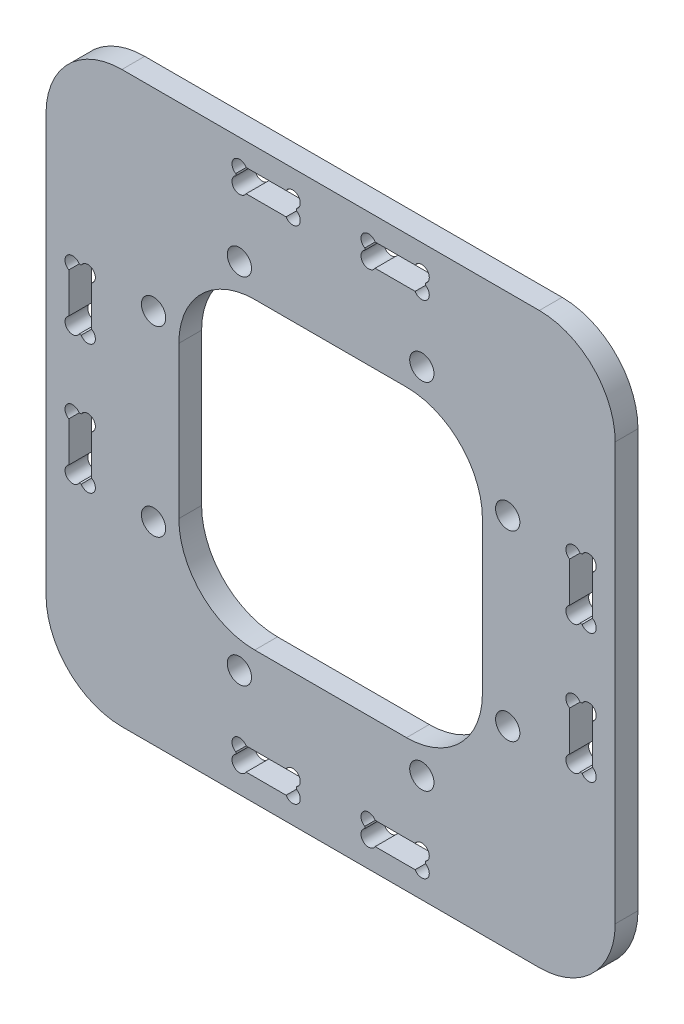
ISO-10303-21;
HEADER;
FILE_DESCRIPTION(('STEP AP214'),'2;1');
FILE_NAME('part.step','',(''),(''),'','','');
FILE_SCHEMA(('AUTOMOTIVE_DESIGN { 1 0 10303 214 1 1 1 1 }'));
ENDSEC;
DATA;
#1=APPLICATION_CONTEXT('core data for automotive mechanical design processes');
#2=APPLICATION_PROTOCOL_DEFINITION('international standard','automotive_design',2000,#1);
#3=PRODUCT_CONTEXT('',#1,'mechanical');
#4=PRODUCT('Part','Part','',(#3));
#5=PRODUCT_RELATED_PRODUCT_CATEGORY('part','',(#4));
#6=PRODUCT_DEFINITION_FORMATION('','',#4);
#7=PRODUCT_DEFINITION_CONTEXT('part definition',#1,'design');
#8=PRODUCT_DEFINITION('design','',#6,#7);
#9=PRODUCT_DEFINITION_SHAPE('','',#8);
#10=(LENGTH_UNIT() NAMED_UNIT(*) SI_UNIT(.MILLI.,.METRE.));
#11=(NAMED_UNIT(*) PLANE_ANGLE_UNIT() SI_UNIT($,.RADIAN.));
#12=(NAMED_UNIT(*) SI_UNIT($,.STERADIAN.) SOLID_ANGLE_UNIT());
#13=UNCERTAINTY_MEASURE_WITH_UNIT(LENGTH_MEASURE(1.E-05),#10,'distance_accuracy_value','');
#14=(GEOMETRIC_REPRESENTATION_CONTEXT(3) GLOBAL_UNCERTAINTY_ASSIGNED_CONTEXT((#13)) GLOBAL_UNIT_ASSIGNED_CONTEXT((#10,
#11,#12)) REPRESENTATION_CONTEXT('',''));
#15=CARTESIAN_POINT('',(0.,0.,0.));
#16=DIRECTION('',(0.,0.,1.));
#17=DIRECTION('',(1.,0.,0.));
#18=AXIS2_PLACEMENT_3D('',#15,#16,#17);
#19=CARTESIAN_POINT('',(0.,0.,3.));
#20=DIRECTION('',(0.,0.,-1.));
#21=DIRECTION('',(-1.,0.,0.));
#22=AXIS2_PLACEMENT_3D('',#19,#20,#21);
#23=PLANE('',#22);
#24=CARTESIAN_POINT('',(-34.,-4.99999999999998,3.));
#25=DIRECTION('',(0.,0.,1.));
#26=DIRECTION('',(1.,0.,0.));
#27=AXIS2_PLACEMENT_3D('',#24,#25,#26);
#28=CIRCLE('',#27,1.);
#29=CARTESIAN_POINT('',(-33.1339745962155,-4.49999999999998,3.));
#30=VERTEX_POINT('',#29);
#31=CARTESIAN_POINT('',(-34.4999999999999,-5.86602540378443,3.));
#32=VERTEX_POINT('',#31);
#33=EDGE_CURVE('E1850',#30,#32,#28,.T.);
#34=ORIENTED_EDGE('',*,*,#33,.F.);
#35=DIRECTION('',(-1.,0.,0.));
#36=VECTOR('',#35,1.);
#37=CARTESIAN_POINT('',(-34.4999999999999,-4.49999999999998,3.));
#38=LINE('',#37,#36);
#39=CARTESIAN_POINT('',(-32.8660254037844,-4.49999999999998,3.));
#40=VERTEX_POINT('',#39);
#41=EDGE_CURVE('E2162',#40,#30,#38,.T.);
#42=ORIENTED_EDGE('',*,*,#41,.F.);
#43=CARTESIAN_POINT('',(-31.9999999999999,-4.99999999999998,3.));
#44=DIRECTION('',(0.,0.,1.));
#45=DIRECTION('',(1.,0.,0.));
#46=AXIS2_PLACEMENT_3D('',#43,#44,#45);
#47=CIRCLE('',#46,1.);
#48=CARTESIAN_POINT('',(-31.4999999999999,-5.86602540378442,3.));
#49=VERTEX_POINT('',#48);
#50=EDGE_CURVE('E1866',#49,#40,#47,.T.);
#51=ORIENTED_EDGE('',*,*,#50,.F.);
#52=DIRECTION('',(0.,1.,0.));
#53=VECTOR('',#52,1.);
#54=CARTESIAN_POINT('',(-31.4999999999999,-12.5,3.));
#55=LINE('',#54,#53);
#56=CARTESIAN_POINT('',(-31.4999999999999,-11.1339745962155,3.));
#57=VERTEX_POINT('',#56);
#58=EDGE_CURVE('E562',#57,#49,#55,.T.);
#59=ORIENTED_EDGE('',*,*,#58,.F.);
#60=CARTESIAN_POINT('',(-31.9999999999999,-12.,3.));
#61=DIRECTION('',(0.,0.,1.));
#62=DIRECTION('',(1.,0.,0.));
#63=AXIS2_PLACEMENT_3D('',#60,#61,#62);
#64=CIRCLE('',#63,1.);
#65=CARTESIAN_POINT('',(-32.8660254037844,-12.5,3.));
#66=VERTEX_POINT('',#65);
#67=EDGE_CURVE('E1879',#66,#57,#64,.T.);
#68=ORIENTED_EDGE('',*,*,#67,.F.);
#69=DIRECTION('',(1.,0.,0.));
#70=VECTOR('',#69,1.);
#71=CARTESIAN_POINT('',(-34.5,-12.5,3.));
#72=LINE('',#71,#70);
#73=CARTESIAN_POINT('',(-33.1339745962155,-12.5,3.));
#74=VERTEX_POINT('',#73);
#75=EDGE_CURVE('E558',#74,#66,#72,.T.);
#76=ORIENTED_EDGE('',*,*,#75,.F.);
#77=CARTESIAN_POINT('',(-34.,-12.,3.));
#78=DIRECTION('',(0.,0.,1.));
#79=DIRECTION('',(1.,0.,0.));
#80=AXIS2_PLACEMENT_3D('',#77,#78,#79);
#81=CIRCLE('',#80,1.);
#82=CARTESIAN_POINT('',(-34.5,-11.1339745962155,3.));
#83=VERTEX_POINT('',#82);
#84=EDGE_CURVE('E1890',#83,#74,#81,.T.);
#85=ORIENTED_EDGE('',*,*,#84,.F.);
#86=DIRECTION('',(0.,-1.,0.));
#87=VECTOR('',#86,1.);
#88=CARTESIAN_POINT('',(-34.5,-12.5,3.));
#89=LINE('',#88,#87);
#90=EDGE_CURVE('E2153',#32,#83,#89,.T.);
#91=ORIENTED_EDGE('',*,*,#90,.F.);
#92=EDGE_LOOP('',(#34,#42,#51,#59,#68,#76,#85,#91));
#93=FACE_BOUND('',#92,.T.);
#94=CARTESIAN_POINT('',(-12.,-33.9999999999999,3.));
#95=DIRECTION('',(0.,0.,1.));
#96=DIRECTION('',(1.,0.,0.));
#97=AXIS2_PLACEMENT_3D('',#94,#95,#96);
#98=CIRCLE('',#97,1.);
#99=CARTESIAN_POINT('',(-12.5,-33.1339745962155,3.));
#100=VERTEX_POINT('',#99);
#101=CARTESIAN_POINT('',(-11.1339745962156,-34.4999999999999,3.));
#102=VERTEX_POINT('',#101);
#103=EDGE_CURVE('E1901',#100,#102,#98,.T.);
#104=ORIENTED_EDGE('',*,*,#103,.F.);
#105=DIRECTION('',(0.,-1.,0.));
#106=VECTOR('',#105,1.);
#107=CARTESIAN_POINT('',(-12.5,-34.4999999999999,3.));
#108=LINE('',#107,#106);
#109=CARTESIAN_POINT('',(-12.5,-32.8660254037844,3.));
#110=VERTEX_POINT('',#109);
#111=EDGE_CURVE('E604',#110,#100,#108,.T.);
#112=ORIENTED_EDGE('',*,*,#111,.F.);
#113=CARTESIAN_POINT('',(-12.,-31.9999999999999,3.));
#114=DIRECTION('',(0.,0.,1.));
#115=DIRECTION('',(1.,0.,0.));
#116=AXIS2_PLACEMENT_3D('',#113,#114,#115);
#117=CIRCLE('',#116,1.);
#118=CARTESIAN_POINT('',(-11.1339745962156,-31.4999999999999,3.));
#119=VERTEX_POINT('',#118);
#120=EDGE_CURVE('E1912',#119,#110,#117,.T.);
#121=ORIENTED_EDGE('',*,*,#120,.F.);
#122=DIRECTION('',(-1.,0.,0.));
#123=VECTOR('',#122,1.);
#124=CARTESIAN_POINT('',(-12.5,-31.4999999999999,3.));
#125=LINE('',#124,#123);
#126=CARTESIAN_POINT('',(-5.86602540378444,-31.4999999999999,3.));
#127=VERTEX_POINT('',#126);
#128=EDGE_CURVE('E618',#127,#119,#125,.T.);
#129=ORIENTED_EDGE('',*,*,#128,.F.);
#130=CARTESIAN_POINT('',(-5.00000000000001,-31.9999999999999,3.));
#131=DIRECTION('',(0.,0.,1.));
#132=DIRECTION('',(1.,0.,0.));
#133=AXIS2_PLACEMENT_3D('',#130,#131,#132);
#134=CIRCLE('',#133,1.);
#135=CARTESIAN_POINT('',(-4.5,-32.8660254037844,3.));
#136=VERTEX_POINT('',#135);
#137=EDGE_CURVE('E1923',#136,#127,#134,.T.);
#138=ORIENTED_EDGE('',*,*,#137,.F.);
#139=DIRECTION('',(0.,1.,0.));
#140=VECTOR('',#139,1.);
#141=CARTESIAN_POINT('',(-4.5,-34.4999999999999,3.));
#142=LINE('',#141,#140);
#143=CARTESIAN_POINT('',(-4.5,-33.1339745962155,3.));
#144=VERTEX_POINT('',#143);
#145=EDGE_CURVE('E614',#144,#136,#142,.T.);
#146=ORIENTED_EDGE('',*,*,#145,.F.);
#147=CARTESIAN_POINT('',(-5.00000000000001,-33.9999999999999,3.));
#148=DIRECTION('',(0.,0.,1.));
#149=DIRECTION('',(1.,0.,0.));
#150=AXIS2_PLACEMENT_3D('',#147,#148,#149);
#151=CIRCLE('',#150,1.);
#152=CARTESIAN_POINT('',(-5.86602540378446,-34.4999999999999,3.));
#153=VERTEX_POINT('',#152);
#154=EDGE_CURVE('E1934',#153,#144,#151,.T.);
#155=ORIENTED_EDGE('',*,*,#154,.F.);
#156=DIRECTION('',(1.,0.,0.));
#157=VECTOR('',#156,1.);
#158=CARTESIAN_POINT('',(-12.5,-34.4999999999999,3.));
#159=LINE('',#158,#157);
#160=EDGE_CURVE('E612',#102,#153,#159,.T.);
#161=ORIENTED_EDGE('',*,*,#160,.F.);
#162=EDGE_LOOP('',(#104,#112,#121,#129,#138,#146,#155,#161));
#163=FACE_BOUND('',#162,.T.);
#164=CARTESIAN_POINT('',(5.00000000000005,-33.9999999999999,3.));
#165=DIRECTION('',(0.,0.,1.));
#166=DIRECTION('',(1.,0.,0.));
#167=AXIS2_PLACEMENT_3D('',#164,#165,#166);
#168=CIRCLE('',#167,1.);
#169=CARTESIAN_POINT('',(4.50000000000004,-33.1339745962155,3.));
#170=VERTEX_POINT('',#169);
#171=CARTESIAN_POINT('',(5.86602540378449,-34.4999999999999,3.));
#172=VERTEX_POINT('',#171);
#173=EDGE_CURVE('E1945',#170,#172,#168,.T.);
#174=ORIENTED_EDGE('',*,*,#173,.F.);
#175=DIRECTION('',(0.,-1.,0.));
#176=VECTOR('',#175,1.);
#177=CARTESIAN_POINT('',(4.50000000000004,-34.4999999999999,3.));
#178=LINE('',#177,#176);
#179=CARTESIAN_POINT('',(4.50000000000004,-32.8660254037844,3.));
#180=VERTEX_POINT('',#179);
#181=EDGE_CURVE('E597',#180,#170,#178,.T.);
#182=ORIENTED_EDGE('',*,*,#181,.F.);
#183=CARTESIAN_POINT('',(5.00000000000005,-31.9999999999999,3.));
#184=DIRECTION('',(0.,0.,1.));
#185=DIRECTION('',(1.,0.,0.));
#186=AXIS2_PLACEMENT_3D('',#183,#184,#185);
#187=CIRCLE('',#186,1.);
#188=CARTESIAN_POINT('',(5.86602540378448,-31.4999999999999,3.));
#189=VERTEX_POINT('',#188);
#190=EDGE_CURVE('E1956',#189,#180,#187,.T.);
#191=ORIENTED_EDGE('',*,*,#190,.F.);
#192=DIRECTION('',(-1.,0.,0.));
#193=VECTOR('',#192,1.);
#194=CARTESIAN_POINT('',(12.5,-31.4999999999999,3.));
#195=LINE('',#194,#193);
#196=CARTESIAN_POINT('',(11.1339745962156,-31.4999999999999,3.));
#197=VERTEX_POINT('',#196);
#198=EDGE_CURVE('E593',#197,#189,#195,.T.);
#199=ORIENTED_EDGE('',*,*,#198,.F.);
#200=CARTESIAN_POINT('',(12.,-31.9999999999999,3.));
#201=DIRECTION('',(0.,0.,1.));
#202=DIRECTION('',(1.,0.,0.));
#203=AXIS2_PLACEMENT_3D('',#200,#201,#202);
#204=CIRCLE('',#203,1.);
#205=CARTESIAN_POINT('',(12.5,-32.8660254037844,3.));
#206=VERTEX_POINT('',#205);
#207=EDGE_CURVE('E1939',#206,#197,#204,.T.);
#208=ORIENTED_EDGE('',*,*,#207,.F.);
#209=DIRECTION('',(0.,1.,0.));
#210=VECTOR('',#209,1.);
#211=CARTESIAN_POINT('',(12.5,-34.4999999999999,3.));
#212=LINE('',#211,#210);
#213=CARTESIAN_POINT('',(12.5,-33.1339745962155,3.));
#214=VERTEX_POINT('',#213);
#215=EDGE_CURVE('E590',#214,#206,#212,.T.);
#216=ORIENTED_EDGE('',*,*,#215,.F.);
#217=CARTESIAN_POINT('',(12.,-33.9999999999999,3.));
#218=DIRECTION('',(0.,0.,1.));
#219=DIRECTION('',(1.,0.,0.));
#220=AXIS2_PLACEMENT_3D('',#217,#218,#219);
#221=CIRCLE('',#220,1.);
#222=CARTESIAN_POINT('',(11.1339745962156,-34.4999999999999,3.));
#223=VERTEX_POINT('',#222);
#224=EDGE_CURVE('E1979',#223,#214,#221,.T.);
#225=ORIENTED_EDGE('',*,*,#224,.F.);
#226=DIRECTION('',(1.,0.,0.));
#227=VECTOR('',#226,1.);
#228=CARTESIAN_POINT('',(12.5,-34.4999999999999,3.));
#229=LINE('',#228,#227);
#230=EDGE_CURVE('E583',#172,#223,#229,.T.);
#231=ORIENTED_EDGE('',*,*,#230,.F.);
#232=EDGE_LOOP('',(#174,#182,#191,#199,#208,#216,#225,#231));
#233=FACE_BOUND('',#232,.T.);
#234=CARTESIAN_POINT('',(12.,34.,3.));
#235=DIRECTION('',(0.,0.,1.));
#236=DIRECTION('',(1.,0.,0.));
#237=AXIS2_PLACEMENT_3D('',#234,#235,#236);
#238=CIRCLE('',#237,1.);
#239=CARTESIAN_POINT('',(12.5,33.1339745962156,3.));
#240=VERTEX_POINT('',#239);
#241=CARTESIAN_POINT('',(11.1339745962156,34.5,3.));
#242=VERTEX_POINT('',#241);
#243=EDGE_CURVE('E1981',#240,#242,#238,.T.);
#244=ORIENTED_EDGE('',*,*,#243,.F.);
#245=DIRECTION('',(0.,1.,0.));
#246=VECTOR('',#245,1.);
#247=CARTESIAN_POINT('',(12.5,34.5,3.));
#248=LINE('',#247,#246);
#249=CARTESIAN_POINT('',(12.5,32.8660254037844,3.));
#250=VERTEX_POINT('',#249);
#251=EDGE_CURVE('E626',#250,#240,#248,.T.);
#252=ORIENTED_EDGE('',*,*,#251,.F.);
#253=CARTESIAN_POINT('',(12.,32.,3.));
#254=DIRECTION('',(0.,0.,1.));
#255=DIRECTION('',(1.,0.,0.));
#256=AXIS2_PLACEMENT_3D('',#253,#254,#255);
#257=CIRCLE('',#256,1.);
#258=CARTESIAN_POINT('',(11.1339745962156,31.5,3.));
#259=VERTEX_POINT('',#258);
#260=EDGE_CURVE('E1991',#259,#250,#257,.T.);
#261=ORIENTED_EDGE('',*,*,#260,.F.);
#262=DIRECTION('',(1.,0.,0.));
#263=VECTOR('',#262,1.);
#264=CARTESIAN_POINT('',(12.5,31.5,3.));
#265=LINE('',#264,#263);
#266=CARTESIAN_POINT('',(5.86602540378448,31.5,3.));
#267=VERTEX_POINT('',#266);
#268=EDGE_CURVE('E642',#267,#259,#265,.T.);
#269=ORIENTED_EDGE('',*,*,#268,.F.);
#270=CARTESIAN_POINT('',(5.00000000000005,32.,3.));
#271=DIRECTION('',(0.,0.,1.));
#272=DIRECTION('',(1.,0.,0.));
#273=AXIS2_PLACEMENT_3D('',#270,#271,#272);
#274=CIRCLE('',#273,1.);
#275=CARTESIAN_POINT('',(4.50000000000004,32.8660254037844,3.));
#276=VERTEX_POINT('',#275);
#277=EDGE_CURVE('E2011',#276,#267,#274,.T.);
#278=ORIENTED_EDGE('',*,*,#277,.F.);
#279=DIRECTION('',(0.,-1.,0.));
#280=VECTOR('',#279,1.);
#281=CARTESIAN_POINT('',(4.50000000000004,34.5,3.));
#282=LINE('',#281,#280);
#283=CARTESIAN_POINT('',(4.50000000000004,33.1339745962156,3.));
#284=VERTEX_POINT('',#283);
#285=EDGE_CURVE('E638',#284,#276,#282,.T.);
#286=ORIENTED_EDGE('',*,*,#285,.F.);
#287=CARTESIAN_POINT('',(5.00000000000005,34.,3.));
#288=DIRECTION('',(0.,0.,1.));
#289=DIRECTION('',(1.,0.,0.));
#290=AXIS2_PLACEMENT_3D('',#287,#288,#289);
#291=CIRCLE('',#290,1.);
#292=CARTESIAN_POINT('',(5.86602540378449,34.5,3.));
#293=VERTEX_POINT('',#292);
#294=EDGE_CURVE('E2022',#293,#284,#291,.T.);
#295=ORIENTED_EDGE('',*,*,#294,.F.);
#296=DIRECTION('',(-1.,0.,0.));
#297=VECTOR('',#296,1.);
#298=CARTESIAN_POINT('',(12.5,34.5,3.));
#299=LINE('',#298,#297);
#300=EDGE_CURVE('E636',#242,#293,#299,.T.);
#301=ORIENTED_EDGE('',*,*,#300,.F.);
#302=EDGE_LOOP('',(#244,#252,#261,#269,#278,#286,#295,#301));
#303=FACE_BOUND('',#302,.T.);
#304=CARTESIAN_POINT('',(-5.00000000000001,34.,3.));
#305=DIRECTION('',(0.,0.,1.));
#306=DIRECTION('',(1.,0.,0.));
#307=AXIS2_PLACEMENT_3D('',#304,#305,#306);
#308=CIRCLE('',#307,1.);
#309=CARTESIAN_POINT('',(-4.5,33.1339745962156,3.));
#310=VERTEX_POINT('',#309);
#311=CARTESIAN_POINT('',(-5.86602540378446,34.5,3.));
#312=VERTEX_POINT('',#311);
#313=EDGE_CURVE('E817',#310,#312,#308,.T.);
#314=ORIENTED_EDGE('',*,*,#313,.F.);
#315=DIRECTION('',(0.,1.,0.));
#316=VECTOR('',#315,1.);
#317=CARTESIAN_POINT('',(-4.5,34.5,3.));
#318=LINE('',#317,#316);
#319=CARTESIAN_POINT('',(-4.5,32.8660254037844,3.));
#320=VERTEX_POINT('',#319);
#321=EDGE_CURVE('E709',#320,#310,#318,.T.);
#322=ORIENTED_EDGE('',*,*,#321,.F.);
#323=CARTESIAN_POINT('',(-5.00000000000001,32.,3.));
#324=DIRECTION('',(0.,0.,-1.));
#325=DIRECTION('',(-1.,0.,0.));
#326=AXIS2_PLACEMENT_3D('',#323,#324,#325);
#327=CIRCLE('',#326,1.);
#328=CARTESIAN_POINT('',(-5.86602540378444,31.5,3.));
#329=VERTEX_POINT('',#328);
#330=EDGE_CURVE('E814',#320,#329,#327,.T.);
#331=ORIENTED_EDGE('',*,*,#330,.T.);
#332=DIRECTION('',(1.,0.,0.));
#333=VECTOR('',#332,1.);
#334=CARTESIAN_POINT('',(-12.5,31.5,3.));
#335=LINE('',#334,#333);
#336=CARTESIAN_POINT('',(-11.1339745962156,31.5,3.));
#337=VERTEX_POINT('',#336);
#338=EDGE_CURVE('E706',#337,#329,#335,.T.);
#339=ORIENTED_EDGE('',*,*,#338,.F.);
#340=CARTESIAN_POINT('',(-12.,32.,3.));
#341=DIRECTION('',(0.,0.,1.));
#342=DIRECTION('',(1.,0.,0.));
#343=AXIS2_PLACEMENT_3D('',#340,#341,#342);
#344=CIRCLE('',#343,1.);
#345=CARTESIAN_POINT('',(-12.5,32.8660254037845,3.));
#346=VERTEX_POINT('',#345);
#347=EDGE_CURVE('E2051',#346,#337,#344,.T.);
#348=ORIENTED_EDGE('',*,*,#347,.F.);
#349=DIRECTION('',(0.,-1.,0.));
#350=VECTOR('',#349,1.);
#351=CARTESIAN_POINT('',(-12.5,34.5,3.));
#352=LINE('',#351,#350);
#353=CARTESIAN_POINT('',(-12.5,33.1339745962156,3.));
#354=VERTEX_POINT('',#353);
#355=EDGE_CURVE('E635',#354,#346,#352,.T.);
#356=ORIENTED_EDGE('',*,*,#355,.F.);
#357=CARTESIAN_POINT('',(-12.,34.,3.));
#358=DIRECTION('',(0.,0.,1.));
#359=DIRECTION('',(1.,0.,0.));
#360=AXIS2_PLACEMENT_3D('',#357,#358,#359);
#361=CIRCLE('',#360,1.);
#362=CARTESIAN_POINT('',(-11.1339745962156,34.5,3.));
#363=VERTEX_POINT('',#362);
#364=EDGE_CURVE('E2062',#363,#354,#361,.T.);
#365=ORIENTED_EDGE('',*,*,#364,.F.);
#366=DIRECTION('',(-1.,0.,0.));
#367=VECTOR('',#366,1.);
#368=CARTESIAN_POINT('',(-12.5,34.5,3.));
#369=LINE('',#368,#367);
#370=EDGE_CURVE('E695',#312,#363,#369,.T.);
#371=ORIENTED_EDGE('',*,*,#370,.F.);
#372=EDGE_LOOP('',(#314,#322,#331,#339,#348,#356,#365,#371));
#373=FACE_BOUND('',#372,.T.);
#374=CARTESIAN_POINT('',(34.,5.00000000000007,3.));
#375=DIRECTION('',(0.,0.,1.));
#376=DIRECTION('',(1.,0.,0.));
#377=AXIS2_PLACEMENT_3D('',#374,#375,#376);
#378=CIRCLE('',#377,1.);
#379=CARTESIAN_POINT('',(33.1339745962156,4.50000000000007,3.));
#380=VERTEX_POINT('',#379);
#381=CARTESIAN_POINT('',(34.5,5.86602540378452,3.));
#382=VERTEX_POINT('',#381);
#383=EDGE_CURVE('E2110',#380,#382,#378,.T.);
#384=ORIENTED_EDGE('',*,*,#383,.F.);
#385=DIRECTION('',(1.,0.,0.));
#386=VECTOR('',#385,1.);
#387=CARTESIAN_POINT('',(34.5,4.50000000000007,3.));
#388=LINE('',#387,#386);
#389=CARTESIAN_POINT('',(32.8660254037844,4.50000000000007,3.));
#390=VERTEX_POINT('',#389);
#391=EDGE_CURVE('E665',#390,#380,#388,.T.);
#392=ORIENTED_EDGE('',*,*,#391,.F.);
#393=CARTESIAN_POINT('',(32.,5.00000000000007,3.));
#394=DIRECTION('',(0.,0.,1.));
#395=DIRECTION('',(1.,0.,0.));
#396=AXIS2_PLACEMENT_3D('',#393,#394,#395);
#397=CIRCLE('',#396,1.);
#398=CARTESIAN_POINT('',(31.5,5.86602540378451,3.));
#399=VERTEX_POINT('',#398);
#400=EDGE_CURVE('E2125',#399,#390,#397,.T.);
#401=ORIENTED_EDGE('',*,*,#400,.F.);
#402=DIRECTION('',(0.,-1.,0.));
#403=VECTOR('',#402,1.);
#404=CARTESIAN_POINT('',(31.5,12.5000000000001,3.));
#405=LINE('',#404,#403);
#406=CARTESIAN_POINT('',(31.5,11.1339745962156,3.));
#407=VERTEX_POINT('',#406);
#408=EDGE_CURVE('E661',#407,#399,#405,.T.);
#409=ORIENTED_EDGE('',*,*,#408,.F.);
#410=CARTESIAN_POINT('',(32.,12.0000000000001,3.));
#411=DIRECTION('',(0.,0.,1.));
#412=DIRECTION('',(1.,0.,0.));
#413=AXIS2_PLACEMENT_3D('',#410,#411,#412);
#414=CIRCLE('',#413,1.);
#415=CARTESIAN_POINT('',(32.8660254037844,12.5000000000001,3.));
#416=VERTEX_POINT('',#415);
#417=EDGE_CURVE('E2136',#416,#407,#414,.T.);
#418=ORIENTED_EDGE('',*,*,#417,.F.);
#419=DIRECTION('',(-1.,0.,0.));
#420=VECTOR('',#419,1.);
#421=CARTESIAN_POINT('',(34.5,12.5000000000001,3.));
#422=LINE('',#421,#420);
#423=CARTESIAN_POINT('',(33.1339745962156,12.5000000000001,3.));
#424=VERTEX_POINT('',#423);
#425=EDGE_CURVE('E658',#424,#416,#422,.T.);
#426=ORIENTED_EDGE('',*,*,#425,.F.);
#427=CARTESIAN_POINT('',(34.,12.0000000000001,3.));
#428=DIRECTION('',(0.,0.,1.));
#429=DIRECTION('',(1.,0.,0.));
#430=AXIS2_PLACEMENT_3D('',#427,#428,#429);
#431=CIRCLE('',#430,1.);
#432=CARTESIAN_POINT('',(34.5,11.1339745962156,3.));
#433=VERTEX_POINT('',#432);
#434=EDGE_CURVE('E810',#433,#424,#431,.T.);
#435=ORIENTED_EDGE('',*,*,#434,.F.);
#436=DIRECTION('',(0.,1.,0.));
#437=VECTOR('',#436,1.);
#438=CARTESIAN_POINT('',(34.5,12.5000000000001,3.));
#439=LINE('',#438,#437);
#440=EDGE_CURVE('E651',#382,#433,#439,.T.);
#441=ORIENTED_EDGE('',*,*,#440,.F.);
#442=EDGE_LOOP('',(#384,#392,#401,#409,#418,#426,#435,#441));
#443=FACE_BOUND('',#442,.T.);
#444=DIRECTION('',(0.,1.,0.));
#445=VECTOR('',#444,1.);
#446=CARTESIAN_POINT('',(20.,-20.,3.));
#447=LINE('',#446,#445);
#448=CARTESIAN_POINT('',(20.,-10.,3.));
#449=VERTEX_POINT('',#448);
#450=CARTESIAN_POINT('',(20.,10.,3.));
#451=VERTEX_POINT('',#450);
#452=EDGE_CURVE('E761',#449,#451,#447,.T.);
#453=ORIENTED_EDGE('',*,*,#452,.F.);
#454=CARTESIAN_POINT('',(10.,-10.,3.));
#455=DIRECTION('',(0.,0.,-1.));
#456=DIRECTION('',(-1.,0.,0.));
#457=AXIS2_PLACEMENT_3D('',#454,#455,#456);
#458=CIRCLE('',#457,10.);
#459=CARTESIAN_POINT('',(10.,-20.,3.));
#460=VERTEX_POINT('',#459);
#461=EDGE_CURVE('E879',#449,#460,#458,.T.);
#462=ORIENTED_EDGE('',*,*,#461,.T.);
#463=DIRECTION('',(1.,0.,0.));
#464=VECTOR('',#463,1.);
#465=CARTESIAN_POINT('',(-20.,-20.,3.));
#466=LINE('',#465,#464);
#467=CARTESIAN_POINT('',(-10.,-20.,3.));
#468=VERTEX_POINT('',#467);
#469=EDGE_CURVE('E771',#468,#460,#466,.T.);
#470=ORIENTED_EDGE('',*,*,#469,.F.);
#471=CARTESIAN_POINT('',(-10.,-10.,3.));
#472=DIRECTION('',(0.,0.,-1.));
#473=DIRECTION('',(-1.,0.,0.));
#474=AXIS2_PLACEMENT_3D('',#471,#472,#473);
#475=CIRCLE('',#474,10.);
#476=CARTESIAN_POINT('',(-20.,-10.,3.));
#477=VERTEX_POINT('',#476);
#478=EDGE_CURVE('E875',#468,#477,#475,.T.);
#479=ORIENTED_EDGE('',*,*,#478,.T.);
#480=DIRECTION('',(0.,-1.,0.));
#481=VECTOR('',#480,1.);
#482=CARTESIAN_POINT('',(-20.,-20.,3.));
#483=LINE('',#482,#481);
#484=CARTESIAN_POINT('',(-20.,10.,3.));
#485=VERTEX_POINT('',#484);
#486=EDGE_CURVE('E768',#485,#477,#483,.T.);
#487=ORIENTED_EDGE('',*,*,#486,.F.);
#488=CARTESIAN_POINT('',(-10.,10.,3.));
#489=DIRECTION('',(0.,0.,-1.));
#490=DIRECTION('',(-1.,0.,0.));
#491=AXIS2_PLACEMENT_3D('',#488,#489,#490);
#492=CIRCLE('',#491,10.);
#493=CARTESIAN_POINT('',(-10.,20.,3.));
#494=VERTEX_POINT('',#493);
#495=EDGE_CURVE('E11',#485,#494,#492,.T.);
#496=ORIENTED_EDGE('',*,*,#495,.T.);
#497=DIRECTION('',(-1.,0.,0.));
#498=VECTOR('',#497,1.);
#499=CARTESIAN_POINT('',(-20.,20.,3.));
#500=LINE('',#499,#498);
#501=CARTESIAN_POINT('',(10.,20.,3.));
#502=VERTEX_POINT('',#501);
#503=EDGE_CURVE('E764',#502,#494,#500,.T.);
#504=ORIENTED_EDGE('',*,*,#503,.F.);
#505=CARTESIAN_POINT('',(10.,10.,3.));
#506=DIRECTION('',(0.,0.,-1.));
#507=DIRECTION('',(-1.,0.,0.));
#508=AXIS2_PLACEMENT_3D('',#505,#506,#507);
#509=CIRCLE('',#508,10.);
#510=EDGE_CURVE('E883',#502,#451,#509,.T.);
#511=ORIENTED_EDGE('',*,*,#510,.T.);
#512=EDGE_LOOP('',(#453,#462,#470,#479,#487,#496,#504,#511));
#513=FACE_BOUND('',#512,.T.);
#514=DIRECTION('',(-1.,0.,0.));
#515=VECTOR('',#514,1.);
#516=CARTESIAN_POINT('',(-37.5,37.5,3.));
#517=LINE('',#516,#515);
#518=CARTESIAN_POINT('',(27.5,37.5,3.));
#519=VERTEX_POINT('',#518);
#520=CARTESIAN_POINT('',(-27.5,37.5,3.));
#521=VERTEX_POINT('',#520);
#522=EDGE_CURVE('E788',#519,#521,#517,.T.);
#523=ORIENTED_EDGE('',*,*,#522,.T.);
#524=CARTESIAN_POINT('',(-27.5,27.5,3.));
#525=DIRECTION('',(0.,0.,-1.));
#526=DIRECTION('',(-1.,0.,0.));
#527=AXIS2_PLACEMENT_3D('',#524,#525,#526);
#528=CIRCLE('',#527,10.);
#529=CARTESIAN_POINT('',(-37.5,27.5,3.));
#530=VERTEX_POINT('',#529);
#531=EDGE_CURVE('E862',#521,#530,#528,.F.);
#532=ORIENTED_EDGE('',*,*,#531,.T.);
#533=DIRECTION('',(0.,-1.,0.));
#534=VECTOR('',#533,1.);
#535=CARTESIAN_POINT('',(-37.5,-37.5,3.));
#536=LINE('',#535,#534);
#537=CARTESIAN_POINT('',(-37.5,-27.5,3.));
#538=VERTEX_POINT('',#537);
#539=EDGE_CURVE('E792',#530,#538,#536,.T.);
#540=ORIENTED_EDGE('',*,*,#539,.T.);
#541=CARTESIAN_POINT('',(-27.5,-27.5,3.));
#542=DIRECTION('',(0.,0.,-1.));
#543=DIRECTION('',(-1.,0.,0.));
#544=AXIS2_PLACEMENT_3D('',#541,#542,#543);
#545=CIRCLE('',#544,10.);
#546=CARTESIAN_POINT('',(-27.5,-37.5,3.));
#547=VERTEX_POINT('',#546);
#548=EDGE_CURVE('E57',#538,#547,#545,.F.);
#549=ORIENTED_EDGE('',*,*,#548,.T.);
#550=DIRECTION('',(1.,0.,0.));
#551=VECTOR('',#550,1.);
#552=CARTESIAN_POINT('',(-37.5,-37.5,3.));
#553=LINE('',#552,#551);
#554=CARTESIAN_POINT('',(27.5,-37.5,3.));
#555=VERTEX_POINT('',#554);
#556=EDGE_CURVE('E794',#547,#555,#553,.T.);
#557=ORIENTED_EDGE('',*,*,#556,.T.);
#558=CARTESIAN_POINT('',(27.5,-27.5,3.));
#559=DIRECTION('',(0.,0.,-1.));
#560=DIRECTION('',(-1.,0.,0.));
#561=AXIS2_PLACEMENT_3D('',#558,#559,#560);
#562=CIRCLE('',#561,10.);
#563=CARTESIAN_POINT('',(37.5,-27.5,3.));
#564=VERTEX_POINT('',#563);
#565=EDGE_CURVE('E858',#555,#564,#562,.F.);
#566=ORIENTED_EDGE('',*,*,#565,.T.);
#567=DIRECTION('',(0.,1.,0.));
#568=VECTOR('',#567,1.);
#569=CARTESIAN_POINT('',(37.5,-37.5,3.));
#570=LINE('',#569,#568);
#571=CARTESIAN_POINT('',(37.5,27.5,3.));
#572=VERTEX_POINT('',#571);
#573=EDGE_CURVE('E785',#564,#572,#570,.T.);
#574=ORIENTED_EDGE('',*,*,#573,.T.);
#575=CARTESIAN_POINT('',(27.5,27.5,3.));
#576=DIRECTION('',(0.,0.,-1.));
#577=DIRECTION('',(-1.,0.,0.));
#578=AXIS2_PLACEMENT_3D('',#575,#576,#577);
#579=CIRCLE('',#578,10.);
#580=EDGE_CURVE('E860',#572,#519,#579,.F.);
#581=ORIENTED_EDGE('',*,*,#580,.T.);
#582=EDGE_LOOP('',(#523,#532,#540,#549,#557,#566,#574,#581));
#583=FACE_BOUND('',#582,.T.);
#584=CARTESIAN_POINT('',(-23.334523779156,12.0208152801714,3.));
#585=DIRECTION('',(0.,0.,1.));
#586=DIRECTION('',(1.,0.,0.));
#587=AXIS2_PLACEMENT_3D('',#584,#585,#586);
#588=CIRCLE('',#587,1.6);
#589=CARTESIAN_POINT('',(-21.734523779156,12.0208152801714,3.));
#590=VERTEX_POINT('',#589);
#591=EDGE_CURVE('E754',#590,#590,#588,.T.);
#592=ORIENTED_EDGE('',*,*,#591,.F.);
#593=EDGE_LOOP('',(#592));
#594=FACE_BOUND('',#593,.T.);
#595=CARTESIAN_POINT('',(-12.0208152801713,23.3345237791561,3.));
#596=DIRECTION('',(0.,0.,1.));
#597=DIRECTION('',(1.,0.,0.));
#598=AXIS2_PLACEMENT_3D('',#595,#596,#597);
#599=CIRCLE('',#598,1.6);
#600=CARTESIAN_POINT('',(-10.4208152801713,23.3345237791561,3.));
#601=VERTEX_POINT('',#600);
#602=EDGE_CURVE('E748',#601,#601,#599,.T.);
#603=ORIENTED_EDGE('',*,*,#602,.F.);
#604=EDGE_LOOP('',(#603));
#605=FACE_BOUND('',#604,.T.);
#606=CARTESIAN_POINT('',(12.0208152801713,23.3345237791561,3.));
#607=DIRECTION('',(0.,0.,1.));
#608=DIRECTION('',(1.,0.,0.));
#609=AXIS2_PLACEMENT_3D('',#606,#607,#608);
#610=CIRCLE('',#609,1.6);
#611=CARTESIAN_POINT('',(13.6208152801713,23.3345237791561,3.));
#612=VERTEX_POINT('',#611);
#613=EDGE_CURVE('E742',#612,#612,#610,.T.);
#614=ORIENTED_EDGE('',*,*,#613,.F.);
#615=EDGE_LOOP('',(#614));
#616=FACE_BOUND('',#615,.T.);
#617=CARTESIAN_POINT('',(23.3345237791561,12.0208152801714,3.));
#618=DIRECTION('',(0.,0.,1.));
#619=DIRECTION('',(1.,0.,0.));
#620=AXIS2_PLACEMENT_3D('',#617,#618,#619);
#621=CIRCLE('',#620,1.6);
#622=CARTESIAN_POINT('',(24.9345237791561,12.0208152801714,3.));
#623=VERTEX_POINT('',#622);
#624=EDGE_CURVE('E736',#623,#623,#621,.T.);
#625=ORIENTED_EDGE('',*,*,#624,.F.);
#626=EDGE_LOOP('',(#625));
#627=FACE_BOUND('',#626,.T.);
#628=CARTESIAN_POINT('',(23.3345237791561,-12.0208152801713,3.));
#629=DIRECTION('',(0.,0.,1.));
#630=DIRECTION('',(1.,0.,0.));
#631=AXIS2_PLACEMENT_3D('',#628,#629,#630);
#632=CIRCLE('',#631,1.6);
#633=CARTESIAN_POINT('',(24.9345237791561,-12.0208152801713,3.));
#634=VERTEX_POINT('',#633);
#635=EDGE_CURVE('E730',#634,#634,#632,.T.);
#636=ORIENTED_EDGE('',*,*,#635,.F.);
#637=EDGE_LOOP('',(#636));
#638=FACE_BOUND('',#637,.T.);
#639=CARTESIAN_POINT('',(12.0208152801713,-23.334523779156,3.));
#640=DIRECTION('',(0.,0.,1.));
#641=DIRECTION('',(1.,0.,0.));
#642=AXIS2_PLACEMENT_3D('',#639,#640,#641);
#643=CIRCLE('',#642,1.6);
#644=CARTESIAN_POINT('',(13.6208152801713,-23.334523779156,3.));
#645=VERTEX_POINT('',#644);
#646=EDGE_CURVE('E724',#645,#645,#643,.T.);
#647=ORIENTED_EDGE('',*,*,#646,.F.);
#648=EDGE_LOOP('',(#647));
#649=FACE_BOUND('',#648,.T.);
#650=CARTESIAN_POINT('',(-12.0208152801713,-23.334523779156,3.));
#651=DIRECTION('',(0.,0.,1.));
#652=DIRECTION('',(1.,0.,0.));
#653=AXIS2_PLACEMENT_3D('',#650,#651,#652);
#654=CIRCLE('',#653,1.6);
#655=CARTESIAN_POINT('',(-10.4208152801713,-23.334523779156,3.));
#656=VERTEX_POINT('',#655);
#657=EDGE_CURVE('E718',#656,#656,#654,.T.);
#658=ORIENTED_EDGE('',*,*,#657,.F.);
#659=EDGE_LOOP('',(#658));
#660=FACE_BOUND('',#659,.T.);
#661=CARTESIAN_POINT('',(-23.334523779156,-12.0208152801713,3.));
#662=DIRECTION('',(0.,0.,1.));
#663=DIRECTION('',(1.,0.,0.));
#664=AXIS2_PLACEMENT_3D('',#661,#662,#663);
#665=CIRCLE('',#664,1.6);
#666=CARTESIAN_POINT('',(-21.734523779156,-12.0208152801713,3.));
#667=VERTEX_POINT('',#666);
#668=EDGE_CURVE('E703',#667,#667,#665,.T.);
#669=ORIENTED_EDGE('',*,*,#668,.F.);
#670=EDGE_LOOP('',(#669));
#671=FACE_BOUND('',#670,.T.);
#672=CARTESIAN_POINT('',(34.,-12.,3.));
#673=DIRECTION('',(0.,0.,1.));
#674=DIRECTION('',(1.,0.,0.));
#675=AXIS2_PLACEMENT_3D('',#672,#673,#674);
#676=CIRCLE('',#675,1.);
#677=CARTESIAN_POINT('',(33.1339745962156,-12.5,3.));
#678=VERTEX_POINT('',#677);
#679=CARTESIAN_POINT('',(34.5,-11.1339745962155,3.));
#680=VERTEX_POINT('',#679);
#681=EDGE_CURVE('E1838',#678,#680,#676,.T.);
#682=ORIENTED_EDGE('',*,*,#681,.F.);
#683=DIRECTION('',(1.,0.,0.));
#684=VECTOR('',#683,1.);
#685=CARTESIAN_POINT('',(34.5,-12.5,3.));
#686=LINE('',#685,#684);
#687=CARTESIAN_POINT('',(32.8660254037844,-12.5,3.));
#688=VERTEX_POINT('',#687);
#689=EDGE_CURVE('E672',#688,#678,#686,.T.);
#690=ORIENTED_EDGE('',*,*,#689,.F.);
#691=CARTESIAN_POINT('',(32.,-12.,3.));
#692=DIRECTION('',(0.,0.,1.));
#693=DIRECTION('',(1.,0.,0.));
#694=AXIS2_PLACEMENT_3D('',#691,#692,#693);
#695=CIRCLE('',#694,1.);
#696=CARTESIAN_POINT('',(31.5,-11.1339745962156,3.));
#697=VERTEX_POINT('',#696);
#698=EDGE_CURVE('E2083',#697,#688,#695,.T.);
#699=ORIENTED_EDGE('',*,*,#698,.F.);
#700=DIRECTION('',(0.,-1.,0.));
#701=VECTOR('',#700,1.);
#702=CARTESIAN_POINT('',(31.5,-12.5,3.));
#703=LINE('',#702,#701);
#704=CARTESIAN_POINT('',(31.5,-5.86602540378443,3.));
#705=VERTEX_POINT('',#704);
#706=EDGE_CURVE('E686',#705,#697,#703,.T.);
#707=ORIENTED_EDGE('',*,*,#706,.F.);
#708=CARTESIAN_POINT('',(32.,-4.99999999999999,3.));
#709=DIRECTION('',(0.,0.,1.));
#710=DIRECTION('',(1.,0.,0.));
#711=AXIS2_PLACEMENT_3D('',#708,#709,#710);
#712=CIRCLE('',#711,1.);
#713=CARTESIAN_POINT('',(32.8660254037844,-4.49999999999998,3.));
#714=VERTEX_POINT('',#713);
#715=EDGE_CURVE('E2094',#714,#705,#712,.T.);
#716=ORIENTED_EDGE('',*,*,#715,.F.);
#717=DIRECTION('',(-1.,0.,0.));
#718=VECTOR('',#717,1.);
#719=CARTESIAN_POINT('',(34.5,-4.49999999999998,3.));
#720=LINE('',#719,#718);
#721=CARTESIAN_POINT('',(33.1339745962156,-4.49999999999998,3.));
#722=VERTEX_POINT('',#721);
#723=EDGE_CURVE('E682',#722,#714,#720,.T.);
#724=ORIENTED_EDGE('',*,*,#723,.F.);
#725=CARTESIAN_POINT('',(34.,-4.99999999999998,3.));
#726=DIRECTION('',(0.,0.,1.));
#727=DIRECTION('',(1.,0.,0.));
#728=AXIS2_PLACEMENT_3D('',#725,#726,#727);
#729=CIRCLE('',#728,1.);
#730=CARTESIAN_POINT('',(34.5,-5.86602540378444,3.));
#731=VERTEX_POINT('',#730);
#732=EDGE_CURVE('E2075',#731,#722,#729,.T.);
#733=ORIENTED_EDGE('',*,*,#732,.F.);
#734=DIRECTION('',(0.,1.,0.));
#735=VECTOR('',#734,1.);
#736=CARTESIAN_POINT('',(34.5,-12.5,3.));
#737=LINE('',#736,#735);
#738=EDGE_CURVE('E680',#680,#731,#737,.T.);
#739=ORIENTED_EDGE('',*,*,#738,.F.);
#740=EDGE_LOOP('',(#682,#690,#699,#707,#716,#724,#733,#739));
#741=FACE_BOUND('',#740,.T.);
#742=DIRECTION('',(0.,-1.,0.));
#743=VECTOR('',#742,1.);
#744=CARTESIAN_POINT('',(-34.5,12.5000000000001,3.));
#745=LINE('',#744,#743);
#746=CARTESIAN_POINT('',(-34.5,11.1339745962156,3.));
#747=VERTEX_POINT('',#746);
#748=CARTESIAN_POINT('',(-34.5,5.86602540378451,3.));
#749=VERTEX_POINT('',#748);
#750=EDGE_CURVE('E568',#747,#749,#745,.T.);
#751=ORIENTED_EDGE('',*,*,#750,.F.);
#752=CARTESIAN_POINT('',(-34.,12.0000000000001,3.));
#753=DIRECTION('',(0.,0.,1.));
#754=DIRECTION('',(1.,0.,0.));
#755=AXIS2_PLACEMENT_3D('',#752,#753,#754);
#756=CIRCLE('',#755,1.);
#757=CARTESIAN_POINT('',(-33.1339745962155,12.5000000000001,3.));
#758=VERTEX_POINT('',#757);
#759=EDGE_CURVE('E542',#758,#747,#756,.T.);
#760=ORIENTED_EDGE('',*,*,#759,.F.);
#761=DIRECTION('',(-1.,0.,0.));
#762=VECTOR('',#761,1.);
#763=CARTESIAN_POINT('',(-34.5,12.5000000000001,3.));
#764=LINE('',#763,#762);
#765=CARTESIAN_POINT('',(-32.8660254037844,12.5000000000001,3.));
#766=VERTEX_POINT('',#765);
#767=EDGE_CURVE('E551',#766,#758,#764,.T.);
#768=ORIENTED_EDGE('',*,*,#767,.F.);
#769=CARTESIAN_POINT('',(-31.9999999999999,12.0000000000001,3.));
#770=DIRECTION('',(0.,0.,1.));
#771=DIRECTION('',(1.,0.,0.));
#772=AXIS2_PLACEMENT_3D('',#769,#770,#771);
#773=CIRCLE('',#772,1.);
#774=CARTESIAN_POINT('',(-31.4999999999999,11.1339745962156,3.));
#775=VERTEX_POINT('',#774);
#776=EDGE_CURVE('E2187',#775,#766,#773,.T.);
#777=ORIENTED_EDGE('',*,*,#776,.F.);
#778=DIRECTION('',(0.,1.,0.));
#779=VECTOR('',#778,1.);
#780=CARTESIAN_POINT('',(-31.4999999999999,12.5000000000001,3.));
#781=LINE('',#780,#779);
#782=CARTESIAN_POINT('',(-31.4999999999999,5.86602540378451,3.));
#783=VERTEX_POINT('',#782);
#784=EDGE_CURVE('E574',#783,#775,#781,.T.);
#785=ORIENTED_EDGE('',*,*,#784,.F.);
#786=CARTESIAN_POINT('',(-31.9999999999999,5.00000000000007,3.));
#787=DIRECTION('',(0.,0.,1.));
#788=DIRECTION('',(1.,0.,0.));
#789=AXIS2_PLACEMENT_3D('',#786,#787,#788);
#790=CIRCLE('',#789,1.);
#791=CARTESIAN_POINT('',(-32.8660254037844,4.50000000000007,3.));
#792=VERTEX_POINT('',#791);
#793=EDGE_CURVE('E2174',#792,#783,#790,.T.);
#794=ORIENTED_EDGE('',*,*,#793,.F.);
#795=DIRECTION('',(1.,0.,0.));
#796=VECTOR('',#795,1.);
#797=CARTESIAN_POINT('',(-34.5,4.50000000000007,3.));
#798=LINE('',#797,#796);
#799=CARTESIAN_POINT('',(-33.1339745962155,4.50000000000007,3.));
#800=VERTEX_POINT('',#799);
#801=EDGE_CURVE('E570',#800,#792,#798,.T.);
#802=ORIENTED_EDGE('',*,*,#801,.F.);
#803=CARTESIAN_POINT('',(-34.,5.00000000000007,3.));
#804=DIRECTION('',(0.,0.,1.));
#805=DIRECTION('',(1.,0.,0.));
#806=AXIS2_PLACEMENT_3D('',#803,#804,#805);
#807=CIRCLE('',#806,1.);
#808=EDGE_CURVE('E1842',#749,#800,#807,.T.);
#809=ORIENTED_EDGE('',*,*,#808,.F.);
#810=EDGE_LOOP('',(#751,#760,#768,#777,#785,#794,#802,#809));
#811=FACE_BOUND('',#810,.T.);
#812=ADVANCED_FACE('F35',(#93,#163,#233,#303,#373,#443,#513,#583,#594,#605,#616,#627,#638,#649,
#660,#671,#741,#811),#23,.F.);
#813=CARTESIAN_POINT('',(0.,0.,0.));
#814=DIRECTION('',(0.,0.,-1.));
#815=DIRECTION('',(-1.,0.,0.));
#816=AXIS2_PLACEMENT_3D('',#813,#814,#815);
#817=PLANE('',#816);
#818=CARTESIAN_POINT('',(-34.,12.0000000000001,0.));
#819=DIRECTION('',(0.,0.,1.));
#820=DIRECTION('',(1.,0.,0.));
#821=AXIS2_PLACEMENT_3D('',#818,#819,#820);
#822=CIRCLE('',#821,1.);
#823=CARTESIAN_POINT('',(-33.1339745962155,12.5000000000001,0.));
#824=VERTEX_POINT('',#823);
#825=CARTESIAN_POINT('',(-34.5,11.1339745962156,0.));
#826=VERTEX_POINT('',#825);
#827=EDGE_CURVE('E532',#824,#826,#822,.T.);
#828=ORIENTED_EDGE('',*,*,#827,.T.);
#829=DIRECTION('',(0.,-1.,0.));
#830=VECTOR('',#829,1.);
#831=CARTESIAN_POINT('',(-34.5,12.5000000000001,0.));
#832=LINE('',#831,#830);
#833=CARTESIAN_POINT('',(-34.5,5.86602540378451,0.));
#834=VERTEX_POINT('',#833);
#835=EDGE_CURVE('E578',#826,#834,#832,.T.);
#836=ORIENTED_EDGE('',*,*,#835,.T.);
#837=CARTESIAN_POINT('',(-34.,5.00000000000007,0.));
#838=DIRECTION('',(0.,0.,1.));
#839=DIRECTION('',(1.,0.,0.));
#840=AXIS2_PLACEMENT_3D('',#837,#838,#839);
#841=CIRCLE('',#840,1.);
#842=CARTESIAN_POINT('',(-33.1339745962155,4.50000000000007,0.));
#843=VERTEX_POINT('',#842);
#844=EDGE_CURVE('E1849',#834,#843,#841,.T.);
#845=ORIENTED_EDGE('',*,*,#844,.T.);
#846=DIRECTION('',(1.,0.,0.));
#847=VECTOR('',#846,1.);
#848=CARTESIAN_POINT('',(-34.5,4.50000000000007,0.));
#849=LINE('',#848,#847);
#850=CARTESIAN_POINT('',(-32.8660254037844,4.50000000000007,0.));
#851=VERTEX_POINT('',#850);
#852=EDGE_CURVE('E564',#843,#851,#849,.T.);
#853=ORIENTED_EDGE('',*,*,#852,.T.);
#854=CARTESIAN_POINT('',(-31.9999999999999,5.00000000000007,0.));
#855=DIRECTION('',(0.,0.,1.));
#856=DIRECTION('',(1.,0.,0.));
#857=AXIS2_PLACEMENT_3D('',#854,#855,#856);
#858=CIRCLE('',#857,1.);
#859=CARTESIAN_POINT('',(-31.4999999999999,5.86602540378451,0.));
#860=VERTEX_POINT('',#859);
#861=EDGE_CURVE('E1872',#851,#860,#858,.T.);
#862=ORIENTED_EDGE('',*,*,#861,.T.);
#863=DIRECTION('',(0.,1.,0.));
#864=VECTOR('',#863,1.);
#865=CARTESIAN_POINT('',(-31.4999999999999,12.5000000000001,0.));
#866=LINE('',#865,#864);
#867=CARTESIAN_POINT('',(-31.4999999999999,11.1339745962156,0.));
#868=VERTEX_POINT('',#867);
#869=EDGE_CURVE('E559',#860,#868,#866,.T.);
#870=ORIENTED_EDGE('',*,*,#869,.T.);
#871=CARTESIAN_POINT('',(-31.9999999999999,12.0000000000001,0.));
#872=DIRECTION('',(0.,0.,1.));
#873=DIRECTION('',(1.,0.,0.));
#874=AXIS2_PLACEMENT_3D('',#871,#872,#873);
#875=CIRCLE('',#874,1.);
#876=CARTESIAN_POINT('',(-32.8660254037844,12.5000000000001,0.));
#877=VERTEX_POINT('',#876);
#878=EDGE_CURVE('E557',#868,#877,#875,.T.);
#879=ORIENTED_EDGE('',*,*,#878,.T.);
#880=DIRECTION('',(-1.,0.,0.));
#881=VECTOR('',#880,1.);
#882=CARTESIAN_POINT('',(-34.5,12.5000000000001,0.));
#883=LINE('',#882,#881);
#884=EDGE_CURVE('E549',#877,#824,#883,.T.);
#885=ORIENTED_EDGE('',*,*,#884,.T.);
#886=EDGE_LOOP('',(#828,#836,#845,#853,#862,#870,#879,#885));
#887=FACE_BOUND('',#886,.T.);
#888=CARTESIAN_POINT('',(-23.334523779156,-12.0208152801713,0.));
#889=DIRECTION('',(0.,0.,1.));
#890=DIRECTION('',(1.,0.,0.));
#891=AXIS2_PLACEMENT_3D('',#888,#889,#890);
#892=CIRCLE('',#891,1.6);
#893=CARTESIAN_POINT('',(-21.734523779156,-12.0208152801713,0.));
#894=VERTEX_POINT('',#893);
#895=EDGE_CURVE('E715',#894,#894,#892,.T.);
#896=ORIENTED_EDGE('',*,*,#895,.T.);
#897=EDGE_LOOP('',(#896));
#898=FACE_BOUND('',#897,.T.);
#899=CARTESIAN_POINT('',(-12.0208152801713,-23.334523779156,0.));
#900=DIRECTION('',(0.,0.,1.));
#901=DIRECTION('',(1.,0.,0.));
#902=AXIS2_PLACEMENT_3D('',#899,#900,#901);
#903=CIRCLE('',#902,1.6);
#904=CARTESIAN_POINT('',(-10.4208152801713,-23.334523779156,0.));
#905=VERTEX_POINT('',#904);
#906=EDGE_CURVE('E721',#905,#905,#903,.T.);
#907=ORIENTED_EDGE('',*,*,#906,.T.);
#908=EDGE_LOOP('',(#907));
#909=FACE_BOUND('',#908,.T.);
#910=CARTESIAN_POINT('',(12.0208152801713,-23.334523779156,0.));
#911=DIRECTION('',(0.,0.,1.));
#912=DIRECTION('',(1.,0.,0.));
#913=AXIS2_PLACEMENT_3D('',#910,#911,#912);
#914=CIRCLE('',#913,1.6);
#915=CARTESIAN_POINT('',(13.6208152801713,-23.334523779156,0.));
#916=VERTEX_POINT('',#915);
#917=EDGE_CURVE('E727',#916,#916,#914,.T.);
#918=ORIENTED_EDGE('',*,*,#917,.T.);
#919=EDGE_LOOP('',(#918));
#920=FACE_BOUND('',#919,.T.);
#921=CARTESIAN_POINT('',(23.3345237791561,-12.0208152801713,0.));
#922=DIRECTION('',(0.,0.,1.));
#923=DIRECTION('',(1.,0.,0.));
#924=AXIS2_PLACEMENT_3D('',#921,#922,#923);
#925=CIRCLE('',#924,1.6);
#926=CARTESIAN_POINT('',(24.9345237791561,-12.0208152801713,0.));
#927=VERTEX_POINT('',#926);
#928=EDGE_CURVE('E733',#927,#927,#925,.T.);
#929=ORIENTED_EDGE('',*,*,#928,.T.);
#930=EDGE_LOOP('',(#929));
#931=FACE_BOUND('',#930,.T.);
#932=CARTESIAN_POINT('',(23.3345237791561,12.0208152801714,0.));
#933=DIRECTION('',(0.,0.,1.));
#934=DIRECTION('',(1.,0.,0.));
#935=AXIS2_PLACEMENT_3D('',#932,#933,#934);
#936=CIRCLE('',#935,1.6);
#937=CARTESIAN_POINT('',(24.9345237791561,12.0208152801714,0.));
#938=VERTEX_POINT('',#937);
#939=EDGE_CURVE('E739',#938,#938,#936,.T.);
#940=ORIENTED_EDGE('',*,*,#939,.T.);
#941=EDGE_LOOP('',(#940));
#942=FACE_BOUND('',#941,.T.);
#943=CARTESIAN_POINT('',(12.0208152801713,23.3345237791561,0.));
#944=DIRECTION('',(0.,0.,1.));
#945=DIRECTION('',(1.,0.,0.));
#946=AXIS2_PLACEMENT_3D('',#943,#944,#945);
#947=CIRCLE('',#946,1.6);
#948=CARTESIAN_POINT('',(13.6208152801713,23.3345237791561,0.));
#949=VERTEX_POINT('',#948);
#950=EDGE_CURVE('E745',#949,#949,#947,.T.);
#951=ORIENTED_EDGE('',*,*,#950,.T.);
#952=EDGE_LOOP('',(#951));
#953=FACE_BOUND('',#952,.T.);
#954=CARTESIAN_POINT('',(-12.0208152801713,23.3345237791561,0.));
#955=DIRECTION('',(0.,0.,1.));
#956=DIRECTION('',(1.,0.,0.));
#957=AXIS2_PLACEMENT_3D('',#954,#955,#956);
#958=CIRCLE('',#957,1.6);
#959=CARTESIAN_POINT('',(-10.4208152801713,23.3345237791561,0.));
#960=VERTEX_POINT('',#959);
#961=EDGE_CURVE('E751',#960,#960,#958,.T.);
#962=ORIENTED_EDGE('',*,*,#961,.T.);
#963=EDGE_LOOP('',(#962));
#964=FACE_BOUND('',#963,.T.);
#965=CARTESIAN_POINT('',(-23.334523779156,12.0208152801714,0.));
#966=DIRECTION('',(0.,0.,1.));
#967=DIRECTION('',(1.,0.,0.));
#968=AXIS2_PLACEMENT_3D('',#965,#966,#967);
#969=CIRCLE('',#968,1.6);
#970=CARTESIAN_POINT('',(-21.734523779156,12.0208152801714,0.));
#971=VERTEX_POINT('',#970);
#972=EDGE_CURVE('E757',#971,#971,#969,.T.);
#973=ORIENTED_EDGE('',*,*,#972,.T.);
#974=EDGE_LOOP('',(#973));
#975=FACE_BOUND('',#974,.T.);
#976=DIRECTION('',(0.,-1.,0.));
#977=VECTOR('',#976,1.);
#978=CARTESIAN_POINT('',(-37.5,-37.5,0.));
#979=LINE('',#978,#977);
#980=CARTESIAN_POINT('',(-37.5,27.5,0.));
#981=VERTEX_POINT('',#980);
#982=CARTESIAN_POINT('',(-37.5,-27.5,0.));
#983=VERTEX_POINT('',#982);
#984=EDGE_CURVE('E802',#981,#983,#979,.T.);
#985=ORIENTED_EDGE('',*,*,#984,.F.);
#986=CARTESIAN_POINT('',(-27.5,27.5,0.));
#987=DIRECTION('',(0.,0.,-1.));
#988=DIRECTION('',(-1.,0.,0.));
#989=AXIS2_PLACEMENT_3D('',#986,#987,#988);
#990=CIRCLE('',#989,10.);
#991=CARTESIAN_POINT('',(-27.5,37.5,0.));
#992=VERTEX_POINT('',#991);
#993=EDGE_CURVE('E850',#981,#992,#990,.T.);
#994=ORIENTED_EDGE('',*,*,#993,.T.);
#995=DIRECTION('',(-1.,0.,0.));
#996=VECTOR('',#995,1.);
#997=CARTESIAN_POINT('',(-37.5,37.5,0.));
#998=LINE('',#997,#996);
#999=CARTESIAN_POINT('',(27.5,37.5,0.));
#1000=VERTEX_POINT('',#999);
#1001=EDGE_CURVE('E799',#1000,#992,#998,.T.);
#1002=ORIENTED_EDGE('',*,*,#1001,.F.);
#1003=CARTESIAN_POINT('',(27.5,27.5,0.));
#1004=DIRECTION('',(0.,0.,-1.));
#1005=DIRECTION('',(-1.,0.,0.));
#1006=AXIS2_PLACEMENT_3D('',#1003,#1004,#1005);
#1007=CIRCLE('',#1006,10.);
#1008=CARTESIAN_POINT('',(37.5,27.5,0.));
#1009=VERTEX_POINT('',#1008);
#1010=EDGE_CURVE('E848',#1000,#1009,#1007,.T.);
#1011=ORIENTED_EDGE('',*,*,#1010,.T.);
#1012=DIRECTION('',(0.,1.,0.));
#1013=VECTOR('',#1012,1.);
#1014=CARTESIAN_POINT('',(37.5,-37.5,0.));
#1015=LINE('',#1014,#1013);
#1016=CARTESIAN_POINT('',(37.5,-27.5,0.));
#1017=VERTEX_POINT('',#1016);
#1018=EDGE_CURVE('E774',#1017,#1009,#1015,.T.);
#1019=ORIENTED_EDGE('',*,*,#1018,.F.);
#1020=CARTESIAN_POINT('',(27.5,-27.5,0.));
#1021=DIRECTION('',(0.,0.,-1.));
#1022=DIRECTION('',(-1.,0.,0.));
#1023=AXIS2_PLACEMENT_3D('',#1020,#1021,#1022);
#1024=CIRCLE('',#1023,10.);
#1025=CARTESIAN_POINT('',(27.5,-37.5,0.));
#1026=VERTEX_POINT('',#1025);
#1027=EDGE_CURVE('E846',#1017,#1026,#1024,.T.);
#1028=ORIENTED_EDGE('',*,*,#1027,.T.);
#1029=DIRECTION('',(1.,0.,0.));
#1030=VECTOR('',#1029,1.);
#1031=CARTESIAN_POINT('',(-37.5,-37.5,0.));
#1032=LINE('',#1031,#1030);
#1033=CARTESIAN_POINT('',(-27.5,-37.5,0.));
#1034=VERTEX_POINT('',#1033);
#1035=EDGE_CURVE('E789',#1034,#1026,#1032,.T.);
#1036=ORIENTED_EDGE('',*,*,#1035,.F.);
#1037=CARTESIAN_POINT('',(-27.5,-27.5,0.));
#1038=DIRECTION('',(0.,0.,-1.));
#1039=DIRECTION('',(-1.,0.,0.));
#1040=AXIS2_PLACEMENT_3D('',#1037,#1038,#1039);
#1041=CIRCLE('',#1040,10.);
#1042=EDGE_CURVE('E844',#1034,#983,#1041,.T.);
#1043=ORIENTED_EDGE('',*,*,#1042,.T.);
#1044=EDGE_LOOP('',(#985,#994,#1002,#1011,#1019,#1028,#1036,#1043));
#1045=FACE_BOUND('',#1044,.T.);
#1046=DIRECTION('',(0.,-1.,0.));
#1047=VECTOR('',#1046,1.);
#1048=CARTESIAN_POINT('',(-20.,-20.,0.));
#1049=LINE('',#1048,#1047);
#1050=CARTESIAN_POINT('',(-20.,10.,0.));
#1051=VERTEX_POINT('',#1050);
#1052=CARTESIAN_POINT('',(-20.,-10.,0.));
#1053=VERTEX_POINT('',#1052);
#1054=EDGE_CURVE('E780',#1051,#1053,#1049,.T.);
#1055=ORIENTED_EDGE('',*,*,#1054,.T.);
#1056=CARTESIAN_POINT('',(-10.,-10.,0.));
#1057=DIRECTION('',(0.,0.,-1.));
#1058=DIRECTION('',(-1.,0.,0.));
#1059=AXIS2_PLACEMENT_3D('',#1056,#1057,#1058);
#1060=CIRCLE('',#1059,10.);
#1061=CARTESIAN_POINT('',(-10.,-20.,0.));
#1062=VERTEX_POINT('',#1061);
#1063=EDGE_CURVE('E873',#1053,#1062,#1060,.F.);
#1064=ORIENTED_EDGE('',*,*,#1063,.T.);
#1065=DIRECTION('',(1.,0.,0.));
#1066=VECTOR('',#1065,1.);
#1067=CARTESIAN_POINT('',(-20.,-20.,0.));
#1068=LINE('',#1067,#1066);
#1069=CARTESIAN_POINT('',(10.,-20.,0.));
#1070=VERTEX_POINT('',#1069);
#1071=EDGE_CURVE('E765',#1062,#1070,#1068,.T.);
#1072=ORIENTED_EDGE('',*,*,#1071,.T.);
#1073=CARTESIAN_POINT('',(10.,-10.,0.));
#1074=DIRECTION('',(0.,0.,-1.));
#1075=DIRECTION('',(-1.,0.,0.));
#1076=AXIS2_PLACEMENT_3D('',#1073,#1074,#1075);
#1077=CIRCLE('',#1076,10.);
#1078=CARTESIAN_POINT('',(20.,-10.,0.));
#1079=VERTEX_POINT('',#1078);
#1080=EDGE_CURVE('E877',#1070,#1079,#1077,.F.);
#1081=ORIENTED_EDGE('',*,*,#1080,.T.);
#1082=DIRECTION('',(0.,1.,0.));
#1083=VECTOR('',#1082,1.);
#1084=CARTESIAN_POINT('',(20.,-20.,0.));
#1085=LINE('',#1084,#1083);
#1086=CARTESIAN_POINT('',(20.,10.,0.));
#1087=VERTEX_POINT('',#1086);
#1088=EDGE_CURVE('E760',#1079,#1087,#1085,.T.);
#1089=ORIENTED_EDGE('',*,*,#1088,.T.);
#1090=CARTESIAN_POINT('',(10.,10.,0.));
#1091=DIRECTION('',(0.,0.,-1.));
#1092=DIRECTION('',(-1.,0.,0.));
#1093=AXIS2_PLACEMENT_3D('',#1090,#1091,#1092);
#1094=CIRCLE('',#1093,10.);
#1095=CARTESIAN_POINT('',(10.,20.,0.));
#1096=VERTEX_POINT('',#1095);
#1097=EDGE_CURVE('E881',#1087,#1096,#1094,.F.);
#1098=ORIENTED_EDGE('',*,*,#1097,.T.);
#1099=DIRECTION('',(-1.,0.,0.));
#1100=VECTOR('',#1099,1.);
#1101=CARTESIAN_POINT('',(-20.,20.,0.));
#1102=LINE('',#1101,#1100);
#1103=CARTESIAN_POINT('',(-10.,20.,0.));
#1104=VERTEX_POINT('',#1103);
#1105=EDGE_CURVE('E777',#1096,#1104,#1102,.T.);
#1106=ORIENTED_EDGE('',*,*,#1105,.T.);
#1107=CARTESIAN_POINT('',(-10.,10.,0.));
#1108=DIRECTION('',(0.,0.,-1.));
#1109=DIRECTION('',(-1.,0.,0.));
#1110=AXIS2_PLACEMENT_3D('',#1107,#1108,#1109);
#1111=CIRCLE('',#1110,10.);
#1112=EDGE_CURVE('E43',#1104,#1051,#1111,.F.);
#1113=ORIENTED_EDGE('',*,*,#1112,.T.);
#1114=EDGE_LOOP('',(#1055,#1064,#1072,#1081,#1089,#1098,#1106,#1113));
#1115=FACE_BOUND('',#1114,.T.);
#1116=DIRECTION('',(1.,0.,0.));
#1117=VECTOR('',#1116,1.);
#1118=CARTESIAN_POINT('',(34.5,4.50000000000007,0.));
#1119=LINE('',#1118,#1117);
#1120=CARTESIAN_POINT('',(32.8660254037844,4.50000000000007,0.));
#1121=VERTEX_POINT('',#1120);
#1122=CARTESIAN_POINT('',(33.1339745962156,4.50000000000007,0.));
#1123=VERTEX_POINT('',#1122);
#1124=EDGE_CURVE('E654',#1121,#1123,#1119,.T.);
#1125=ORIENTED_EDGE('',*,*,#1124,.T.);
#1126=CARTESIAN_POINT('',(34.,5.00000000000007,0.));
#1127=DIRECTION('',(0.,0.,1.));
#1128=DIRECTION('',(1.,0.,0.));
#1129=AXIS2_PLACEMENT_3D('',#1126,#1127,#1128);
#1130=CIRCLE('',#1129,1.);
#1131=CARTESIAN_POINT('',(34.5,5.86602540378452,0.));
#1132=VERTEX_POINT('',#1131);
#1133=EDGE_CURVE('E813',#1123,#1132,#1130,.T.);
#1134=ORIENTED_EDGE('',*,*,#1133,.T.);
#1135=DIRECTION('',(0.,1.,0.));
#1136=VECTOR('',#1135,1.);
#1137=CARTESIAN_POINT('',(34.5,12.5000000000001,0.));
#1138=LINE('',#1137,#1136);
#1139=CARTESIAN_POINT('',(34.5,11.1339745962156,0.));
#1140=VERTEX_POINT('',#1139);
#1141=EDGE_CURVE('E639',#1132,#1140,#1138,.T.);
#1142=ORIENTED_EDGE('',*,*,#1141,.T.);
#1143=CARTESIAN_POINT('',(34.,12.0000000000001,0.));
#1144=DIRECTION('',(0.,0.,1.));
#1145=DIRECTION('',(1.,0.,0.));
#1146=AXIS2_PLACEMENT_3D('',#1143,#1144,#1145);
#1147=CIRCLE('',#1146,1.);
#1148=CARTESIAN_POINT('',(33.1339745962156,12.5000000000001,0.));
#1149=VERTEX_POINT('',#1148);
#1150=EDGE_CURVE('E796',#1140,#1149,#1147,.T.);
#1151=ORIENTED_EDGE('',*,*,#1150,.T.);
#1152=DIRECTION('',(-1.,0.,0.));
#1153=VECTOR('',#1152,1.);
#1154=CARTESIAN_POINT('',(34.5,12.5000000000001,0.));
#1155=LINE('',#1154,#1153);
#1156=CARTESIAN_POINT('',(32.8660254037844,12.5000000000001,0.));
#1157=VERTEX_POINT('',#1156);
#1158=EDGE_CURVE('E647',#1149,#1157,#1155,.T.);
#1159=ORIENTED_EDGE('',*,*,#1158,.T.);
#1160=CARTESIAN_POINT('',(32.,12.0000000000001,0.));
#1161=DIRECTION('',(0.,0.,1.));
#1162=DIRECTION('',(1.,0.,0.));
#1163=AXIS2_PLACEMENT_3D('',#1160,#1161,#1162);
#1164=CIRCLE('',#1163,1.);
#1165=CARTESIAN_POINT('',(31.5,11.1339745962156,0.));
#1166=VERTEX_POINT('',#1165);
#1167=EDGE_CURVE('E2138',#1157,#1166,#1164,.T.);
#1168=ORIENTED_EDGE('',*,*,#1167,.T.);
#1169=DIRECTION('',(0.,-1.,0.));
#1170=VECTOR('',#1169,1.);
#1171=CARTESIAN_POINT('',(31.5,12.5000000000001,0.));
#1172=LINE('',#1171,#1170);
#1173=CARTESIAN_POINT('',(31.5,5.86602540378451,0.));
#1174=VERTEX_POINT('',#1173);
#1175=EDGE_CURVE('E650',#1166,#1174,#1172,.T.);
#1176=ORIENTED_EDGE('',*,*,#1175,.T.);
#1177=CARTESIAN_POINT('',(32.,5.00000000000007,0.));
#1178=DIRECTION('',(0.,0.,1.));
#1179=DIRECTION('',(1.,0.,0.));
#1180=AXIS2_PLACEMENT_3D('',#1177,#1178,#1179);
#1181=CIRCLE('',#1180,1.);
#1182=EDGE_CURVE('E2127',#1174,#1121,#1181,.T.);
#1183=ORIENTED_EDGE('',*,*,#1182,.T.);
#1184=EDGE_LOOP('',(#1125,#1134,#1142,#1151,#1159,#1168,#1176,#1183));
#1185=FACE_BOUND('',#1184,.T.);
#1186=DIRECTION('',(1.,0.,0.));
#1187=VECTOR('',#1186,1.);
#1188=CARTESIAN_POINT('',(34.5,-12.5,0.));
#1189=LINE('',#1188,#1187);
#1190=CARTESIAN_POINT('',(32.8660254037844,-12.5,0.));
#1191=VERTEX_POINT('',#1190);
#1192=CARTESIAN_POINT('',(33.1339745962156,-12.5,0.));
#1193=VERTEX_POINT('',#1192);
#1194=EDGE_CURVE('E662',#1191,#1193,#1189,.T.);
#1195=ORIENTED_EDGE('',*,*,#1194,.T.);
#1196=CARTESIAN_POINT('',(34.,-12.,0.));
#1197=DIRECTION('',(0.,0.,1.));
#1198=DIRECTION('',(1.,0.,0.));
#1199=AXIS2_PLACEMENT_3D('',#1196,#1197,#1198);
#1200=CIRCLE('',#1199,1.);
#1201=CARTESIAN_POINT('',(34.5,-11.1339745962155,0.));
#1202=VERTEX_POINT('',#1201);
#1203=EDGE_CURVE('E2045',#1193,#1202,#1200,.T.);
#1204=ORIENTED_EDGE('',*,*,#1203,.T.);
#1205=DIRECTION('',(0.,1.,0.));
#1206=VECTOR('',#1205,1.);
#1207=CARTESIAN_POINT('',(34.5,-12.5,0.));
#1208=LINE('',#1207,#1206);
#1209=CARTESIAN_POINT('',(34.5,-5.86602540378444,0.));
#1210=VERTEX_POINT('',#1209);
#1211=EDGE_CURVE('E669',#1202,#1210,#1208,.T.);
#1212=ORIENTED_EDGE('',*,*,#1211,.T.);
#1213=CARTESIAN_POINT('',(34.,-4.99999999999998,0.));
#1214=DIRECTION('',(0.,0.,1.));
#1215=DIRECTION('',(1.,0.,0.));
#1216=AXIS2_PLACEMENT_3D('',#1213,#1214,#1215);
#1217=CIRCLE('',#1216,1.);
#1218=CARTESIAN_POINT('',(33.1339745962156,-4.49999999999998,0.));
#1219=VERTEX_POINT('',#1218);
#1220=EDGE_CURVE('E2107',#1210,#1219,#1217,.T.);
#1221=ORIENTED_EDGE('',*,*,#1220,.T.);
#1222=DIRECTION('',(-1.,0.,0.));
#1223=VECTOR('',#1222,1.);
#1224=CARTESIAN_POINT('',(34.5,-4.49999999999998,0.));
#1225=LINE('',#1224,#1223);
#1226=CARTESIAN_POINT('',(32.8660254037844,-4.49999999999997,0.));
#1227=VERTEX_POINT('',#1226);
#1228=EDGE_CURVE('E671',#1219,#1227,#1225,.T.);
#1229=ORIENTED_EDGE('',*,*,#1228,.T.);
#1230=CARTESIAN_POINT('',(32.,-4.99999999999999,0.));
#1231=DIRECTION('',(0.,0.,1.));
#1232=DIRECTION('',(1.,0.,0.));
#1233=AXIS2_PLACEMENT_3D('',#1230,#1231,#1232);
#1234=CIRCLE('',#1233,1.);
#1235=CARTESIAN_POINT('',(31.5,-5.86602540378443,0.));
#1236=VERTEX_POINT('',#1235);
#1237=EDGE_CURVE('E2096',#1227,#1236,#1234,.T.);
#1238=ORIENTED_EDGE('',*,*,#1237,.T.);
#1239=DIRECTION('',(0.,-1.,0.));
#1240=VECTOR('',#1239,1.);
#1241=CARTESIAN_POINT('',(31.5,-12.5,0.));
#1242=LINE('',#1241,#1240);
#1243=CARTESIAN_POINT('',(31.5,-11.1339745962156,0.));
#1244=VERTEX_POINT('',#1243);
#1245=EDGE_CURVE('E675',#1236,#1244,#1242,.T.);
#1246=ORIENTED_EDGE('',*,*,#1245,.T.);
#1247=CARTESIAN_POINT('',(32.,-12.,0.));
#1248=DIRECTION('',(0.,0.,1.));
#1249=DIRECTION('',(1.,0.,0.));
#1250=AXIS2_PLACEMENT_3D('',#1247,#1248,#1249);
#1251=CIRCLE('',#1250,1.);
#1252=EDGE_CURVE('E2085',#1244,#1191,#1251,.T.);
#1253=ORIENTED_EDGE('',*,*,#1252,.T.);
#1254=EDGE_LOOP('',(#1195,#1204,#1212,#1221,#1229,#1238,#1246,#1253));
#1255=FACE_BOUND('',#1254,.T.);
#1256=DIRECTION('',(0.,1.,0.));
#1257=VECTOR('',#1256,1.);
#1258=CARTESIAN_POINT('',(-4.5,34.5,0.));
#1259=LINE('',#1258,#1257);
#1260=CARTESIAN_POINT('',(-4.5,32.8660254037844,0.));
#1261=VERTEX_POINT('',#1260);
#1262=CARTESIAN_POINT('',(-4.5,33.1339745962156,0.));
#1263=VERTEX_POINT('',#1262);
#1264=EDGE_CURVE('E698',#1261,#1263,#1259,.T.);
#1265=ORIENTED_EDGE('',*,*,#1264,.T.);
#1266=CARTESIAN_POINT('',(-5.00000000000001,34.,0.));
#1267=DIRECTION('',(0.,0.,1.));
#1268=DIRECTION('',(1.,0.,0.));
#1269=AXIS2_PLACEMENT_3D('',#1266,#1267,#1268);
#1270=CIRCLE('',#1269,0.999999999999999);
#1271=CARTESIAN_POINT('',(-5.86602540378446,34.5,0.));
#1272=VERTEX_POINT('',#1271);
#1273=EDGE_CURVE('E2002',#1263,#1272,#1270,.T.);
#1274=ORIENTED_EDGE('',*,*,#1273,.T.);
#1275=DIRECTION('',(-1.,0.,0.));
#1276=VECTOR('',#1275,1.);
#1277=CARTESIAN_POINT('',(-12.5,34.5,0.));
#1278=LINE('',#1277,#1276);
#1279=CARTESIAN_POINT('',(-11.1339745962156,34.5,0.));
#1280=VERTEX_POINT('',#1279);
#1281=EDGE_CURVE('E701',#1272,#1280,#1278,.T.);
#1282=ORIENTED_EDGE('',*,*,#1281,.T.);
#1283=CARTESIAN_POINT('',(-12.,34.,0.));
#1284=DIRECTION('',(0.,0.,1.));
#1285=DIRECTION('',(1.,0.,0.));
#1286=AXIS2_PLACEMENT_3D('',#1283,#1284,#1285);
#1287=CIRCLE('',#1286,0.999999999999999);
#1288=CARTESIAN_POINT('',(-12.5,33.1339745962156,0.));
#1289=VERTEX_POINT('',#1288);
#1290=EDGE_CURVE('E2064',#1280,#1289,#1287,.T.);
#1291=ORIENTED_EDGE('',*,*,#1290,.T.);
#1292=DIRECTION('',(0.,-1.,0.));
#1293=VECTOR('',#1292,1.);
#1294=CARTESIAN_POINT('',(-12.5,34.5,0.));
#1295=LINE('',#1294,#1293);
#1296=CARTESIAN_POINT('',(-12.5,32.8660254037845,0.));
#1297=VERTEX_POINT('',#1296);
#1298=EDGE_CURVE('E691',#1289,#1297,#1295,.T.);
#1299=ORIENTED_EDGE('',*,*,#1298,.T.);
#1300=CARTESIAN_POINT('',(-12.,32.,0.));
#1301=DIRECTION('',(0.,0.,1.));
#1302=DIRECTION('',(1.,0.,0.));
#1303=AXIS2_PLACEMENT_3D('',#1300,#1301,#1302);
#1304=CIRCLE('',#1303,0.999999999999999);
#1305=CARTESIAN_POINT('',(-11.1339745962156,31.5,0.));
#1306=VERTEX_POINT('',#1305);
#1307=EDGE_CURVE('E2053',#1297,#1306,#1304,.T.);
#1308=ORIENTED_EDGE('',*,*,#1307,.T.);
#1309=DIRECTION('',(1.,0.,0.));
#1310=VECTOR('',#1309,1.);
#1311=CARTESIAN_POINT('',(-12.5,31.5,0.));
#1312=LINE('',#1311,#1310);
#1313=CARTESIAN_POINT('',(-5.86602540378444,31.5,0.));
#1314=VERTEX_POINT('',#1313);
#1315=EDGE_CURVE('E694',#1306,#1314,#1312,.T.);
#1316=ORIENTED_EDGE('',*,*,#1315,.T.);
#1317=CARTESIAN_POINT('',(-5.00000000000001,32.,0.));
#1318=DIRECTION('',(0.,0.,1.));
#1319=DIRECTION('',(1.,0.,0.));
#1320=AXIS2_PLACEMENT_3D('',#1317,#1318,#1319);
#1321=CIRCLE('',#1320,0.999999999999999);
#1322=EDGE_CURVE('E818',#1314,#1261,#1321,.T.);
#1323=ORIENTED_EDGE('',*,*,#1322,.T.);
#1324=EDGE_LOOP('',(#1265,#1274,#1282,#1291,#1299,#1308,#1316,#1323));
#1325=FACE_BOUND('',#1324,.T.);
#1326=DIRECTION('',(0.,1.,0.));
#1327=VECTOR('',#1326,1.);
#1328=CARTESIAN_POINT('',(12.5,34.5,0.));
#1329=LINE('',#1328,#1327);
#1330=CARTESIAN_POINT('',(12.5,32.8660254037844,0.));
#1331=VERTEX_POINT('',#1330);
#1332=CARTESIAN_POINT('',(12.5,33.1339745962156,0.));
#1333=VERTEX_POINT('',#1332);
#1334=EDGE_CURVE('E632',#1331,#1333,#1329,.T.);
#1335=ORIENTED_EDGE('',*,*,#1334,.T.);
#1336=CARTESIAN_POINT('',(12.,34.,0.));
#1337=DIRECTION('',(0.,0.,1.));
#1338=DIRECTION('',(1.,0.,0.));
#1339=AXIS2_PLACEMENT_3D('',#1336,#1337,#1338);
#1340=CIRCLE('',#1339,0.999999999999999);
#1341=CARTESIAN_POINT('',(11.1339745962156,34.5,0.));
#1342=VERTEX_POINT('',#1341);
#1343=EDGE_CURVE('E1989',#1333,#1342,#1340,.T.);
#1344=ORIENTED_EDGE('',*,*,#1343,.T.);
#1345=DIRECTION('',(-1.,0.,0.));
#1346=VECTOR('',#1345,1.);
#1347=CARTESIAN_POINT('',(12.5,34.5,0.));
#1348=LINE('',#1347,#1346);
#1349=CARTESIAN_POINT('',(5.86602540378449,34.5,0.));
#1350=VERTEX_POINT('',#1349);
#1351=EDGE_CURVE('E623',#1342,#1350,#1348,.T.);
#1352=ORIENTED_EDGE('',*,*,#1351,.T.);
#1353=CARTESIAN_POINT('',(5.00000000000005,34.,0.));
#1354=DIRECTION('',(0.,0.,1.));
#1355=DIRECTION('',(1.,0.,0.));
#1356=AXIS2_PLACEMENT_3D('',#1353,#1354,#1355);
#1357=CIRCLE('',#1356,0.999999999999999);
#1358=CARTESIAN_POINT('',(4.50000000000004,33.1339745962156,0.));
#1359=VERTEX_POINT('',#1358);
#1360=EDGE_CURVE('E2024',#1350,#1359,#1357,.T.);
#1361=ORIENTED_EDGE('',*,*,#1360,.T.);
#1362=DIRECTION('',(0.,-1.,0.));
#1363=VECTOR('',#1362,1.);
#1364=CARTESIAN_POINT('',(4.50000000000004,34.5,0.));
#1365=LINE('',#1364,#1363);
#1366=CARTESIAN_POINT('',(4.50000000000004,32.8660254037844,0.));
#1367=VERTEX_POINT('',#1366);
#1368=EDGE_CURVE('E625',#1359,#1367,#1365,.T.);
#1369=ORIENTED_EDGE('',*,*,#1368,.T.);
#1370=CARTESIAN_POINT('',(5.00000000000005,32.,0.));
#1371=DIRECTION('',(0.,0.,1.));
#1372=DIRECTION('',(1.,0.,0.));
#1373=AXIS2_PLACEMENT_3D('',#1370,#1371,#1372);
#1374=CIRCLE('',#1373,0.999999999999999);
#1375=CARTESIAN_POINT('',(5.86602540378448,31.5,0.));
#1376=VERTEX_POINT('',#1375);
#1377=EDGE_CURVE('E2013',#1367,#1376,#1374,.T.);
#1378=ORIENTED_EDGE('',*,*,#1377,.T.);
#1379=DIRECTION('',(1.,0.,0.));
#1380=VECTOR('',#1379,1.);
#1381=CARTESIAN_POINT('',(12.5,31.5,0.));
#1382=LINE('',#1381,#1380);
#1383=CARTESIAN_POINT('',(11.1339745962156,31.5,0.));
#1384=VERTEX_POINT('',#1383);
#1385=EDGE_CURVE('E629',#1376,#1384,#1382,.T.);
#1386=ORIENTED_EDGE('',*,*,#1385,.T.);
#1387=CARTESIAN_POINT('',(12.,32.,0.));
#1388=DIRECTION('',(0.,0.,1.));
#1389=DIRECTION('',(1.,0.,0.));
#1390=AXIS2_PLACEMENT_3D('',#1387,#1388,#1389);
#1391=CIRCLE('',#1390,0.999999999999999);
#1392=EDGE_CURVE('E2000',#1384,#1331,#1391,.T.);
#1393=ORIENTED_EDGE('',*,*,#1392,.T.);
#1394=EDGE_LOOP('',(#1335,#1344,#1352,#1361,#1369,#1378,#1386,#1393));
#1395=FACE_BOUND('',#1394,.T.);
#1396=DIRECTION('',(0.,-1.,0.));
#1397=VECTOR('',#1396,1.);
#1398=CARTESIAN_POINT('',(4.50000000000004,-34.4999999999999,0.));
#1399=LINE('',#1398,#1397);
#1400=CARTESIAN_POINT('',(4.50000000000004,-32.8660254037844,0.));
#1401=VERTEX_POINT('',#1400);
#1402=CARTESIAN_POINT('',(4.50000000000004,-33.1339745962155,0.));
#1403=VERTEX_POINT('',#1402);
#1404=EDGE_CURVE('E586',#1401,#1403,#1399,.T.);
#1405=ORIENTED_EDGE('',*,*,#1404,.T.);
#1406=CARTESIAN_POINT('',(5.00000000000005,-33.9999999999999,0.));
#1407=DIRECTION('',(0.,0.,1.));
#1408=DIRECTION('',(1.,0.,0.));
#1409=AXIS2_PLACEMENT_3D('',#1406,#1407,#1408);
#1410=CIRCLE('',#1409,0.999999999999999);
#1411=CARTESIAN_POINT('',(5.86602540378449,-34.4999999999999,0.));
#1412=VERTEX_POINT('',#1411);
#1413=EDGE_CURVE('E1947',#1403,#1412,#1410,.T.);
#1414=ORIENTED_EDGE('',*,*,#1413,.T.);
#1415=DIRECTION('',(1.,0.,0.));
#1416=VECTOR('',#1415,1.);
#1417=CARTESIAN_POINT('',(12.5,-34.4999999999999,0.));
#1418=LINE('',#1417,#1416);
#1419=CARTESIAN_POINT('',(11.1339745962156,-34.4999999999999,0.));
#1420=VERTEX_POINT('',#1419);
#1421=EDGE_CURVE('E571',#1412,#1420,#1418,.T.);
#1422=ORIENTED_EDGE('',*,*,#1421,.T.);
#1423=CARTESIAN_POINT('',(12.,-33.9999999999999,0.));
#1424=DIRECTION('',(0.,0.,1.));
#1425=DIRECTION('',(1.,0.,0.));
#1426=AXIS2_PLACEMENT_3D('',#1423,#1424,#1425);
#1427=CIRCLE('',#1426,0.999999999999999);
#1428=CARTESIAN_POINT('',(12.5,-33.1339745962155,0.));
#1429=VERTEX_POINT('',#1428);
#1430=EDGE_CURVE('E1969',#1420,#1429,#1427,.T.);
#1431=ORIENTED_EDGE('',*,*,#1430,.T.);
#1432=DIRECTION('',(0.,1.,0.));
#1433=VECTOR('',#1432,1.);
#1434=CARTESIAN_POINT('',(12.5,-34.4999999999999,0.));
#1435=LINE('',#1434,#1433);
#1436=CARTESIAN_POINT('',(12.5,-32.8660254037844,0.));
#1437=VERTEX_POINT('',#1436);
#1438=EDGE_CURVE('E579',#1429,#1437,#1435,.T.);
#1439=ORIENTED_EDGE('',*,*,#1438,.T.);
#1440=CARTESIAN_POINT('',(12.,-31.9999999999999,0.));
#1441=DIRECTION('',(0.,0.,1.));
#1442=DIRECTION('',(1.,0.,0.));
#1443=AXIS2_PLACEMENT_3D('',#1440,#1441,#1442);
#1444=CIRCLE('',#1443,0.999999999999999);
#1445=CARTESIAN_POINT('',(11.1339745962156,-31.4999999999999,0.));
#1446=VERTEX_POINT('',#1445);
#1447=EDGE_CURVE('E1967',#1437,#1446,#1444,.T.);
#1448=ORIENTED_EDGE('',*,*,#1447,.T.);
#1449=DIRECTION('',(-1.,0.,0.));
#1450=VECTOR('',#1449,1.);
#1451=CARTESIAN_POINT('',(12.5,-31.4999999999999,0.));
#1452=LINE('',#1451,#1450);
#1453=CARTESIAN_POINT('',(5.86602540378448,-31.4999999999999,0.));
#1454=VERTEX_POINT('',#1453);
#1455=EDGE_CURVE('E582',#1446,#1454,#1452,.T.);
#1456=ORIENTED_EDGE('',*,*,#1455,.T.);
#1457=CARTESIAN_POINT('',(5.00000000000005,-31.9999999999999,0.));
#1458=DIRECTION('',(0.,0.,1.));
#1459=DIRECTION('',(1.,0.,0.));
#1460=AXIS2_PLACEMENT_3D('',#1457,#1458,#1459);
#1461=CIRCLE('',#1460,0.999999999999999);
#1462=EDGE_CURVE('E1958',#1454,#1401,#1461,.T.);
#1463=ORIENTED_EDGE('',*,*,#1462,.T.);
#1464=EDGE_LOOP('',(#1405,#1414,#1422,#1431,#1439,#1448,#1456,#1463));
#1465=FACE_BOUND('',#1464,.T.);
#1466=DIRECTION('',(0.,-1.,0.));
#1467=VECTOR('',#1466,1.);
#1468=CARTESIAN_POINT('',(-12.5,-34.4999999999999,0.));
#1469=LINE('',#1468,#1467);
#1470=CARTESIAN_POINT('',(-12.5,-32.8660254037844,0.));
#1471=VERTEX_POINT('',#1470);
#1472=CARTESIAN_POINT('',(-12.5,-33.1339745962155,0.));
#1473=VERTEX_POINT('',#1472);
#1474=EDGE_CURVE('E594',#1471,#1473,#1469,.T.);
#1475=ORIENTED_EDGE('',*,*,#1474,.T.);
#1476=CARTESIAN_POINT('',(-12.,-33.9999999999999,0.));
#1477=DIRECTION('',(0.,0.,1.));
#1478=DIRECTION('',(1.,0.,0.));
#1479=AXIS2_PLACEMENT_3D('',#1476,#1477,#1478);
#1480=CIRCLE('',#1479,0.999999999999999);
#1481=CARTESIAN_POINT('',(-11.1339745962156,-34.4999999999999,0.));
#1482=VERTEX_POINT('',#1481);
#1483=EDGE_CURVE('E1903',#1473,#1482,#1480,.T.);
#1484=ORIENTED_EDGE('',*,*,#1483,.T.);
#1485=DIRECTION('',(1.,0.,0.));
#1486=VECTOR('',#1485,1.);
#1487=CARTESIAN_POINT('',(-12.5,-34.4999999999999,0.));
#1488=LINE('',#1487,#1486);
#1489=CARTESIAN_POINT('',(-5.86602540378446,-34.4999999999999,0.));
#1490=VERTEX_POINT('',#1489);
#1491=EDGE_CURVE('E601',#1482,#1490,#1488,.T.);
#1492=ORIENTED_EDGE('',*,*,#1491,.T.);
#1493=CARTESIAN_POINT('',(-5.00000000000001,-33.9999999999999,0.));
#1494=DIRECTION('',(0.,0.,1.));
#1495=DIRECTION('',(1.,0.,0.));
#1496=AXIS2_PLACEMENT_3D('',#1493,#1494,#1495);
#1497=CIRCLE('',#1496,0.999999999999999);
#1498=CARTESIAN_POINT('',(-4.5,-33.1339745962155,0.));
#1499=VERTEX_POINT('',#1498);
#1500=EDGE_CURVE('E1928',#1490,#1499,#1497,.T.);
#1501=ORIENTED_EDGE('',*,*,#1500,.T.);
#1502=DIRECTION('',(0.,1.,0.));
#1503=VECTOR('',#1502,1.);
#1504=CARTESIAN_POINT('',(-4.5,-34.4999999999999,0.));
#1505=LINE('',#1504,#1503);
#1506=CARTESIAN_POINT('',(-4.5,-32.8660254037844,0.));
#1507=VERTEX_POINT('',#1506);
#1508=EDGE_CURVE('E603',#1499,#1507,#1505,.T.);
#1509=ORIENTED_EDGE('',*,*,#1508,.T.);
#1510=CARTESIAN_POINT('',(-5.00000000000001,-31.9999999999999,0.));
#1511=DIRECTION('',(0.,0.,1.));
#1512=DIRECTION('',(1.,0.,0.));
#1513=AXIS2_PLACEMENT_3D('',#1510,#1511,#1512);
#1514=CIRCLE('',#1513,0.999999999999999);
#1515=CARTESIAN_POINT('',(-5.86602540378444,-31.4999999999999,0.));
#1516=VERTEX_POINT('',#1515);
#1517=EDGE_CURVE('E1884',#1507,#1516,#1514,.T.);
#1518=ORIENTED_EDGE('',*,*,#1517,.T.);
#1519=DIRECTION('',(-1.,0.,0.));
#1520=VECTOR('',#1519,1.);
#1521=CARTESIAN_POINT('',(-12.5,-31.4999999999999,0.));
#1522=LINE('',#1521,#1520);
#1523=CARTESIAN_POINT('',(-11.1339745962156,-31.4999999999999,0.));
#1524=VERTEX_POINT('',#1523);
#1525=EDGE_CURVE('E607',#1516,#1524,#1522,.T.);
#1526=ORIENTED_EDGE('',*,*,#1525,.T.);
#1527=CARTESIAN_POINT('',(-12.,-31.9999999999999,0.));
#1528=DIRECTION('',(0.,0.,1.));
#1529=DIRECTION('',(1.,0.,0.));
#1530=AXIS2_PLACEMENT_3D('',#1527,#1528,#1529);
#1531=CIRCLE('',#1530,0.999999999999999);
#1532=EDGE_CURVE('E1914',#1524,#1471,#1531,.T.);
#1533=ORIENTED_EDGE('',*,*,#1532,.T.);
#1534=EDGE_LOOP('',(#1475,#1484,#1492,#1501,#1509,#1518,#1526,#1533));
#1535=FACE_BOUND('',#1534,.T.);
#1536=DIRECTION('',(-1.,0.,0.));
#1537=VECTOR('',#1536,1.);
#1538=CARTESIAN_POINT('',(-34.4999999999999,-4.49999999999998,0.));
#1539=LINE('',#1538,#1537);
#1540=CARTESIAN_POINT('',(-32.8660254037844,-4.49999999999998,0.));
#1541=VERTEX_POINT('',#1540);
#1542=CARTESIAN_POINT('',(-33.1339745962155,-4.49999999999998,0.));
#1543=VERTEX_POINT('',#1542);
#1544=EDGE_CURVE('E2156',#1541,#1543,#1539,.T.);
#1545=ORIENTED_EDGE('',*,*,#1544,.T.);
#1546=CARTESIAN_POINT('',(-34.,-4.99999999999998,0.));
#1547=DIRECTION('',(0.,0.,1.));
#1548=DIRECTION('',(1.,0.,0.));
#1549=AXIS2_PLACEMENT_3D('',#1546,#1547,#1548);
#1550=CIRCLE('',#1549,1.);
#1551=CARTESIAN_POINT('',(-34.4999999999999,-5.86602540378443,0.));
#1552=VERTEX_POINT('',#1551);
#1553=EDGE_CURVE('E1853',#1543,#1552,#1550,.T.);
#1554=ORIENTED_EDGE('',*,*,#1553,.T.);
#1555=DIRECTION('',(0.,-1.,0.));
#1556=VECTOR('',#1555,1.);
#1557=CARTESIAN_POINT('',(-34.5,-12.5,0.));
#1558=LINE('',#1557,#1556);
#1559=CARTESIAN_POINT('',(-34.5,-11.1339745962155,0.));
#1560=VERTEX_POINT('',#1559);
#1561=EDGE_CURVE('E683',#1552,#1560,#1558,.T.);
#1562=ORIENTED_EDGE('',*,*,#1561,.T.);
#1563=CARTESIAN_POINT('',(-34.,-12.,0.));
#1564=DIRECTION('',(0.,0.,1.));
#1565=DIRECTION('',(1.,0.,0.));
#1566=AXIS2_PLACEMENT_3D('',#1563,#1564,#1565);
#1567=CIRCLE('',#1566,1.);
#1568=CARTESIAN_POINT('',(-33.1339745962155,-12.5,0.));
#1569=VERTEX_POINT('',#1568);
#1570=EDGE_CURVE('E1892',#1560,#1569,#1567,.T.);
#1571=ORIENTED_EDGE('',*,*,#1570,.T.);
#1572=DIRECTION('',(1.,0.,0.));
#1573=VECTOR('',#1572,1.);
#1574=CARTESIAN_POINT('',(-34.5,-12.5,0.));
#1575=LINE('',#1574,#1573);
#1576=CARTESIAN_POINT('',(-32.8660254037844,-12.5,0.));
#1577=VERTEX_POINT('',#1576);
#1578=EDGE_CURVE('E2149',#1569,#1577,#1575,.T.);
#1579=ORIENTED_EDGE('',*,*,#1578,.T.);
#1580=CARTESIAN_POINT('',(-31.9999999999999,-12.,0.));
#1581=DIRECTION('',(0.,0.,1.));
#1582=DIRECTION('',(1.,0.,0.));
#1583=AXIS2_PLACEMENT_3D('',#1580,#1581,#1582);
#1584=CIRCLE('',#1583,1.);
#1585=CARTESIAN_POINT('',(-31.4999999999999,-11.1339745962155,0.));
#1586=VERTEX_POINT('',#1585);
#1587=EDGE_CURVE('E1873',#1577,#1586,#1584,.T.);
#1588=ORIENTED_EDGE('',*,*,#1587,.T.);
#1589=DIRECTION('',(0.,1.,0.));
#1590=VECTOR('',#1589,1.);
#1591=CARTESIAN_POINT('',(-31.4999999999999,-12.5,0.));
#1592=LINE('',#1591,#1590);
#1593=CARTESIAN_POINT('',(-31.4999999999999,-5.86602540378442,0.));
#1594=VERTEX_POINT('',#1593);
#1595=EDGE_CURVE('E2152',#1586,#1594,#1592,.T.);
#1596=ORIENTED_EDGE('',*,*,#1595,.T.);
#1597=CARTESIAN_POINT('',(-31.9999999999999,-4.99999999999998,0.));
#1598=DIRECTION('',(0.,0.,1.));
#1599=DIRECTION('',(1.,0.,0.));
#1600=AXIS2_PLACEMENT_3D('',#1597,#1598,#1599);
#1601=CIRCLE('',#1600,1.);
#1602=EDGE_CURVE('E1869',#1594,#1541,#1601,.T.);
#1603=ORIENTED_EDGE('',*,*,#1602,.T.);
#1604=EDGE_LOOP('',(#1545,#1554,#1562,#1571,#1579,#1588,#1596,#1603));
#1605=FACE_BOUND('',#1604,.T.);
#1606=ADVANCED_FACE('F554',(#887,#898,#909,#920,#931,#942,#953,#964,#975,#1045,#1115,#1185,
#1255,#1325,#1395,#1465,#1535,#1605),#817,.T.);
#1607=CARTESIAN_POINT('',(37.5,-37.5,3.));
#1608=DIRECTION('',(-1.,0.,0.));
#1609=DIRECTION('',(0.,0.,1.));
#1610=AXIS2_PLACEMENT_3D('',#1607,#1608,#1609);
#1611=PLANE('',#1610);
#1612=ORIENTED_EDGE('',*,*,#1018,.T.);
#1613=DIRECTION('',(0.,0.,-1.));
#1614=VECTOR('',#1613,1.);
#1615=CARTESIAN_POINT('',(37.5,27.5,3.));
#1616=LINE('',#1615,#1614);
#1617=EDGE_CURVE('E867',#1009,#572,#1616,.F.);
#1618=ORIENTED_EDGE('',*,*,#1617,.T.);
#1619=ORIENTED_EDGE('',*,*,#573,.F.);
#1620=DIRECTION('',(0.,0.,-1.));
#1621=VECTOR('',#1620,1.);
#1622=CARTESIAN_POINT('',(37.5,-27.5,3.));
#1623=LINE('',#1622,#1621);
#1624=EDGE_CURVE('E864',#564,#1017,#1623,.T.);
#1625=ORIENTED_EDGE('',*,*,#1624,.T.);
#1626=EDGE_LOOP('',(#1612,#1618,#1619,#1625));
#1627=FACE_BOUND('',#1626,.T.);
#1628=ADVANCED_FACE('F940',(#1627),#1611,.F.);
#1629=CARTESIAN_POINT('',(-37.5,37.5,3.));
#1630=DIRECTION('',(0.,-1.,0.));
#1631=DIRECTION('',(0.,0.,-1.));
#1632=AXIS2_PLACEMENT_3D('',#1629,#1630,#1631);
#1633=PLANE('',#1632);
#1634=ORIENTED_EDGE('',*,*,#1001,.T.);
#1635=DIRECTION('',(0.,0.,-1.));
#1636=VECTOR('',#1635,1.);
#1637=CARTESIAN_POINT('',(-27.5,37.5,3.));
#1638=LINE('',#1637,#1636);
#1639=EDGE_CURVE('E855',#992,#521,#1638,.F.);
#1640=ORIENTED_EDGE('',*,*,#1639,.T.);
#1641=ORIENTED_EDGE('',*,*,#522,.F.);
#1642=DIRECTION('',(0.,0.,-1.));
#1643=VECTOR('',#1642,1.);
#1644=CARTESIAN_POINT('',(27.5,37.5,3.));
#1645=LINE('',#1644,#1643);
#1646=EDGE_CURVE('E852',#519,#1000,#1645,.T.);
#1647=ORIENTED_EDGE('',*,*,#1646,.T.);
#1648=EDGE_LOOP('',(#1634,#1640,#1641,#1647));
#1649=FACE_BOUND('',#1648,.T.);
#1650=ADVANCED_FACE('F953',(#1649),#1633,.F.);
#1651=CARTESIAN_POINT('',(-37.5,-37.5,3.));
#1652=DIRECTION('',(1.,0.,0.));
#1653=DIRECTION('',(0.,0.,-1.));
#1654=AXIS2_PLACEMENT_3D('',#1651,#1652,#1653);
#1655=PLANE('',#1654);
#1656=ORIENTED_EDGE('',*,*,#539,.F.);
#1657=DIRECTION('',(0.,0.,-1.));
#1658=VECTOR('',#1657,1.);
#1659=CARTESIAN_POINT('',(-37.5,27.5,3.));
#1660=LINE('',#1659,#1658);
#1661=EDGE_CURVE('E841',#530,#981,#1660,.T.);
#1662=ORIENTED_EDGE('',*,*,#1661,.T.);
#1663=ORIENTED_EDGE('',*,*,#984,.T.);
#1664=DIRECTION('',(0.,0.,-1.));
#1665=VECTOR('',#1664,1.);
#1666=CARTESIAN_POINT('',(-37.5,-27.5,3.));
#1667=LINE('',#1666,#1665);
#1668=EDGE_CURVE('E839',#983,#538,#1667,.F.);
#1669=ORIENTED_EDGE('',*,*,#1668,.T.);
#1670=EDGE_LOOP('',(#1656,#1662,#1663,#1669));
#1671=FACE_BOUND('',#1670,.T.);
#1672=ADVANCED_FACE('F950',(#1671),#1655,.F.);
#1673=CARTESIAN_POINT('',(-37.5,-37.5,3.));
#1674=DIRECTION('',(0.,1.,0.));
#1675=DIRECTION('',(0.,0.,1.));
#1676=AXIS2_PLACEMENT_3D('',#1673,#1674,#1675);
#1677=PLANE('',#1676);
#1678=ORIENTED_EDGE('',*,*,#1035,.T.);
#1679=DIRECTION('',(0.,0.,-1.));
#1680=VECTOR('',#1679,1.);
#1681=CARTESIAN_POINT('',(27.5,-37.5,3.));
#1682=LINE('',#1681,#1680);
#1683=EDGE_CURVE('E50',#1026,#555,#1682,.F.);
#1684=ORIENTED_EDGE('',*,*,#1683,.T.);
#1685=ORIENTED_EDGE('',*,*,#556,.F.);
#1686=DIRECTION('',(0.,0.,-1.));
#1687=VECTOR('',#1686,1.);
#1688=CARTESIAN_POINT('',(-27.5,-37.5,3.));
#1689=LINE('',#1688,#1687);
#1690=EDGE_CURVE('E869',#547,#1034,#1689,.T.);
#1691=ORIENTED_EDGE('',*,*,#1690,.T.);
#1692=EDGE_LOOP('',(#1678,#1684,#1685,#1691));
#1693=FACE_BOUND('',#1692,.T.);
#1694=ADVANCED_FACE('F947',(#1693),#1677,.F.);
#1695=CARTESIAN_POINT('',(20.,-20.,3.));
#1696=DIRECTION('',(-1.,0.,0.));
#1697=DIRECTION('',(0.,0.,1.));
#1698=AXIS2_PLACEMENT_3D('',#1695,#1696,#1697);
#1699=PLANE('',#1698);
#1700=ORIENTED_EDGE('',*,*,#1088,.F.);
#1701=DIRECTION('',(0.,0.,-1.));
#1702=VECTOR('',#1701,1.);
#1703=CARTESIAN_POINT('',(20.,-10.,3.));
#1704=LINE('',#1703,#1702);
#1705=EDGE_CURVE('E832',#1079,#449,#1704,.F.);
#1706=ORIENTED_EDGE('',*,*,#1705,.T.);
#1707=ORIENTED_EDGE('',*,*,#452,.T.);
#1708=DIRECTION('',(0.,0.,-1.));
#1709=VECTOR('',#1708,1.);
#1710=CARTESIAN_POINT('',(20.,10.,0.));
#1711=LINE('',#1710,#1709);
#1712=EDGE_CURVE('E829',#451,#1087,#1711,.T.);
#1713=ORIENTED_EDGE('',*,*,#1712,.T.);
#1714=EDGE_LOOP('',(#1700,#1706,#1707,#1713));
#1715=FACE_BOUND('',#1714,.T.);
#1716=ADVANCED_FACE('F910',(#1715),#1699,.T.);
#1717=CARTESIAN_POINT('',(-20.,20.,3.));
#1718=DIRECTION('',(0.,-1.,0.));
#1719=DIRECTION('',(0.,0.,-1.));
#1720=AXIS2_PLACEMENT_3D('',#1717,#1718,#1719);
#1721=PLANE('',#1720);
#1722=ORIENTED_EDGE('',*,*,#1105,.F.);
#1723=DIRECTION('',(0.,0.,-1.));
#1724=VECTOR('',#1723,1.);
#1725=CARTESIAN_POINT('',(10.,20.,3.));
#1726=LINE('',#1725,#1724);
#1727=EDGE_CURVE('E837',#1096,#502,#1726,.F.);
#1728=ORIENTED_EDGE('',*,*,#1727,.T.);
#1729=ORIENTED_EDGE('',*,*,#503,.T.);
#1730=DIRECTION('',(0.,0.,-1.));
#1731=VECTOR('',#1730,1.);
#1732=CARTESIAN_POINT('',(-10.,20.,0.));
#1733=LINE('',#1732,#1731);
#1734=EDGE_CURVE('E834',#494,#1104,#1733,.T.);
#1735=ORIENTED_EDGE('',*,*,#1734,.T.);
#1736=EDGE_LOOP('',(#1722,#1728,#1729,#1735));
#1737=FACE_BOUND('',#1736,.T.);
#1738=ADVANCED_FACE('F902',(#1737),#1721,.T.);
#1739=CARTESIAN_POINT('',(-20.,-20.,3.));
#1740=DIRECTION('',(1.,0.,0.));
#1741=DIRECTION('',(0.,0.,-1.));
#1742=AXIS2_PLACEMENT_3D('',#1739,#1740,#1741);
#1743=PLANE('',#1742);
#1744=ORIENTED_EDGE('',*,*,#486,.T.);
#1745=DIRECTION('',(0.,0.,-1.));
#1746=VECTOR('',#1745,1.);
#1747=CARTESIAN_POINT('',(-20.,-10.,0.));
#1748=LINE('',#1747,#1746);
#1749=EDGE_CURVE('E821',#477,#1053,#1748,.T.);
#1750=ORIENTED_EDGE('',*,*,#1749,.T.);
#1751=ORIENTED_EDGE('',*,*,#1054,.F.);
#1752=DIRECTION('',(0.,0.,-1.));
#1753=VECTOR('',#1752,1.);
#1754=CARTESIAN_POINT('',(-20.,10.,3.));
#1755=LINE('',#1754,#1753);
#1756=EDGE_CURVE('E819',#1051,#485,#1755,.F.);
#1757=ORIENTED_EDGE('',*,*,#1756,.T.);
#1758=EDGE_LOOP('',(#1744,#1750,#1751,#1757));
#1759=FACE_BOUND('',#1758,.T.);
#1760=ADVANCED_FACE('F892',(#1759),#1743,.T.);
#1761=CARTESIAN_POINT('',(-20.,-20.,3.));
#1762=DIRECTION('',(0.,1.,0.));
#1763=DIRECTION('',(0.,0.,1.));
#1764=AXIS2_PLACEMENT_3D('',#1761,#1762,#1763);
#1765=PLANE('',#1764);
#1766=ORIENTED_EDGE('',*,*,#1071,.F.);
#1767=DIRECTION('',(0.,0.,-1.));
#1768=VECTOR('',#1767,1.);
#1769=CARTESIAN_POINT('',(-10.,-20.,3.));
#1770=LINE('',#1769,#1768);
#1771=EDGE_CURVE('E827',#1062,#468,#1770,.F.);
#1772=ORIENTED_EDGE('',*,*,#1771,.T.);
#1773=ORIENTED_EDGE('',*,*,#469,.T.);
#1774=DIRECTION('',(0.,0.,-1.));
#1775=VECTOR('',#1774,1.);
#1776=CARTESIAN_POINT('',(10.,-20.,0.));
#1777=LINE('',#1776,#1775);
#1778=EDGE_CURVE('E824',#460,#1070,#1777,.T.);
#1779=ORIENTED_EDGE('',*,*,#1778,.T.);
#1780=EDGE_LOOP('',(#1766,#1772,#1773,#1779));
#1781=FACE_BOUND('',#1780,.T.);
#1782=ADVANCED_FACE('F919',(#1781),#1765,.T.);
#1783=CARTESIAN_POINT('',(-23.334523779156,12.0208152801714,3.));
#1784=DIRECTION('',(0.,0.,1.));
#1785=DIRECTION('',(1.,0.,0.));
#1786=AXIS2_PLACEMENT_3D('',#1783,#1784,#1785);
#1787=CYLINDRICAL_SURFACE('',#1786,1.6);
#1788=ORIENTED_EDGE('',*,*,#972,.F.);
#1789=EDGE_LOOP('',(#1788));
#1790=FACE_BOUND('',#1789,.T.);
#1791=ORIENTED_EDGE('',*,*,#591,.T.);
#1792=EDGE_LOOP('',(#1791));
#1793=FACE_BOUND('',#1792,.T.);
#1794=ADVANCED_FACE('F1682',(#1790,#1793),#1787,.F.);
#1795=CARTESIAN_POINT('',(-12.0208152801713,23.3345237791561,3.));
#1796=DIRECTION('',(0.,0.,1.));
#1797=DIRECTION('',(1.,0.,0.));
#1798=AXIS2_PLACEMENT_3D('',#1795,#1796,#1797);
#1799=CYLINDRICAL_SURFACE('',#1798,1.6);
#1800=ORIENTED_EDGE('',*,*,#961,.F.);
#1801=EDGE_LOOP('',(#1800));
#1802=FACE_BOUND('',#1801,.T.);
#1803=ORIENTED_EDGE('',*,*,#602,.T.);
#1804=EDGE_LOOP('',(#1803));
#1805=FACE_BOUND('',#1804,.T.);
#1806=ADVANCED_FACE('F1673',(#1802,#1805),#1799,.F.);
#1807=CARTESIAN_POINT('',(12.0208152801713,23.3345237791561,3.));
#1808=DIRECTION('',(0.,0.,1.));
#1809=DIRECTION('',(1.,0.,0.));
#1810=AXIS2_PLACEMENT_3D('',#1807,#1808,#1809);
#1811=CYLINDRICAL_SURFACE('',#1810,1.6);
#1812=ORIENTED_EDGE('',*,*,#950,.F.);
#1813=EDGE_LOOP('',(#1812));
#1814=FACE_BOUND('',#1813,.T.);
#1815=ORIENTED_EDGE('',*,*,#613,.T.);
#1816=EDGE_LOOP('',(#1815));
#1817=FACE_BOUND('',#1816,.T.);
#1818=ADVANCED_FACE('F1664',(#1814,#1817),#1811,.F.);
#1819=CARTESIAN_POINT('',(23.3345237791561,12.0208152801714,3.));
#1820=DIRECTION('',(0.,0.,1.));
#1821=DIRECTION('',(1.,0.,0.));
#1822=AXIS2_PLACEMENT_3D('',#1819,#1820,#1821);
#1823=CYLINDRICAL_SURFACE('',#1822,1.6);
#1824=ORIENTED_EDGE('',*,*,#939,.F.);
#1825=EDGE_LOOP('',(#1824));
#1826=FACE_BOUND('',#1825,.T.);
#1827=ORIENTED_EDGE('',*,*,#624,.T.);
#1828=EDGE_LOOP('',(#1827));
#1829=FACE_BOUND('',#1828,.T.);
#1830=ADVANCED_FACE('F1655',(#1826,#1829),#1823,.F.);
#1831=CARTESIAN_POINT('',(23.3345237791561,-12.0208152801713,3.));
#1832=DIRECTION('',(0.,0.,1.));
#1833=DIRECTION('',(1.,0.,0.));
#1834=AXIS2_PLACEMENT_3D('',#1831,#1832,#1833);
#1835=CYLINDRICAL_SURFACE('',#1834,1.6);
#1836=ORIENTED_EDGE('',*,*,#928,.F.);
#1837=EDGE_LOOP('',(#1836));
#1838=FACE_BOUND('',#1837,.T.);
#1839=ORIENTED_EDGE('',*,*,#635,.T.);
#1840=EDGE_LOOP('',(#1839));
#1841=FACE_BOUND('',#1840,.T.);
#1842=ADVANCED_FACE('F1646',(#1838,#1841),#1835,.F.);
#1843=CARTESIAN_POINT('',(12.0208152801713,-23.334523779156,3.));
#1844=DIRECTION('',(0.,0.,1.));
#1845=DIRECTION('',(1.,0.,0.));
#1846=AXIS2_PLACEMENT_3D('',#1843,#1844,#1845);
#1847=CYLINDRICAL_SURFACE('',#1846,1.6);
#1848=ORIENTED_EDGE('',*,*,#917,.F.);
#1849=EDGE_LOOP('',(#1848));
#1850=FACE_BOUND('',#1849,.T.);
#1851=ORIENTED_EDGE('',*,*,#646,.T.);
#1852=EDGE_LOOP('',(#1851));
#1853=FACE_BOUND('',#1852,.T.);
#1854=ADVANCED_FACE('F1637',(#1850,#1853),#1847,.F.);
#1855=CARTESIAN_POINT('',(-12.0208152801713,-23.334523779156,3.));
#1856=DIRECTION('',(0.,0.,1.));
#1857=DIRECTION('',(1.,0.,0.));
#1858=AXIS2_PLACEMENT_3D('',#1855,#1856,#1857);
#1859=CYLINDRICAL_SURFACE('',#1858,1.6);
#1860=ORIENTED_EDGE('',*,*,#906,.F.);
#1861=EDGE_LOOP('',(#1860));
#1862=FACE_BOUND('',#1861,.T.);
#1863=ORIENTED_EDGE('',*,*,#657,.T.);
#1864=EDGE_LOOP('',(#1863));
#1865=FACE_BOUND('',#1864,.T.);
#1866=ADVANCED_FACE('F1628',(#1862,#1865),#1859,.F.);
#1867=CARTESIAN_POINT('',(-23.334523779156,-12.0208152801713,3.));
#1868=DIRECTION('',(0.,0.,1.));
#1869=DIRECTION('',(1.,0.,0.));
#1870=AXIS2_PLACEMENT_3D('',#1867,#1868,#1869);
#1871=CYLINDRICAL_SURFACE('',#1870,1.6);
#1872=ORIENTED_EDGE('',*,*,#895,.F.);
#1873=EDGE_LOOP('',(#1872));
#1874=FACE_BOUND('',#1873,.T.);
#1875=ORIENTED_EDGE('',*,*,#668,.T.);
#1876=EDGE_LOOP('',(#1875));
#1877=FACE_BOUND('',#1876,.T.);
#1878=ADVANCED_FACE('F1619',(#1874,#1877),#1871,.F.);
#1879=CARTESIAN_POINT('',(-12.5,34.5,0.));
#1880=DIRECTION('',(-1.,0.,0.));
#1881=DIRECTION('',(0.,0.,1.));
#1882=AXIS2_PLACEMENT_3D('',#1879,#1880,#1881);
#1883=PLANE('',#1882);
#1884=ORIENTED_EDGE('',*,*,#355,.T.);
#1885=DIRECTION('',(0.,0.,1.));
#1886=VECTOR('',#1885,1.);
#1887=CARTESIAN_POINT('',(-12.5,32.8660254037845,3.));
#1888=LINE('',#1887,#1886);
#1889=EDGE_CURVE('E2059',#346,#1297,#1888,.F.);
#1890=ORIENTED_EDGE('',*,*,#1889,.T.);
#1891=ORIENTED_EDGE('',*,*,#1298,.F.);
#1892=DIRECTION('',(0.,0.,1.));
#1893=VECTOR('',#1892,1.);
#1894=CARTESIAN_POINT('',(-12.5,33.1339745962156,3.));
#1895=LINE('',#1894,#1893);
#1896=EDGE_CURVE('E2070',#1289,#354,#1895,.T.);
#1897=ORIENTED_EDGE('',*,*,#1896,.T.);
#1898=EDGE_LOOP('',(#1884,#1890,#1891,#1897));
#1899=FACE_BOUND('',#1898,.T.);
#1900=ADVANCED_FACE('F1610',(#1899),#1883,.F.);
#1901=CARTESIAN_POINT('',(-12.5,34.5,0.));
#1902=DIRECTION('',(0.,1.,0.));
#1903=DIRECTION('',(0.,0.,1.));
#1904=AXIS2_PLACEMENT_3D('',#1901,#1902,#1903);
#1905=PLANE('',#1904);
#1906=ORIENTED_EDGE('',*,*,#1281,.F.);
#1907=DIRECTION('',(0.,0.,1.));
#1908=VECTOR('',#1907,1.);
#1909=CARTESIAN_POINT('',(-5.86602540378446,34.5,3.));
#1910=LINE('',#1909,#1908);
#1911=EDGE_CURVE('E2039',#1272,#312,#1910,.T.);
#1912=ORIENTED_EDGE('',*,*,#1911,.T.);
#1913=ORIENTED_EDGE('',*,*,#370,.T.);
#1914=DIRECTION('',(0.,0.,1.));
#1915=VECTOR('',#1914,1.);
#1916=CARTESIAN_POINT('',(-11.1339745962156,34.5,3.));
#1917=LINE('',#1916,#1915);
#1918=EDGE_CURVE('E2067',#363,#1280,#1917,.F.);
#1919=ORIENTED_EDGE('',*,*,#1918,.T.);
#1920=EDGE_LOOP('',(#1906,#1912,#1913,#1919));
#1921=FACE_BOUND('',#1920,.T.);
#1922=ADVANCED_FACE('F1601',(#1921),#1905,.F.);
#1923=CARTESIAN_POINT('',(-4.5,34.5,0.));
#1924=DIRECTION('',(1.,0.,0.));
#1925=DIRECTION('',(0.,1.,0.));
#1926=AXIS2_PLACEMENT_3D('',#1923,#1924,#1925);
#1927=PLANE('',#1926);
#1928=ORIENTED_EDGE('',*,*,#321,.T.);
#1929=DIRECTION('',(0.,0.,1.));
#1930=VECTOR('',#1929,1.);
#1931=CARTESIAN_POINT('',(-4.5,33.1339745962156,3.));
#1932=LINE('',#1931,#1930);
#1933=EDGE_CURVE('E2033',#310,#1263,#1932,.F.);
#1934=ORIENTED_EDGE('',*,*,#1933,.T.);
#1935=ORIENTED_EDGE('',*,*,#1264,.F.);
#1936=DIRECTION('',(0.,0.,1.));
#1937=VECTOR('',#1936,1.);
#1938=CARTESIAN_POINT('',(-4.5,32.8660254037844,3.));
#1939=LINE('',#1938,#1937);
#1940=EDGE_CURVE('E2048',#1261,#320,#1939,.T.);
#1941=ORIENTED_EDGE('',*,*,#1940,.T.);
#1942=EDGE_LOOP('',(#1928,#1934,#1935,#1941));
#1943=FACE_BOUND('',#1942,.T.);
#1944=ADVANCED_FACE('F1592',(#1943),#1927,.F.);
#1945=CARTESIAN_POINT('',(-12.5,31.5,0.));
#1946=DIRECTION('',(0.,-1.,0.));
#1947=DIRECTION('',(0.,0.,-1.));
#1948=AXIS2_PLACEMENT_3D('',#1945,#1946,#1947);
#1949=PLANE('',#1948);
#1950=ORIENTED_EDGE('',*,*,#338,.T.);
#1951=DIRECTION('',(0.,0.,1.));
#1952=VECTOR('',#1951,1.);
#1953=CARTESIAN_POINT('',(-5.86602540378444,31.5,3.));
#1954=LINE('',#1953,#1952);
#1955=EDGE_CURVE('E2042',#329,#1314,#1954,.F.);
#1956=ORIENTED_EDGE('',*,*,#1955,.T.);
#1957=ORIENTED_EDGE('',*,*,#1315,.F.);
#1958=DIRECTION('',(0.,0.,1.));
#1959=VECTOR('',#1958,1.);
#1960=CARTESIAN_POINT('',(-11.1339745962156,31.5,3.));
#1961=LINE('',#1960,#1959);
#1962=EDGE_CURVE('E2056',#1306,#337,#1961,.T.);
#1963=ORIENTED_EDGE('',*,*,#1962,.T.);
#1964=EDGE_LOOP('',(#1950,#1956,#1957,#1963));
#1965=FACE_BOUND('',#1964,.T.);
#1966=ADVANCED_FACE('F1583',(#1965),#1949,.F.);
#1967=CARTESIAN_POINT('',(12.5,34.5,0.));
#1968=DIRECTION('',(0.,1.,0.));
#1969=DIRECTION('',(0.,0.,1.));
#1970=AXIS2_PLACEMENT_3D('',#1967,#1968,#1969);
#1971=PLANE('',#1970);
#1972=ORIENTED_EDGE('',*,*,#1351,.F.);
#1973=DIRECTION('',(0.,0.,1.));
#1974=VECTOR('',#1973,1.);
#1975=CARTESIAN_POINT('',(11.1339745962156,34.5,3.));
#1976=LINE('',#1975,#1974);
#1977=EDGE_CURVE('E1997',#1342,#242,#1976,.T.);
#1978=ORIENTED_EDGE('',*,*,#1977,.T.);
#1979=ORIENTED_EDGE('',*,*,#300,.T.);
#1980=DIRECTION('',(0.,0.,1.));
#1981=VECTOR('',#1980,1.);
#1982=CARTESIAN_POINT('',(5.86602540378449,34.5,3.));
#1983=LINE('',#1982,#1981);
#1984=EDGE_CURVE('E2030',#293,#1350,#1983,.F.);
#1985=ORIENTED_EDGE('',*,*,#1984,.T.);
#1986=EDGE_LOOP('',(#1972,#1978,#1979,#1985));
#1987=FACE_BOUND('',#1986,.T.);
#1988=ADVANCED_FACE('F1574',(#1987),#1971,.F.);
#1989=CARTESIAN_POINT('',(12.5,34.5,0.));
#1990=DIRECTION('',(1.,0.,0.));
#1991=DIRECTION('',(0.,0.,-1.));
#1992=AXIS2_PLACEMENT_3D('',#1989,#1990,#1991);
#1993=PLANE('',#1992);
#1994=ORIENTED_EDGE('',*,*,#251,.T.);
#1995=DIRECTION('',(0.,0.,1.));
#1996=VECTOR('',#1995,1.);
#1997=CARTESIAN_POINT('',(12.5,33.1339745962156,3.));
#1998=LINE('',#1997,#1996);
#1999=EDGE_CURVE('E1994',#240,#1333,#1998,.F.);
#2000=ORIENTED_EDGE('',*,*,#1999,.T.);
#2001=ORIENTED_EDGE('',*,*,#1334,.F.);
#2002=DIRECTION('',(0.,0.,1.));
#2003=VECTOR('',#2002,1.);
#2004=CARTESIAN_POINT('',(12.5,32.8660254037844,3.));
#2005=LINE('',#2004,#2003);
#2006=EDGE_CURVE('E2008',#1331,#250,#2005,.T.);
#2007=ORIENTED_EDGE('',*,*,#2006,.T.);
#2008=EDGE_LOOP('',(#1994,#2000,#2001,#2007));
#2009=FACE_BOUND('',#2008,.T.);
#2010=ADVANCED_FACE('F1565',(#2009),#1993,.F.);
#2011=CARTESIAN_POINT('',(12.5,31.5,0.));
#2012=DIRECTION('',(0.,-1.,0.));
#2013=DIRECTION('',(0.,0.,-1.));
#2014=AXIS2_PLACEMENT_3D('',#2011,#2012,#2013);
#2015=PLANE('',#2014);
#2016=ORIENTED_EDGE('',*,*,#268,.T.);
#2017=DIRECTION('',(0.,0.,1.));
#2018=VECTOR('',#2017,1.);
#2019=CARTESIAN_POINT('',(11.1339745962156,31.5,3.));
#2020=LINE('',#2019,#2018);
#2021=EDGE_CURVE('E2005',#259,#1384,#2020,.F.);
#2022=ORIENTED_EDGE('',*,*,#2021,.T.);
#2023=ORIENTED_EDGE('',*,*,#1385,.F.);
#2024=DIRECTION('',(0.,0.,1.));
#2025=VECTOR('',#2024,1.);
#2026=CARTESIAN_POINT('',(5.86602540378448,31.5,3.));
#2027=LINE('',#2026,#2025);
#2028=EDGE_CURVE('E2019',#1376,#267,#2027,.T.);
#2029=ORIENTED_EDGE('',*,*,#2028,.T.);
#2030=EDGE_LOOP('',(#2016,#2022,#2023,#2029));
#2031=FACE_BOUND('',#2030,.T.);
#2032=ADVANCED_FACE('F1556',(#2031),#2015,.F.);
#2033=CARTESIAN_POINT('',(4.50000000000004,34.5,0.));
#2034=DIRECTION('',(-1.,0.,0.));
#2035=DIRECTION('',(0.,-1.,0.));
#2036=AXIS2_PLACEMENT_3D('',#2033,#2034,#2035);
#2037=PLANE('',#2036);
#2038=ORIENTED_EDGE('',*,*,#285,.T.);
#2039=DIRECTION('',(0.,0.,1.));
#2040=VECTOR('',#2039,1.);
#2041=CARTESIAN_POINT('',(4.50000000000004,32.8660254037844,3.));
#2042=LINE('',#2041,#2040);
#2043=EDGE_CURVE('E2016',#276,#1367,#2042,.F.);
#2044=ORIENTED_EDGE('',*,*,#2043,.T.);
#2045=ORIENTED_EDGE('',*,*,#1368,.F.);
#2046=DIRECTION('',(0.,0.,1.));
#2047=VECTOR('',#2046,1.);
#2048=CARTESIAN_POINT('',(4.50000000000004,33.1339745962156,3.));
#2049=LINE('',#2048,#2047);
#2050=EDGE_CURVE('E2027',#1359,#284,#2049,.T.);
#2051=ORIENTED_EDGE('',*,*,#2050,.T.);
#2052=EDGE_LOOP('',(#2038,#2044,#2045,#2051));
#2053=FACE_BOUND('',#2052,.T.);
#2054=ADVANCED_FACE('F1547',(#2053),#2037,.F.);
#2055=CARTESIAN_POINT('',(34.5,12.5000000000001,0.));
#2056=DIRECTION('',(0.,1.,0.));
#2057=DIRECTION('',(0.,0.,1.));
#2058=AXIS2_PLACEMENT_3D('',#2055,#2056,#2057);
#2059=PLANE('',#2058);
#2060=ORIENTED_EDGE('',*,*,#425,.T.);
#2061=DIRECTION('',(0.,0.,1.));
#2062=VECTOR('',#2061,1.);
#2063=CARTESIAN_POINT('',(32.8660254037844,12.5000000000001,3.));
#2064=LINE('',#2063,#2062);
#2065=EDGE_CURVE('E615',#416,#1157,#2064,.F.);
#2066=ORIENTED_EDGE('',*,*,#2065,.T.);
#2067=ORIENTED_EDGE('',*,*,#1158,.F.);
#2068=DIRECTION('',(0.,0.,1.));
#2069=VECTOR('',#2068,1.);
#2070=CARTESIAN_POINT('',(33.1339745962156,12.5000000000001,3.));
#2071=LINE('',#2070,#2069);
#2072=EDGE_CURVE('E806',#1149,#424,#2071,.T.);
#2073=ORIENTED_EDGE('',*,*,#2072,.T.);
#2074=EDGE_LOOP('',(#2060,#2066,#2067,#2073));
#2075=FACE_BOUND('',#2074,.T.);
#2076=ADVANCED_FACE('F1538',(#2075),#2059,.F.);
#2077=CARTESIAN_POINT('',(34.5,12.5000000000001,0.));
#2078=DIRECTION('',(1.,0.,0.));
#2079=DIRECTION('',(0.,0.,-1.));
#2080=AXIS2_PLACEMENT_3D('',#2077,#2078,#2079);
#2081=PLANE('',#2080);
#2082=ORIENTED_EDGE('',*,*,#1141,.F.);
#2083=DIRECTION('',(0.,0.,1.));
#2084=VECTOR('',#2083,1.);
#2085=CARTESIAN_POINT('',(34.5,5.86602540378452,3.));
#2086=LINE('',#2085,#2084);
#2087=EDGE_CURVE('E2122',#1132,#382,#2086,.T.);
#2088=ORIENTED_EDGE('',*,*,#2087,.T.);
#2089=ORIENTED_EDGE('',*,*,#440,.T.);
#2090=DIRECTION('',(0.,0.,1.));
#2091=VECTOR('',#2090,1.);
#2092=CARTESIAN_POINT('',(34.5,11.1339745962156,3.));
#2093=LINE('',#2092,#2091);
#2094=EDGE_CURVE('E809',#433,#1140,#2093,.F.);
#2095=ORIENTED_EDGE('',*,*,#2094,.T.);
#2096=EDGE_LOOP('',(#2082,#2088,#2089,#2095));
#2097=FACE_BOUND('',#2096,.T.);
#2098=ADVANCED_FACE('F1529',(#2097),#2081,.F.);
#2099=CARTESIAN_POINT('',(34.5,4.50000000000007,0.));
#2100=DIRECTION('',(0.,-1.,0.));
#2101=DIRECTION('',(0.,0.,-1.));
#2102=AXIS2_PLACEMENT_3D('',#2099,#2100,#2101);
#2103=PLANE('',#2102);
#2104=ORIENTED_EDGE('',*,*,#391,.T.);
#2105=DIRECTION('',(0.,0.,1.));
#2106=VECTOR('',#2105,1.);
#2107=CARTESIAN_POINT('',(33.1339745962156,4.50000000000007,3.));
#2108=LINE('',#2107,#2106);
#2109=EDGE_CURVE('E2116',#380,#1123,#2108,.F.);
#2110=ORIENTED_EDGE('',*,*,#2109,.T.);
#2111=ORIENTED_EDGE('',*,*,#1124,.F.);
#2112=DIRECTION('',(0.,0.,1.));
#2113=VECTOR('',#2112,1.);
#2114=CARTESIAN_POINT('',(32.8660254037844,4.50000000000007,3.));
#2115=LINE('',#2114,#2113);
#2116=EDGE_CURVE('E2133',#1121,#390,#2115,.T.);
#2117=ORIENTED_EDGE('',*,*,#2116,.T.);
#2118=EDGE_LOOP('',(#2104,#2110,#2111,#2117));
#2119=FACE_BOUND('',#2118,.T.);
#2120=ADVANCED_FACE('F1520',(#2119),#2103,.F.);
#2121=CARTESIAN_POINT('',(31.5,12.5000000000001,0.));
#2122=DIRECTION('',(-1.,0.,0.));
#2123=DIRECTION('',(0.,0.,1.));
#2124=AXIS2_PLACEMENT_3D('',#2121,#2122,#2123);
#2125=PLANE('',#2124);
#2126=ORIENTED_EDGE('',*,*,#408,.T.);
#2127=DIRECTION('',(0.,0.,1.));
#2128=VECTOR('',#2127,1.);
#2129=CARTESIAN_POINT('',(31.5,5.86602540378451,3.));
#2130=LINE('',#2129,#2128);
#2131=EDGE_CURVE('E2130',#399,#1174,#2130,.F.);
#2132=ORIENTED_EDGE('',*,*,#2131,.T.);
#2133=ORIENTED_EDGE('',*,*,#1175,.F.);
#2134=DIRECTION('',(0.,0.,1.));
#2135=VECTOR('',#2134,1.);
#2136=CARTESIAN_POINT('',(31.5,11.1339745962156,3.));
#2137=LINE('',#2136,#2135);
#2138=EDGE_CURVE('E2141',#1166,#407,#2137,.T.);
#2139=ORIENTED_EDGE('',*,*,#2138,.T.);
#2140=EDGE_LOOP('',(#2126,#2132,#2133,#2139));
#2141=FACE_BOUND('',#2140,.T.);
#2142=ADVANCED_FACE('F1511',(#2141),#2125,.F.);
#2143=CARTESIAN_POINT('',(34.5,-12.5,0.));
#2144=DIRECTION('',(1.,0.,0.));
#2145=DIRECTION('',(0.,1.,0.));
#2146=AXIS2_PLACEMENT_3D('',#2143,#2144,#2145);
#2147=PLANE('',#2146);
#2148=ORIENTED_EDGE('',*,*,#1211,.F.);
#2149=DIRECTION('',(0.,0.,1.));
#2150=VECTOR('',#2149,1.);
#2151=CARTESIAN_POINT('',(34.5,-11.1339745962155,3.));
#2152=LINE('',#2151,#2150);
#2153=EDGE_CURVE('E2080',#1202,#680,#2152,.T.);
#2154=ORIENTED_EDGE('',*,*,#2153,.T.);
#2155=ORIENTED_EDGE('',*,*,#738,.T.);
#2156=DIRECTION('',(0.,0.,1.));
#2157=VECTOR('',#2156,1.);
#2158=CARTESIAN_POINT('',(34.5,-5.86602540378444,3.));
#2159=LINE('',#2158,#2157);
#2160=EDGE_CURVE('E2113',#731,#1210,#2159,.F.);
#2161=ORIENTED_EDGE('',*,*,#2160,.T.);
#2162=EDGE_LOOP('',(#2148,#2154,#2155,#2161));
#2163=FACE_BOUND('',#2162,.T.);
#2164=ADVANCED_FACE('F1502',(#2163),#2147,.F.);
#2165=CARTESIAN_POINT('',(34.5,-12.5,0.));
#2166=DIRECTION('',(0.,-1.,0.));
#2167=DIRECTION('',(1.,0.,0.));
#2168=AXIS2_PLACEMENT_3D('',#2165,#2166,#2167);
#2169=PLANE('',#2168);
#2170=ORIENTED_EDGE('',*,*,#689,.T.);
#2171=DIRECTION('',(0.,0.,1.));
#2172=VECTOR('',#2171,1.);
#2173=CARTESIAN_POINT('',(33.1339745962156,-12.5,3.));
#2174=LINE('',#2173,#2172);
#2175=EDGE_CURVE('E2073',#678,#1193,#2174,.F.);
#2176=ORIENTED_EDGE('',*,*,#2175,.T.);
#2177=ORIENTED_EDGE('',*,*,#1194,.F.);
#2178=DIRECTION('',(0.,0.,1.));
#2179=VECTOR('',#2178,1.);
#2180=CARTESIAN_POINT('',(32.8660254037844,-12.5,3.));
#2181=LINE('',#2180,#2179);
#2182=EDGE_CURVE('E2091',#1191,#688,#2181,.T.);
#2183=ORIENTED_EDGE('',*,*,#2182,.T.);
#2184=EDGE_LOOP('',(#2170,#2176,#2177,#2183));
#2185=FACE_BOUND('',#2184,.T.);
#2186=ADVANCED_FACE('F1493',(#2185),#2169,.F.);
#2187=CARTESIAN_POINT('',(31.5,-12.5,0.));
#2188=DIRECTION('',(-1.,0.,0.));
#2189=DIRECTION('',(0.,0.,1.));
#2190=AXIS2_PLACEMENT_3D('',#2187,#2188,#2189);
#2191=PLANE('',#2190);
#2192=ORIENTED_EDGE('',*,*,#706,.T.);
#2193=DIRECTION('',(0.,0.,1.));
#2194=VECTOR('',#2193,1.);
#2195=CARTESIAN_POINT('',(31.5,-11.1339745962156,3.));
#2196=LINE('',#2195,#2194);
#2197=EDGE_CURVE('E2088',#697,#1244,#2196,.F.);
#2198=ORIENTED_EDGE('',*,*,#2197,.T.);
#2199=ORIENTED_EDGE('',*,*,#1245,.F.);
#2200=DIRECTION('',(0.,0.,1.));
#2201=VECTOR('',#2200,1.);
#2202=CARTESIAN_POINT('',(31.5,-5.86602540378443,3.));
#2203=LINE('',#2202,#2201);
#2204=EDGE_CURVE('E2102',#1236,#705,#2203,.T.);
#2205=ORIENTED_EDGE('',*,*,#2204,.T.);
#2206=EDGE_LOOP('',(#2192,#2198,#2199,#2205));
#2207=FACE_BOUND('',#2206,.T.);
#2208=ADVANCED_FACE('F1484',(#2207),#2191,.F.);
#2209=CARTESIAN_POINT('',(34.5,-4.49999999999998,0.));
#2210=DIRECTION('',(0.,1.,0.));
#2211=DIRECTION('',(0.,0.,1.));
#2212=AXIS2_PLACEMENT_3D('',#2209,#2210,#2211);
#2213=PLANE('',#2212);
#2214=ORIENTED_EDGE('',*,*,#723,.T.);
#2215=DIRECTION('',(0.,0.,1.));
#2216=VECTOR('',#2215,1.);
#2217=CARTESIAN_POINT('',(32.8660254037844,-4.49999999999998,3.));
#2218=LINE('',#2217,#2216);
#2219=EDGE_CURVE('E2099',#714,#1227,#2218,.F.);
#2220=ORIENTED_EDGE('',*,*,#2219,.T.);
#2221=ORIENTED_EDGE('',*,*,#1228,.F.);
#2222=DIRECTION('',(0.,0.,1.));
#2223=VECTOR('',#2222,1.);
#2224=CARTESIAN_POINT('',(33.1339745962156,-4.49999999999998,3.));
#2225=LINE('',#2224,#2223);
#2226=EDGE_CURVE('E2105',#1219,#722,#2225,.T.);
#2227=ORIENTED_EDGE('',*,*,#2226,.T.);
#2228=EDGE_LOOP('',(#2214,#2220,#2221,#2227));
#2229=FACE_BOUND('',#2228,.T.);
#2230=ADVANCED_FACE('F1475',(#2229),#2213,.F.);
#2231=CARTESIAN_POINT('',(-34.5,-12.5,0.));
#2232=DIRECTION('',(0.,-1.,0.));
#2233=DIRECTION('',(1.,0.,0.));
#2234=AXIS2_PLACEMENT_3D('',#2231,#2232,#2233);
#2235=PLANE('',#2234);
#2236=ORIENTED_EDGE('',*,*,#75,.T.);
#2237=DIRECTION('',(0.,0.,1.));
#2238=VECTOR('',#2237,1.);
#2239=CARTESIAN_POINT('',(-32.8660254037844,-12.5,3.));
#2240=LINE('',#2239,#2238);
#2241=EDGE_CURVE('E1887',#66,#1577,#2240,.F.);
#2242=ORIENTED_EDGE('',*,*,#2241,.T.);
#2243=ORIENTED_EDGE('',*,*,#1578,.F.);
#2244=DIRECTION('',(0.,0.,1.));
#2245=VECTOR('',#2244,1.);
#2246=CARTESIAN_POINT('',(-33.1339745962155,-12.5,3.));
#2247=LINE('',#2246,#2245);
#2248=EDGE_CURVE('E1898',#1569,#74,#2247,.T.);
#2249=ORIENTED_EDGE('',*,*,#2248,.T.);
#2250=EDGE_LOOP('',(#2236,#2242,#2243,#2249));
#2251=FACE_BOUND('',#2250,.T.);
#2252=ADVANCED_FACE('F1466',(#2251),#2235,.F.);
#2253=CARTESIAN_POINT('',(-34.5,-12.5,0.));
#2254=DIRECTION('',(-1.,0.,0.));
#2255=DIRECTION('',(0.,-1.,0.));
#2256=AXIS2_PLACEMENT_3D('',#2253,#2254,#2255);
#2257=PLANE('',#2256);
#2258=ORIENTED_EDGE('',*,*,#1561,.F.);
#2259=DIRECTION('',(0.,0.,1.));
#2260=VECTOR('',#2259,1.);
#2261=CARTESIAN_POINT('',(-34.4999999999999,-5.86602540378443,3.));
#2262=LINE('',#2261,#2260);
#2263=EDGE_CURVE('E1863',#1552,#32,#2262,.T.);
#2264=ORIENTED_EDGE('',*,*,#2263,.T.);
#2265=ORIENTED_EDGE('',*,*,#90,.T.);
#2266=DIRECTION('',(0.,0.,1.));
#2267=VECTOR('',#2266,1.);
#2268=CARTESIAN_POINT('',(-34.5,-11.1339745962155,3.));
#2269=LINE('',#2268,#2267);
#2270=EDGE_CURVE('E1895',#83,#1560,#2269,.F.);
#2271=ORIENTED_EDGE('',*,*,#2270,.T.);
#2272=EDGE_LOOP('',(#2258,#2264,#2265,#2271));
#2273=FACE_BOUND('',#2272,.T.);
#2274=ADVANCED_FACE('F1457',(#2273),#2257,.F.);
#2275=CARTESIAN_POINT('',(-34.4999999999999,-4.49999999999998,0.));
#2276=DIRECTION('',(0.,1.,0.));
#2277=DIRECTION('',(0.,0.,1.));
#2278=AXIS2_PLACEMENT_3D('',#2275,#2276,#2277);
#2279=PLANE('',#2278);
#2280=ORIENTED_EDGE('',*,*,#41,.T.);
#2281=DIRECTION('',(0.,0.,1.));
#2282=VECTOR('',#2281,1.);
#2283=CARTESIAN_POINT('',(-33.1339745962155,-4.49999999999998,3.));
#2284=LINE('',#2283,#2282);
#2285=EDGE_CURVE('E1860',#30,#1543,#2284,.F.);
#2286=ORIENTED_EDGE('',*,*,#2285,.T.);
#2287=ORIENTED_EDGE('',*,*,#1544,.F.);
#2288=DIRECTION('',(0.,0.,1.));
#2289=VECTOR('',#2288,1.);
#2290=CARTESIAN_POINT('',(-32.8660254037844,-4.49999999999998,3.));
#2291=LINE('',#2290,#2289);
#2292=EDGE_CURVE('E1876',#1541,#40,#2291,.T.);
#2293=ORIENTED_EDGE('',*,*,#2292,.T.);
#2294=EDGE_LOOP('',(#2280,#2286,#2287,#2293));
#2295=FACE_BOUND('',#2294,.T.);
#2296=ADVANCED_FACE('F1448',(#2295),#2279,.F.);
#2297=CARTESIAN_POINT('',(-31.4999999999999,-12.5,0.));
#2298=DIRECTION('',(1.,0.,0.));
#2299=DIRECTION('',(0.,0.,-1.));
#2300=AXIS2_PLACEMENT_3D('',#2297,#2298,#2299);
#2301=PLANE('',#2300);
#2302=ORIENTED_EDGE('',*,*,#58,.T.);
#2303=DIRECTION('',(0.,0.,1.));
#2304=VECTOR('',#2303,1.);
#2305=CARTESIAN_POINT('',(-31.4999999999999,-5.86602540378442,3.));
#2306=LINE('',#2305,#2304);
#2307=EDGE_CURVE('E1868',#49,#1594,#2306,.F.);
#2308=ORIENTED_EDGE('',*,*,#2307,.T.);
#2309=ORIENTED_EDGE('',*,*,#1595,.F.);
#2310=DIRECTION('',(0.,0.,1.));
#2311=VECTOR('',#2310,1.);
#2312=CARTESIAN_POINT('',(-31.4999999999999,-11.1339745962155,3.));
#2313=LINE('',#2312,#2311);
#2314=EDGE_CURVE('E1881',#1586,#57,#2313,.T.);
#2315=ORIENTED_EDGE('',*,*,#2314,.T.);
#2316=EDGE_LOOP('',(#2302,#2308,#2309,#2315));
#2317=FACE_BOUND('',#2316,.T.);
#2318=ADVANCED_FACE('F1439',(#2317),#2301,.F.);
#2319=CARTESIAN_POINT('',(-34.5,12.5000000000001,0.));
#2320=DIRECTION('',(-1.,0.,0.));
#2321=DIRECTION('',(0.,0.,1.));
#2322=AXIS2_PLACEMENT_3D('',#2319,#2320,#2321);
#2323=PLANE('',#2322);
#2324=ORIENTED_EDGE('',*,*,#835,.F.);
#2325=DIRECTION('',(0.,0.,1.));
#2326=VECTOR('',#2325,1.);
#2327=CARTESIAN_POINT('',(-34.5,11.1339745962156,3.));
#2328=LINE('',#2327,#2326);
#2329=EDGE_CURVE('E538',#826,#747,#2328,.T.);
#2330=ORIENTED_EDGE('',*,*,#2329,.T.);
#2331=ORIENTED_EDGE('',*,*,#750,.T.);
#2332=DIRECTION('',(0.,0.,1.));
#2333=VECTOR('',#2332,1.);
#2334=CARTESIAN_POINT('',(-34.5,5.86602540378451,3.));
#2335=LINE('',#2334,#2333);
#2336=EDGE_CURVE('E1845',#749,#834,#2335,.F.);
#2337=ORIENTED_EDGE('',*,*,#2336,.T.);
#2338=EDGE_LOOP('',(#2324,#2330,#2331,#2337));
#2339=FACE_BOUND('',#2338,.T.);
#2340=ADVANCED_FACE('F1431',(#2339),#2323,.F.);
#2341=CARTESIAN_POINT('',(-34.5,12.5000000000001,0.));
#2342=DIRECTION('',(0.,1.,0.));
#2343=DIRECTION('',(0.,0.,1.));
#2344=AXIS2_PLACEMENT_3D('',#2341,#2342,#2343);
#2345=PLANE('',#2344);
#2346=ORIENTED_EDGE('',*,*,#767,.T.);
#2347=DIRECTION('',(0.,0.,1.));
#2348=VECTOR('',#2347,1.);
#2349=CARTESIAN_POINT('',(-33.1339745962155,12.5000000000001,3.));
#2350=LINE('',#2349,#2348);
#2351=EDGE_CURVE('E535',#758,#824,#2350,.F.);
#2352=ORIENTED_EDGE('',*,*,#2351,.T.);
#2353=ORIENTED_EDGE('',*,*,#884,.F.);
#2354=DIRECTION('',(0.,0.,1.));
#2355=VECTOR('',#2354,1.);
#2356=CARTESIAN_POINT('',(-32.8660254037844,12.5000000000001,3.));
#2357=LINE('',#2356,#2355);
#2358=EDGE_CURVE('E2178',#877,#766,#2357,.T.);
#2359=ORIENTED_EDGE('',*,*,#2358,.T.);
#2360=EDGE_LOOP('',(#2346,#2352,#2353,#2359));
#2361=FACE_BOUND('',#2360,.T.);
#2362=ADVANCED_FACE('F547',(#2361),#2345,.F.);
#2363=CARTESIAN_POINT('',(-31.4999999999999,12.5000000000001,0.));
#2364=DIRECTION('',(1.,0.,0.));
#2365=DIRECTION('',(0.,0.,-1.));
#2366=AXIS2_PLACEMENT_3D('',#2363,#2364,#2365);
#2367=PLANE('',#2366);
#2368=ORIENTED_EDGE('',*,*,#784,.T.);
#2369=DIRECTION('',(0.,0.,1.));
#2370=VECTOR('',#2369,1.);
#2371=CARTESIAN_POINT('',(-31.4999999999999,11.1339745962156,3.));
#2372=LINE('',#2371,#2370);
#2373=EDGE_CURVE('E2184',#775,#868,#2372,.F.);
#2374=ORIENTED_EDGE('',*,*,#2373,.T.);
#2375=ORIENTED_EDGE('',*,*,#869,.F.);
#2376=DIRECTION('',(0.,0.,1.));
#2377=VECTOR('',#2376,1.);
#2378=CARTESIAN_POINT('',(-31.4999999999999,5.86602540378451,3.));
#2379=LINE('',#2378,#2377);
#2380=EDGE_CURVE('E2173',#860,#783,#2379,.T.);
#2381=ORIENTED_EDGE('',*,*,#2380,.T.);
#2382=EDGE_LOOP('',(#2368,#2374,#2375,#2381));
#2383=FACE_BOUND('',#2382,.T.);
#2384=ADVANCED_FACE('F1414',(#2383),#2367,.F.);
#2385=CARTESIAN_POINT('',(-34.5,4.50000000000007,0.));
#2386=DIRECTION('',(0.,-1.,0.));
#2387=DIRECTION('',(0.,0.,-1.));
#2388=AXIS2_PLACEMENT_3D('',#2385,#2386,#2387);
#2389=PLANE('',#2388);
#2390=ORIENTED_EDGE('',*,*,#801,.T.);
#2391=DIRECTION('',(0.,0.,1.));
#2392=VECTOR('',#2391,1.);
#2393=CARTESIAN_POINT('',(-32.8660254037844,4.50000000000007,3.));
#2394=LINE('',#2393,#2392);
#2395=EDGE_CURVE('E2171',#792,#851,#2394,.F.);
#2396=ORIENTED_EDGE('',*,*,#2395,.T.);
#2397=ORIENTED_EDGE('',*,*,#852,.F.);
#2398=DIRECTION('',(0.,0.,1.));
#2399=VECTOR('',#2398,1.);
#2400=CARTESIAN_POINT('',(-33.1339745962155,4.50000000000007,3.));
#2401=LINE('',#2400,#2399);
#2402=EDGE_CURVE('E1851',#843,#800,#2401,.T.);
#2403=ORIENTED_EDGE('',*,*,#2402,.T.);
#2404=EDGE_LOOP('',(#2390,#2396,#2397,#2403));
#2405=FACE_BOUND('',#2404,.T.);
#2406=ADVANCED_FACE('F1405',(#2405),#2389,.F.);
#2407=CARTESIAN_POINT('',(12.5,-34.4999999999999,0.));
#2408=DIRECTION('',(1.,0.,0.));
#2409=DIRECTION('',(0.,0.,-1.));
#2410=AXIS2_PLACEMENT_3D('',#2407,#2408,#2409);
#2411=PLANE('',#2410);
#2412=ORIENTED_EDGE('',*,*,#215,.T.);
#2413=DIRECTION('',(0.,0.,1.));
#2414=VECTOR('',#2413,1.);
#2415=CARTESIAN_POINT('',(12.5,-32.8660254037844,3.));
#2416=LINE('',#2415,#2414);
#2417=EDGE_CURVE('E1975',#206,#1437,#2416,.F.);
#2418=ORIENTED_EDGE('',*,*,#2417,.T.);
#2419=ORIENTED_EDGE('',*,*,#1438,.F.);
#2420=DIRECTION('',(0.,0.,1.));
#2421=VECTOR('',#2420,1.);
#2422=CARTESIAN_POINT('',(12.5,-33.1339745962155,3.));
#2423=LINE('',#2422,#2421);
#2424=EDGE_CURVE('E1986',#1429,#214,#2423,.T.);
#2425=ORIENTED_EDGE('',*,*,#2424,.T.);
#2426=EDGE_LOOP('',(#2412,#2418,#2419,#2425));
#2427=FACE_BOUND('',#2426,.T.);
#2428=ADVANCED_FACE('F1396',(#2427),#2411,.F.);
#2429=CARTESIAN_POINT('',(12.5,-34.4999999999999,0.));
#2430=DIRECTION('',(0.,-1.,0.));
#2431=DIRECTION('',(0.,0.,-1.));
#2432=AXIS2_PLACEMENT_3D('',#2429,#2430,#2431);
#2433=PLANE('',#2432);
#2434=ORIENTED_EDGE('',*,*,#1421,.F.);
#2435=DIRECTION('',(0.,0.,1.));
#2436=VECTOR('',#2435,1.);
#2437=CARTESIAN_POINT('',(5.86602540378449,-34.4999999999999,3.));
#2438=LINE('',#2437,#2436);
#2439=EDGE_CURVE('E1953',#1412,#172,#2438,.T.);
#2440=ORIENTED_EDGE('',*,*,#2439,.T.);
#2441=ORIENTED_EDGE('',*,*,#230,.T.);
#2442=DIRECTION('',(0.,0.,1.));
#2443=VECTOR('',#2442,1.);
#2444=CARTESIAN_POINT('',(11.1339745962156,-34.4999999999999,3.));
#2445=LINE('',#2444,#2443);
#2446=EDGE_CURVE('E1978',#223,#1420,#2445,.F.);
#2447=ORIENTED_EDGE('',*,*,#2446,.T.);
#2448=EDGE_LOOP('',(#2434,#2440,#2441,#2447));
#2449=FACE_BOUND('',#2448,.T.);
#2450=ADVANCED_FACE('F1387',(#2449),#2433,.F.);
#2451=CARTESIAN_POINT('',(4.50000000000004,-34.4999999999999,0.));
#2452=DIRECTION('',(-1.,0.,0.));
#2453=DIRECTION('',(0.,-1.,0.));
#2454=AXIS2_PLACEMENT_3D('',#2451,#2452,#2453);
#2455=PLANE('',#2454);
#2456=ORIENTED_EDGE('',*,*,#181,.T.);
#2457=DIRECTION('',(0.,0.,1.));
#2458=VECTOR('',#2457,1.);
#2459=CARTESIAN_POINT('',(4.50000000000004,-33.1339745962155,3.));
#2460=LINE('',#2459,#2458);
#2461=EDGE_CURVE('E1950',#170,#1403,#2460,.F.);
#2462=ORIENTED_EDGE('',*,*,#2461,.T.);
#2463=ORIENTED_EDGE('',*,*,#1404,.F.);
#2464=DIRECTION('',(0.,0.,1.));
#2465=VECTOR('',#2464,1.);
#2466=CARTESIAN_POINT('',(4.50000000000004,-32.8660254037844,3.));
#2467=LINE('',#2466,#2465);
#2468=EDGE_CURVE('E1964',#1401,#180,#2467,.T.);
#2469=ORIENTED_EDGE('',*,*,#2468,.T.);
#2470=EDGE_LOOP('',(#2456,#2462,#2463,#2469));
#2471=FACE_BOUND('',#2470,.T.);
#2472=ADVANCED_FACE('F1378',(#2471),#2455,.F.);
#2473=CARTESIAN_POINT('',(12.5,-31.4999999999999,0.));
#2474=DIRECTION('',(0.,1.,0.));
#2475=DIRECTION('',(0.,0.,1.));
#2476=AXIS2_PLACEMENT_3D('',#2473,#2474,#2475);
#2477=PLANE('',#2476);
#2478=ORIENTED_EDGE('',*,*,#198,.T.);
#2479=DIRECTION('',(0.,0.,1.));
#2480=VECTOR('',#2479,1.);
#2481=CARTESIAN_POINT('',(5.86602540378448,-31.4999999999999,3.));
#2482=LINE('',#2481,#2480);
#2483=EDGE_CURVE('E1961',#189,#1454,#2482,.F.);
#2484=ORIENTED_EDGE('',*,*,#2483,.T.);
#2485=ORIENTED_EDGE('',*,*,#1455,.F.);
#2486=DIRECTION('',(0.,0.,1.));
#2487=VECTOR('',#2486,1.);
#2488=CARTESIAN_POINT('',(11.1339745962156,-31.4999999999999,3.));
#2489=LINE('',#2488,#2487);
#2490=EDGE_CURVE('E1972',#1446,#197,#2489,.T.);
#2491=ORIENTED_EDGE('',*,*,#2490,.T.);
#2492=EDGE_LOOP('',(#2478,#2484,#2485,#2491));
#2493=FACE_BOUND('',#2492,.T.);
#2494=ADVANCED_FACE('F1369',(#2493),#2477,.F.);
#2495=CARTESIAN_POINT('',(-12.5,-34.4999999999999,0.));
#2496=DIRECTION('',(0.,-1.,0.));
#2497=DIRECTION('',(0.,0.,-1.));
#2498=AXIS2_PLACEMENT_3D('',#2495,#2496,#2497);
#2499=PLANE('',#2498);
#2500=ORIENTED_EDGE('',*,*,#1491,.F.);
#2501=DIRECTION('',(0.,0.,1.));
#2502=VECTOR('',#2501,1.);
#2503=CARTESIAN_POINT('',(-11.1339745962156,-34.4999999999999,3.));
#2504=LINE('',#2503,#2502);
#2505=EDGE_CURVE('E1909',#1482,#102,#2504,.T.);
#2506=ORIENTED_EDGE('',*,*,#2505,.T.);
#2507=ORIENTED_EDGE('',*,*,#160,.T.);
#2508=DIRECTION('',(0.,0.,1.));
#2509=VECTOR('',#2508,1.);
#2510=CARTESIAN_POINT('',(-5.86602540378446,-34.4999999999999,3.));
#2511=LINE('',#2510,#2509);
#2512=EDGE_CURVE('E1942',#153,#1490,#2511,.F.);
#2513=ORIENTED_EDGE('',*,*,#2512,.T.);
#2514=EDGE_LOOP('',(#2500,#2506,#2507,#2513));
#2515=FACE_BOUND('',#2514,.T.);
#2516=ADVANCED_FACE('F1360',(#2515),#2499,.F.);
#2517=CARTESIAN_POINT('',(-12.5,-34.4999999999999,0.));
#2518=DIRECTION('',(-1.,0.,0.));
#2519=DIRECTION('',(0.,0.,1.));
#2520=AXIS2_PLACEMENT_3D('',#2517,#2518,#2519);
#2521=PLANE('',#2520);
#2522=ORIENTED_EDGE('',*,*,#111,.T.);
#2523=DIRECTION('',(0.,0.,1.));
#2524=VECTOR('',#2523,1.);
#2525=CARTESIAN_POINT('',(-12.5,-33.1339745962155,3.));
#2526=LINE('',#2525,#2524);
#2527=EDGE_CURVE('E1906',#100,#1473,#2526,.F.);
#2528=ORIENTED_EDGE('',*,*,#2527,.T.);
#2529=ORIENTED_EDGE('',*,*,#1474,.F.);
#2530=DIRECTION('',(0.,0.,1.));
#2531=VECTOR('',#2530,1.);
#2532=CARTESIAN_POINT('',(-12.5,-32.8660254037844,3.));
#2533=LINE('',#2532,#2531);
#2534=EDGE_CURVE('E1920',#1471,#110,#2533,.T.);
#2535=ORIENTED_EDGE('',*,*,#2534,.T.);
#2536=EDGE_LOOP('',(#2522,#2528,#2529,#2535));
#2537=FACE_BOUND('',#2536,.T.);
#2538=ADVANCED_FACE('F1351',(#2537),#2521,.F.);
#2539=CARTESIAN_POINT('',(-12.5,-31.4999999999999,0.));
#2540=DIRECTION('',(0.,1.,0.));
#2541=DIRECTION('',(0.,0.,1.));
#2542=AXIS2_PLACEMENT_3D('',#2539,#2540,#2541);
#2543=PLANE('',#2542);
#2544=ORIENTED_EDGE('',*,*,#128,.T.);
#2545=DIRECTION('',(0.,0.,1.));
#2546=VECTOR('',#2545,1.);
#2547=CARTESIAN_POINT('',(-11.1339745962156,-31.4999999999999,3.));
#2548=LINE('',#2547,#2546);
#2549=EDGE_CURVE('E1917',#119,#1524,#2548,.F.);
#2550=ORIENTED_EDGE('',*,*,#2549,.T.);
#2551=ORIENTED_EDGE('',*,*,#1525,.F.);
#2552=DIRECTION('',(0.,0.,1.));
#2553=VECTOR('',#2552,1.);
#2554=CARTESIAN_POINT('',(-5.86602540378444,-31.4999999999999,3.));
#2555=LINE('',#2554,#2553);
#2556=EDGE_CURVE('E1931',#1516,#127,#2555,.T.);
#2557=ORIENTED_EDGE('',*,*,#2556,.T.);
#2558=EDGE_LOOP('',(#2544,#2550,#2551,#2557));
#2559=FACE_BOUND('',#2558,.T.);
#2560=ADVANCED_FACE('F1342',(#2559),#2543,.F.);
#2561=CARTESIAN_POINT('',(-4.5,-34.4999999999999,0.));
#2562=DIRECTION('',(1.,0.,0.));
#2563=DIRECTION('',(0.,1.,0.));
#2564=AXIS2_PLACEMENT_3D('',#2561,#2562,#2563);
#2565=PLANE('',#2564);
#2566=ORIENTED_EDGE('',*,*,#145,.T.);
#2567=DIRECTION('',(0.,0.,1.));
#2568=VECTOR('',#2567,1.);
#2569=CARTESIAN_POINT('',(-4.5,-32.8660254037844,3.));
#2570=LINE('',#2569,#2568);
#2571=EDGE_CURVE('E1925',#136,#1507,#2570,.F.);
#2572=ORIENTED_EDGE('',*,*,#2571,.T.);
#2573=ORIENTED_EDGE('',*,*,#1508,.F.);
#2574=DIRECTION('',(0.,0.,1.));
#2575=VECTOR('',#2574,1.);
#2576=CARTESIAN_POINT('',(-4.5,-33.1339745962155,3.));
#2577=LINE('',#2576,#2575);
#2578=EDGE_CURVE('E1936',#1499,#144,#2577,.T.);
#2579=ORIENTED_EDGE('',*,*,#2578,.T.);
#2580=EDGE_LOOP('',(#2566,#2572,#2573,#2579));
#2581=FACE_BOUND('',#2580,.T.);
#2582=ADVANCED_FACE('F1324',(#2581),#2565,.F.);
#2583=CARTESIAN_POINT('',(34.,12.0000000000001,3.));
#2584=DIRECTION('',(0.,0.,1.));
#2585=DIRECTION('',(1.,0.,0.));
#2586=AXIS2_PLACEMENT_3D('',#2583,#2584,#2585);
#2587=CYLINDRICAL_SURFACE('',#2586,1.);
#2588=ORIENTED_EDGE('',*,*,#1150,.F.);
#2589=ORIENTED_EDGE('',*,*,#2094,.F.);
#2590=ORIENTED_EDGE('',*,*,#434,.T.);
#2591=ORIENTED_EDGE('',*,*,#2072,.F.);
#2592=EDGE_LOOP('',(#2588,#2589,#2590,#2591));
#2593=FACE_BOUND('',#2592,.T.);
#2594=ADVANCED_FACE('F1315',(#2593),#2587,.F.);
#2595=CARTESIAN_POINT('',(32.,12.0000000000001,3.));
#2596=DIRECTION('',(0.,0.,1.));
#2597=DIRECTION('',(1.,0.,0.));
#2598=AXIS2_PLACEMENT_3D('',#2595,#2596,#2597);
#2599=CYLINDRICAL_SURFACE('',#2598,1.);
#2600=ORIENTED_EDGE('',*,*,#417,.T.);
#2601=ORIENTED_EDGE('',*,*,#2138,.F.);
#2602=ORIENTED_EDGE('',*,*,#1167,.F.);
#2603=ORIENTED_EDGE('',*,*,#2065,.F.);
#2604=EDGE_LOOP('',(#2600,#2601,#2602,#2603));
#2605=FACE_BOUND('',#2604,.T.);
#2606=ADVANCED_FACE('F1306',(#2605),#2599,.F.);
#2607=CARTESIAN_POINT('',(32.,5.00000000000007,3.));
#2608=DIRECTION('',(0.,0.,1.));
#2609=DIRECTION('',(1.,0.,0.));
#2610=AXIS2_PLACEMENT_3D('',#2607,#2608,#2609);
#2611=CYLINDRICAL_SURFACE('',#2610,1.);
#2612=ORIENTED_EDGE('',*,*,#1182,.F.);
#2613=ORIENTED_EDGE('',*,*,#2131,.F.);
#2614=ORIENTED_EDGE('',*,*,#400,.T.);
#2615=ORIENTED_EDGE('',*,*,#2116,.F.);
#2616=EDGE_LOOP('',(#2612,#2613,#2614,#2615));
#2617=FACE_BOUND('',#2616,.T.);
#2618=ADVANCED_FACE('F1297',(#2617),#2611,.F.);
#2619=CARTESIAN_POINT('',(34.,5.00000000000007,3.));
#2620=DIRECTION('',(0.,0.,1.));
#2621=DIRECTION('',(1.,0.,0.));
#2622=AXIS2_PLACEMENT_3D('',#2619,#2620,#2621);
#2623=CYLINDRICAL_SURFACE('',#2622,1.);
#2624=ORIENTED_EDGE('',*,*,#1133,.F.);
#2625=ORIENTED_EDGE('',*,*,#2109,.F.);
#2626=ORIENTED_EDGE('',*,*,#383,.T.);
#2627=ORIENTED_EDGE('',*,*,#2087,.F.);
#2628=EDGE_LOOP('',(#2624,#2625,#2626,#2627));
#2629=FACE_BOUND('',#2628,.T.);
#2630=ADVANCED_FACE('F1288',(#2629),#2623,.F.);
#2631=CARTESIAN_POINT('',(34.,-4.99999999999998,3.));
#2632=DIRECTION('',(0.,0.,1.));
#2633=DIRECTION('',(1.,0.,0.));
#2634=AXIS2_PLACEMENT_3D('',#2631,#2632,#2633);
#2635=CYLINDRICAL_SURFACE('',#2634,1.);
#2636=ORIENTED_EDGE('',*,*,#732,.T.);
#2637=ORIENTED_EDGE('',*,*,#2226,.F.);
#2638=ORIENTED_EDGE('',*,*,#1220,.F.);
#2639=ORIENTED_EDGE('',*,*,#2160,.F.);
#2640=EDGE_LOOP('',(#2636,#2637,#2638,#2639));
#2641=FACE_BOUND('',#2640,.T.);
#2642=ADVANCED_FACE('F1279',(#2641),#2635,.F.);
#2643=CARTESIAN_POINT('',(32.,-4.99999999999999,3.));
#2644=DIRECTION('',(0.,0.,1.));
#2645=DIRECTION('',(1.,0.,0.));
#2646=AXIS2_PLACEMENT_3D('',#2643,#2644,#2645);
#2647=CYLINDRICAL_SURFACE('',#2646,1.);
#2648=ORIENTED_EDGE('',*,*,#1237,.F.);
#2649=ORIENTED_EDGE('',*,*,#2219,.F.);
#2650=ORIENTED_EDGE('',*,*,#715,.T.);
#2651=ORIENTED_EDGE('',*,*,#2204,.F.);
#2652=EDGE_LOOP('',(#2648,#2649,#2650,#2651));
#2653=FACE_BOUND('',#2652,.T.);
#2654=ADVANCED_FACE('F1270',(#2653),#2647,.F.);
#2655=CARTESIAN_POINT('',(32.,-12.,3.));
#2656=DIRECTION('',(0.,0.,1.));
#2657=DIRECTION('',(1.,0.,0.));
#2658=AXIS2_PLACEMENT_3D('',#2655,#2656,#2657);
#2659=CYLINDRICAL_SURFACE('',#2658,1.);
#2660=ORIENTED_EDGE('',*,*,#1252,.F.);
#2661=ORIENTED_EDGE('',*,*,#2197,.F.);
#2662=ORIENTED_EDGE('',*,*,#698,.T.);
#2663=ORIENTED_EDGE('',*,*,#2182,.F.);
#2664=EDGE_LOOP('',(#2660,#2661,#2662,#2663));
#2665=FACE_BOUND('',#2664,.T.);
#2666=ADVANCED_FACE('F1261',(#2665),#2659,.F.);
#2667=CARTESIAN_POINT('',(34.,-12.,3.));
#2668=DIRECTION('',(0.,0.,1.));
#2669=DIRECTION('',(1.,0.,0.));
#2670=AXIS2_PLACEMENT_3D('',#2667,#2668,#2669);
#2671=CYLINDRICAL_SURFACE('',#2670,1.);
#2672=ORIENTED_EDGE('',*,*,#1203,.F.);
#2673=ORIENTED_EDGE('',*,*,#2175,.F.);
#2674=ORIENTED_EDGE('',*,*,#681,.T.);
#2675=ORIENTED_EDGE('',*,*,#2153,.F.);
#2676=EDGE_LOOP('',(#2672,#2673,#2674,#2675));
#2677=FACE_BOUND('',#2676,.T.);
#2678=ADVANCED_FACE('F1252',(#2677),#2671,.F.);
#2679=CARTESIAN_POINT('',(-12.,34.,3.));
#2680=DIRECTION('',(0.,0.,1.));
#2681=DIRECTION('',(1.,0.,0.));
#2682=AXIS2_PLACEMENT_3D('',#2679,#2680,#2681);
#2683=CYLINDRICAL_SURFACE('',#2682,1.);
#2684=ORIENTED_EDGE('',*,*,#1290,.F.);
#2685=ORIENTED_EDGE('',*,*,#1918,.F.);
#2686=ORIENTED_EDGE('',*,*,#364,.T.);
#2687=ORIENTED_EDGE('',*,*,#1896,.F.);
#2688=EDGE_LOOP('',(#2684,#2685,#2686,#2687));
#2689=FACE_BOUND('',#2688,.T.);
#2690=ADVANCED_FACE('F1243',(#2689),#2683,.F.);
#2691=CARTESIAN_POINT('',(-12.,32.,3.));
#2692=DIRECTION('',(0.,0.,1.));
#2693=DIRECTION('',(1.,0.,0.));
#2694=AXIS2_PLACEMENT_3D('',#2691,#2692,#2693);
#2695=CYLINDRICAL_SURFACE('',#2694,1.);
#2696=ORIENTED_EDGE('',*,*,#347,.T.);
#2697=ORIENTED_EDGE('',*,*,#1962,.F.);
#2698=ORIENTED_EDGE('',*,*,#1307,.F.);
#2699=ORIENTED_EDGE('',*,*,#1889,.F.);
#2700=EDGE_LOOP('',(#2696,#2697,#2698,#2699));
#2701=FACE_BOUND('',#2700,.T.);
#2702=ADVANCED_FACE('F1234',(#2701),#2695,.F.);
#2703=CARTESIAN_POINT('',(-5.00000000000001,32.,3.));
#2704=DIRECTION('',(0.,0.,1.));
#2705=DIRECTION('',(1.,0.,0.));
#2706=AXIS2_PLACEMENT_3D('',#2703,#2704,#2705);
#2707=CYLINDRICAL_SURFACE('',#2706,1.);
#2708=ORIENTED_EDGE('',*,*,#1322,.F.);
#2709=ORIENTED_EDGE('',*,*,#1955,.F.);
#2710=ORIENTED_EDGE('',*,*,#330,.F.);
#2711=ORIENTED_EDGE('',*,*,#1940,.F.);
#2712=EDGE_LOOP('',(#2708,#2709,#2710,#2711));
#2713=FACE_BOUND('',#2712,.T.);
#2714=ADVANCED_FACE('F1225',(#2713),#2707,.F.);
#2715=CARTESIAN_POINT('',(-5.00000000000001,34.,3.));
#2716=DIRECTION('',(0.,0.,1.));
#2717=DIRECTION('',(1.,0.,0.));
#2718=AXIS2_PLACEMENT_3D('',#2715,#2716,#2717);
#2719=CYLINDRICAL_SURFACE('',#2718,1.);
#2720=ORIENTED_EDGE('',*,*,#1273,.F.);
#2721=ORIENTED_EDGE('',*,*,#1933,.F.);
#2722=ORIENTED_EDGE('',*,*,#313,.T.);
#2723=ORIENTED_EDGE('',*,*,#1911,.F.);
#2724=EDGE_LOOP('',(#2720,#2721,#2722,#2723));
#2725=FACE_BOUND('',#2724,.T.);
#2726=ADVANCED_FACE('F1216',(#2725),#2719,.F.);
#2727=CARTESIAN_POINT('',(5.00000000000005,34.,3.));
#2728=DIRECTION('',(0.,0.,1.));
#2729=DIRECTION('',(1.,0.,0.));
#2730=AXIS2_PLACEMENT_3D('',#2727,#2728,#2729);
#2731=CYLINDRICAL_SURFACE('',#2730,1.);
#2732=ORIENTED_EDGE('',*,*,#294,.T.);
#2733=ORIENTED_EDGE('',*,*,#2050,.F.);
#2734=ORIENTED_EDGE('',*,*,#1360,.F.);
#2735=ORIENTED_EDGE('',*,*,#1984,.F.);
#2736=EDGE_LOOP('',(#2732,#2733,#2734,#2735));
#2737=FACE_BOUND('',#2736,.T.);
#2738=ADVANCED_FACE('F1207',(#2737),#2731,.F.);
#2739=CARTESIAN_POINT('',(5.00000000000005,32.,3.));
#2740=DIRECTION('',(0.,0.,1.));
#2741=DIRECTION('',(1.,0.,0.));
#2742=AXIS2_PLACEMENT_3D('',#2739,#2740,#2741);
#2743=CYLINDRICAL_SURFACE('',#2742,1.);
#2744=ORIENTED_EDGE('',*,*,#1377,.F.);
#2745=ORIENTED_EDGE('',*,*,#2043,.F.);
#2746=ORIENTED_EDGE('',*,*,#277,.T.);
#2747=ORIENTED_EDGE('',*,*,#2028,.F.);
#2748=EDGE_LOOP('',(#2744,#2745,#2746,#2747));
#2749=FACE_BOUND('',#2748,.T.);
#2750=ADVANCED_FACE('F1198',(#2749),#2743,.F.);
#2751=CARTESIAN_POINT('',(12.,32.,3.));
#2752=DIRECTION('',(0.,0.,1.));
#2753=DIRECTION('',(1.,0.,0.));
#2754=AXIS2_PLACEMENT_3D('',#2751,#2752,#2753);
#2755=CYLINDRICAL_SURFACE('',#2754,1.);
#2756=ORIENTED_EDGE('',*,*,#1392,.F.);
#2757=ORIENTED_EDGE('',*,*,#2021,.F.);
#2758=ORIENTED_EDGE('',*,*,#260,.T.);
#2759=ORIENTED_EDGE('',*,*,#2006,.F.);
#2760=EDGE_LOOP('',(#2756,#2757,#2758,#2759));
#2761=FACE_BOUND('',#2760,.T.);
#2762=ADVANCED_FACE('F1189',(#2761),#2755,.F.);
#2763=CARTESIAN_POINT('',(12.,34.,3.));
#2764=DIRECTION('',(0.,0.,1.));
#2765=DIRECTION('',(1.,0.,0.));
#2766=AXIS2_PLACEMENT_3D('',#2763,#2764,#2765);
#2767=CYLINDRICAL_SURFACE('',#2766,1.);
#2768=ORIENTED_EDGE('',*,*,#1343,.F.);
#2769=ORIENTED_EDGE('',*,*,#1999,.F.);
#2770=ORIENTED_EDGE('',*,*,#243,.T.);
#2771=ORIENTED_EDGE('',*,*,#1977,.F.);
#2772=EDGE_LOOP('',(#2768,#2769,#2770,#2771));
#2773=FACE_BOUND('',#2772,.T.);
#2774=ADVANCED_FACE('F1180',(#2773),#2767,.F.);
#2775=CARTESIAN_POINT('',(12.,-33.9999999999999,3.));
#2776=DIRECTION('',(0.,0.,1.));
#2777=DIRECTION('',(1.,0.,0.));
#2778=AXIS2_PLACEMENT_3D('',#2775,#2776,#2777);
#2779=CYLINDRICAL_SURFACE('',#2778,1.);
#2780=ORIENTED_EDGE('',*,*,#1430,.F.);
#2781=ORIENTED_EDGE('',*,*,#2446,.F.);
#2782=ORIENTED_EDGE('',*,*,#224,.T.);
#2783=ORIENTED_EDGE('',*,*,#2424,.F.);
#2784=EDGE_LOOP('',(#2780,#2781,#2782,#2783));
#2785=FACE_BOUND('',#2784,.T.);
#2786=ADVANCED_FACE('F1171',(#2785),#2779,.F.);
#2787=CARTESIAN_POINT('',(12.,-31.9999999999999,3.));
#2788=DIRECTION('',(0.,0.,1.));
#2789=DIRECTION('',(1.,0.,0.));
#2790=AXIS2_PLACEMENT_3D('',#2787,#2788,#2789);
#2791=CYLINDRICAL_SURFACE('',#2790,1.);
#2792=ORIENTED_EDGE('',*,*,#207,.T.);
#2793=ORIENTED_EDGE('',*,*,#2490,.F.);
#2794=ORIENTED_EDGE('',*,*,#1447,.F.);
#2795=ORIENTED_EDGE('',*,*,#2417,.F.);
#2796=EDGE_LOOP('',(#2792,#2793,#2794,#2795));
#2797=FACE_BOUND('',#2796,.T.);
#2798=ADVANCED_FACE('F1162',(#2797),#2791,.F.);
#2799=CARTESIAN_POINT('',(5.00000000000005,-31.9999999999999,3.));
#2800=DIRECTION('',(0.,0.,1.));
#2801=DIRECTION('',(1.,0.,0.));
#2802=AXIS2_PLACEMENT_3D('',#2799,#2800,#2801);
#2803=CYLINDRICAL_SURFACE('',#2802,1.);
#2804=ORIENTED_EDGE('',*,*,#1462,.F.);
#2805=ORIENTED_EDGE('',*,*,#2483,.F.);
#2806=ORIENTED_EDGE('',*,*,#190,.T.);
#2807=ORIENTED_EDGE('',*,*,#2468,.F.);
#2808=EDGE_LOOP('',(#2804,#2805,#2806,#2807));
#2809=FACE_BOUND('',#2808,.T.);
#2810=ADVANCED_FACE('F1153',(#2809),#2803,.F.);
#2811=CARTESIAN_POINT('',(5.00000000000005,-33.9999999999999,3.));
#2812=DIRECTION('',(0.,0.,1.));
#2813=DIRECTION('',(1.,0.,0.));
#2814=AXIS2_PLACEMENT_3D('',#2811,#2812,#2813);
#2815=CYLINDRICAL_SURFACE('',#2814,1.);
#2816=ORIENTED_EDGE('',*,*,#1413,.F.);
#2817=ORIENTED_EDGE('',*,*,#2461,.F.);
#2818=ORIENTED_EDGE('',*,*,#173,.T.);
#2819=ORIENTED_EDGE('',*,*,#2439,.F.);
#2820=EDGE_LOOP('',(#2816,#2817,#2818,#2819));
#2821=FACE_BOUND('',#2820,.T.);
#2822=ADVANCED_FACE('F1144',(#2821),#2815,.F.);
#2823=CARTESIAN_POINT('',(-5.00000000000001,-33.9999999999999,3.));
#2824=DIRECTION('',(0.,0.,1.));
#2825=DIRECTION('',(1.,0.,0.));
#2826=AXIS2_PLACEMENT_3D('',#2823,#2824,#2825);
#2827=CYLINDRICAL_SURFACE('',#2826,1.);
#2828=ORIENTED_EDGE('',*,*,#154,.T.);
#2829=ORIENTED_EDGE('',*,*,#2578,.F.);
#2830=ORIENTED_EDGE('',*,*,#1500,.F.);
#2831=ORIENTED_EDGE('',*,*,#2512,.F.);
#2832=EDGE_LOOP('',(#2828,#2829,#2830,#2831));
#2833=FACE_BOUND('',#2832,.T.);
#2834=ADVANCED_FACE('F1135',(#2833),#2827,.F.);
#2835=CARTESIAN_POINT('',(-5.00000000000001,-31.9999999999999,3.));
#2836=DIRECTION('',(0.,0.,1.));
#2837=DIRECTION('',(1.,0.,0.));
#2838=AXIS2_PLACEMENT_3D('',#2835,#2836,#2837);
#2839=CYLINDRICAL_SURFACE('',#2838,1.);
#2840=ORIENTED_EDGE('',*,*,#1517,.F.);
#2841=ORIENTED_EDGE('',*,*,#2571,.F.);
#2842=ORIENTED_EDGE('',*,*,#137,.T.);
#2843=ORIENTED_EDGE('',*,*,#2556,.F.);
#2844=EDGE_LOOP('',(#2840,#2841,#2842,#2843));
#2845=FACE_BOUND('',#2844,.T.);
#2846=ADVANCED_FACE('F1126',(#2845),#2839,.F.);
#2847=CARTESIAN_POINT('',(-12.,-31.9999999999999,3.));
#2848=DIRECTION('',(0.,0.,1.));
#2849=DIRECTION('',(1.,0.,0.));
#2850=AXIS2_PLACEMENT_3D('',#2847,#2848,#2849);
#2851=CYLINDRICAL_SURFACE('',#2850,1.);
#2852=ORIENTED_EDGE('',*,*,#1532,.F.);
#2853=ORIENTED_EDGE('',*,*,#2549,.F.);
#2854=ORIENTED_EDGE('',*,*,#120,.T.);
#2855=ORIENTED_EDGE('',*,*,#2534,.F.);
#2856=EDGE_LOOP('',(#2852,#2853,#2854,#2855));
#2857=FACE_BOUND('',#2856,.T.);
#2858=ADVANCED_FACE('F1117',(#2857),#2851,.F.);
#2859=CARTESIAN_POINT('',(-12.,-33.9999999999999,3.));
#2860=DIRECTION('',(0.,0.,1.));
#2861=DIRECTION('',(1.,0.,0.));
#2862=AXIS2_PLACEMENT_3D('',#2859,#2860,#2861);
#2863=CYLINDRICAL_SURFACE('',#2862,1.);
#2864=ORIENTED_EDGE('',*,*,#1483,.F.);
#2865=ORIENTED_EDGE('',*,*,#2527,.F.);
#2866=ORIENTED_EDGE('',*,*,#103,.T.);
#2867=ORIENTED_EDGE('',*,*,#2505,.F.);
#2868=EDGE_LOOP('',(#2864,#2865,#2866,#2867));
#2869=FACE_BOUND('',#2868,.T.);
#2870=ADVANCED_FACE('F1108',(#2869),#2863,.F.);
#2871=CARTESIAN_POINT('',(-34.,-12.,3.));
#2872=DIRECTION('',(0.,0.,1.));
#2873=DIRECTION('',(1.,0.,0.));
#2874=AXIS2_PLACEMENT_3D('',#2871,#2872,#2873);
#2875=CYLINDRICAL_SURFACE('',#2874,1.);
#2876=ORIENTED_EDGE('',*,*,#1570,.F.);
#2877=ORIENTED_EDGE('',*,*,#2270,.F.);
#2878=ORIENTED_EDGE('',*,*,#84,.T.);
#2879=ORIENTED_EDGE('',*,*,#2248,.F.);
#2880=EDGE_LOOP('',(#2876,#2877,#2878,#2879));
#2881=FACE_BOUND('',#2880,.T.);
#2882=ADVANCED_FACE('F1099',(#2881),#2875,.F.);
#2883=CARTESIAN_POINT('',(-31.9999999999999,-12.,3.));
#2884=DIRECTION('',(0.,0.,1.));
#2885=DIRECTION('',(1.,0.,0.));
#2886=AXIS2_PLACEMENT_3D('',#2883,#2884,#2885);
#2887=CYLINDRICAL_SURFACE('',#2886,1.);
#2888=ORIENTED_EDGE('',*,*,#67,.T.);
#2889=ORIENTED_EDGE('',*,*,#2314,.F.);
#2890=ORIENTED_EDGE('',*,*,#1587,.F.);
#2891=ORIENTED_EDGE('',*,*,#2241,.F.);
#2892=EDGE_LOOP('',(#2888,#2889,#2890,#2891));
#2893=FACE_BOUND('',#2892,.T.);
#2894=ADVANCED_FACE('F1090',(#2893),#2887,.F.);
#2895=CARTESIAN_POINT('',(-31.9999999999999,-4.99999999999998,3.));
#2896=DIRECTION('',(0.,0.,1.));
#2897=DIRECTION('',(1.,0.,0.));
#2898=AXIS2_PLACEMENT_3D('',#2895,#2896,#2897);
#2899=CYLINDRICAL_SURFACE('',#2898,1.);
#2900=ORIENTED_EDGE('',*,*,#1602,.F.);
#2901=ORIENTED_EDGE('',*,*,#2307,.F.);
#2902=ORIENTED_EDGE('',*,*,#50,.T.);
#2903=ORIENTED_EDGE('',*,*,#2292,.F.);
#2904=EDGE_LOOP('',(#2900,#2901,#2902,#2903));
#2905=FACE_BOUND('',#2904,.T.);
#2906=ADVANCED_FACE('F1081',(#2905),#2899,.F.);
#2907=CARTESIAN_POINT('',(-34.,-4.99999999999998,3.));
#2908=DIRECTION('',(0.,0.,1.));
#2909=DIRECTION('',(1.,0.,0.));
#2910=AXIS2_PLACEMENT_3D('',#2907,#2908,#2909);
#2911=CYLINDRICAL_SURFACE('',#2910,1.);
#2912=ORIENTED_EDGE('',*,*,#1553,.F.);
#2913=ORIENTED_EDGE('',*,*,#2285,.F.);
#2914=ORIENTED_EDGE('',*,*,#33,.T.);
#2915=ORIENTED_EDGE('',*,*,#2263,.F.);
#2916=EDGE_LOOP('',(#2912,#2913,#2914,#2915));
#2917=FACE_BOUND('',#2916,.T.);
#2918=ADVANCED_FACE('F1072',(#2917),#2911,.F.);
#2919=CARTESIAN_POINT('',(-34.,5.00000000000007,3.));
#2920=DIRECTION('',(0.,0.,1.));
#2921=DIRECTION('',(1.,0.,0.));
#2922=AXIS2_PLACEMENT_3D('',#2919,#2920,#2921);
#2923=CYLINDRICAL_SURFACE('',#2922,1.);
#2924=ORIENTED_EDGE('',*,*,#808,.T.);
#2925=ORIENTED_EDGE('',*,*,#2402,.F.);
#2926=ORIENTED_EDGE('',*,*,#844,.F.);
#2927=ORIENTED_EDGE('',*,*,#2336,.F.);
#2928=EDGE_LOOP('',(#2924,#2925,#2926,#2927));
#2929=FACE_BOUND('',#2928,.T.);
#2930=ADVANCED_FACE('F1063',(#2929),#2923,.F.);
#2931=CARTESIAN_POINT('',(-31.9999999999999,5.00000000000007,3.));
#2932=DIRECTION('',(0.,0.,1.));
#2933=DIRECTION('',(1.,0.,0.));
#2934=AXIS2_PLACEMENT_3D('',#2931,#2932,#2933);
#2935=CYLINDRICAL_SURFACE('',#2934,1.);
#2936=ORIENTED_EDGE('',*,*,#861,.F.);
#2937=ORIENTED_EDGE('',*,*,#2395,.F.);
#2938=ORIENTED_EDGE('',*,*,#793,.T.);
#2939=ORIENTED_EDGE('',*,*,#2380,.F.);
#2940=EDGE_LOOP('',(#2936,#2937,#2938,#2939));
#2941=FACE_BOUND('',#2940,.T.);
#2942=ADVANCED_FACE('F1054',(#2941),#2935,.F.);
#2943=CARTESIAN_POINT('',(-31.9999999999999,12.0000000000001,3.));
#2944=DIRECTION('',(0.,0.,1.));
#2945=DIRECTION('',(1.,0.,0.));
#2946=AXIS2_PLACEMENT_3D('',#2943,#2944,#2945);
#2947=CYLINDRICAL_SURFACE('',#2946,1.);
#2948=ORIENTED_EDGE('',*,*,#878,.F.);
#2949=ORIENTED_EDGE('',*,*,#2373,.F.);
#2950=ORIENTED_EDGE('',*,*,#776,.T.);
#2951=ORIENTED_EDGE('',*,*,#2358,.F.);
#2952=EDGE_LOOP('',(#2948,#2949,#2950,#2951));
#2953=FACE_BOUND('',#2952,.T.);
#2954=ADVANCED_FACE('F930',(#2953),#2947,.F.);
#2955=CARTESIAN_POINT('',(-34.,12.0000000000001,3.));
#2956=DIRECTION('',(0.,0.,1.));
#2957=DIRECTION('',(1.,0.,0.));
#2958=AXIS2_PLACEMENT_3D('',#2955,#2956,#2957);
#2959=CYLINDRICAL_SURFACE('',#2958,1.);
#2960=ORIENTED_EDGE('',*,*,#827,.F.);
#2961=ORIENTED_EDGE('',*,*,#2351,.F.);
#2962=ORIENTED_EDGE('',*,*,#759,.T.);
#2963=ORIENTED_EDGE('',*,*,#2329,.F.);
#2964=EDGE_LOOP('',(#2960,#2961,#2962,#2963));
#2965=FACE_BOUND('',#2964,.T.);
#2966=ADVANCED_FACE('F534',(#2965),#2959,.F.);
#2967=CARTESIAN_POINT('',(-10.,-10.,3.));
#2968=DIRECTION('',(0.,0.,1.));
#2969=DIRECTION('',(1.,0.,0.));
#2970=AXIS2_PLACEMENT_3D('',#2967,#2968,#2969);
#2971=CYLINDRICAL_SURFACE('',#2970,10.);
#2972=ORIENTED_EDGE('',*,*,#478,.F.);
#2973=ORIENTED_EDGE('',*,*,#1771,.F.);
#2974=ORIENTED_EDGE('',*,*,#1063,.F.);
#2975=ORIENTED_EDGE('',*,*,#1749,.F.);
#2976=EDGE_LOOP('',(#2972,#2973,#2974,#2975));
#2977=FACE_BOUND('',#2976,.T.);
#2978=ADVANCED_FACE('F922',(#2977),#2971,.F.);
#2979=CARTESIAN_POINT('',(10.,-10.,3.));
#2980=DIRECTION('',(0.,0.,1.));
#2981=DIRECTION('',(1.,0.,0.));
#2982=AXIS2_PLACEMENT_3D('',#2979,#2980,#2981);
#2983=CYLINDRICAL_SURFACE('',#2982,10.);
#2984=ORIENTED_EDGE('',*,*,#461,.F.);
#2985=ORIENTED_EDGE('',*,*,#1705,.F.);
#2986=ORIENTED_EDGE('',*,*,#1080,.F.);
#2987=ORIENTED_EDGE('',*,*,#1778,.F.);
#2988=EDGE_LOOP('',(#2984,#2985,#2986,#2987));
#2989=FACE_BOUND('',#2988,.T.);
#2990=ADVANCED_FACE('F913',(#2989),#2983,.F.);
#2991=CARTESIAN_POINT('',(10.,10.,3.));
#2992=DIRECTION('',(0.,0.,1.));
#2993=DIRECTION('',(1.,0.,0.));
#2994=AXIS2_PLACEMENT_3D('',#2991,#2992,#2993);
#2995=CYLINDRICAL_SURFACE('',#2994,10.);
#2996=ORIENTED_EDGE('',*,*,#510,.F.);
#2997=ORIENTED_EDGE('',*,*,#1727,.F.);
#2998=ORIENTED_EDGE('',*,*,#1097,.F.);
#2999=ORIENTED_EDGE('',*,*,#1712,.F.);
#3000=EDGE_LOOP('',(#2996,#2997,#2998,#2999));
#3001=FACE_BOUND('',#3000,.T.);
#3002=ADVANCED_FACE('F905',(#3001),#2995,.F.);
#3003=CARTESIAN_POINT('',(-10.,10.,3.));
#3004=DIRECTION('',(0.,0.,1.));
#3005=DIRECTION('',(1.,0.,0.));
#3006=AXIS2_PLACEMENT_3D('',#3003,#3004,#3005);
#3007=CYLINDRICAL_SURFACE('',#3006,10.);
#3008=ORIENTED_EDGE('',*,*,#495,.F.);
#3009=ORIENTED_EDGE('',*,*,#1756,.F.);
#3010=ORIENTED_EDGE('',*,*,#1112,.F.);
#3011=ORIENTED_EDGE('',*,*,#1734,.F.);
#3012=EDGE_LOOP('',(#3008,#3009,#3010,#3011));
#3013=FACE_BOUND('',#3012,.T.);
#3014=ADVANCED_FACE('F896',(#3013),#3007,.F.);
#3015=CARTESIAN_POINT('',(-27.5,27.5,3.));
#3016=DIRECTION('',(0.,0.,-1.));
#3017=DIRECTION('',(-1.,0.,0.));
#3018=AXIS2_PLACEMENT_3D('',#3015,#3016,#3017);
#3019=CYLINDRICAL_SURFACE('',#3018,10.);
#3020=ORIENTED_EDGE('',*,*,#531,.F.);
#3021=ORIENTED_EDGE('',*,*,#1639,.F.);
#3022=ORIENTED_EDGE('',*,*,#993,.F.);
#3023=ORIENTED_EDGE('',*,*,#1661,.F.);
#3024=EDGE_LOOP('',(#3020,#3021,#3022,#3023));
#3025=FACE_BOUND('',#3024,.T.);
#3026=ADVANCED_FACE('F976',(#3025),#3019,.T.);
#3027=CARTESIAN_POINT('',(27.5,27.5,3.));
#3028=DIRECTION('',(0.,0.,-1.));
#3029=DIRECTION('',(-1.,0.,0.));
#3030=AXIS2_PLACEMENT_3D('',#3027,#3028,#3029);
#3031=CYLINDRICAL_SURFACE('',#3030,10.);
#3032=ORIENTED_EDGE('',*,*,#580,.F.);
#3033=ORIENTED_EDGE('',*,*,#1617,.F.);
#3034=ORIENTED_EDGE('',*,*,#1010,.F.);
#3035=ORIENTED_EDGE('',*,*,#1646,.F.);
#3036=EDGE_LOOP('',(#3032,#3033,#3034,#3035));
#3037=FACE_BOUND('',#3036,.T.);
#3038=ADVANCED_FACE('F968',(#3037),#3031,.T.);
#3039=CARTESIAN_POINT('',(27.5,-27.5,3.));
#3040=DIRECTION('',(0.,0.,-1.));
#3041=DIRECTION('',(-1.,0.,0.));
#3042=AXIS2_PLACEMENT_3D('',#3039,#3040,#3041);
#3043=CYLINDRICAL_SURFACE('',#3042,10.);
#3044=ORIENTED_EDGE('',*,*,#565,.F.);
#3045=ORIENTED_EDGE('',*,*,#1683,.F.);
#3046=ORIENTED_EDGE('',*,*,#1027,.F.);
#3047=ORIENTED_EDGE('',*,*,#1624,.F.);
#3048=EDGE_LOOP('',(#3044,#3045,#3046,#3047));
#3049=FACE_BOUND('',#3048,.T.);
#3050=ADVANCED_FACE('F986',(#3049),#3043,.T.);
#3051=CARTESIAN_POINT('',(-27.5,-27.5,3.));
#3052=DIRECTION('',(0.,0.,-1.));
#3053=DIRECTION('',(-1.,0.,0.));
#3054=AXIS2_PLACEMENT_3D('',#3051,#3052,#3053);
#3055=CYLINDRICAL_SURFACE('',#3054,10.);
#3056=ORIENTED_EDGE('',*,*,#548,.F.);
#3057=ORIENTED_EDGE('',*,*,#1668,.F.);
#3058=ORIENTED_EDGE('',*,*,#1042,.F.);
#3059=ORIENTED_EDGE('',*,*,#1690,.F.);
#3060=EDGE_LOOP('',(#3056,#3057,#3058,#3059));
#3061=FACE_BOUND('',#3060,.T.);
#3062=ADVANCED_FACE('F37',(#3061),#3055,.T.);
#3063=CLOSED_SHELL('',(#812,#1606,#1628,#1650,#1672,#1694,#1716,#1738,#1760,#1782,#1794,#1806,
#1818,#1830,#1842,#1854,#1866,#1878,#1900,#1922,#1944,#1966,#1988,#2010,#2032,#2054,#2076,#2098,
#2120,#2142,#2164,#2186,#2208,#2230,#2252,#2274,#2296,#2318,#2340,#2362,#2384,#2406,#2428,#2450,
#2472,#2494,#2516,#2538,#2560,#2582,#2594,#2606,#2618,#2630,#2642,#2654,#2666,#2678,#2690,#2702,
#2714,#2726,#2738,#2750,#2762,#2774,#2786,#2798,#2810,#2822,#2834,#2846,#2858,#2870,#2882,#2894,
#2906,#2918,#2930,#2942,#2954,#2966,#2978,#2990,#3002,#3014,#3026,#3038,#3050,#3062));
#3064=MANIFOLD_SOLID_BREP('B2',#3063);
#3065=ADVANCED_BREP_SHAPE_REPRESENTATION('',(#18,#3064),#14);
#3066=SHAPE_DEFINITION_REPRESENTATION(#9,#3065);
ENDSEC;
END-ISO-10303-21;
